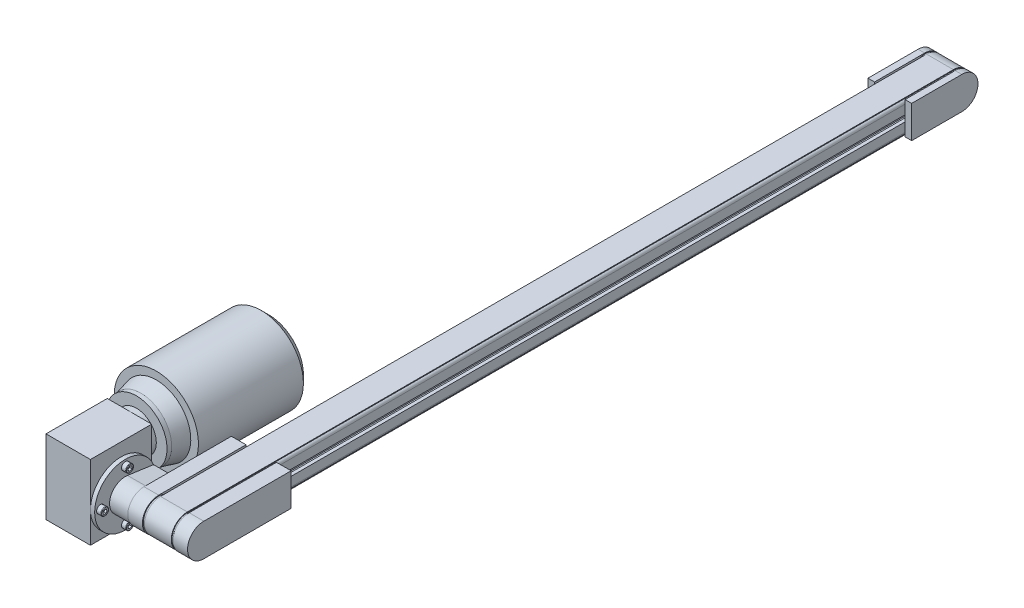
ISO-10303-21;
HEADER;
FILE_DESCRIPTION(('STEP AP214'),'2;1');
FILE_NAME('part.step','',(''),(''),'','','');
FILE_SCHEMA(('AUTOMOTIVE_DESIGN { 1 0 10303 214 1 1 1 1 }'));
ENDSEC;
DATA;
#1=APPLICATION_CONTEXT('core data for automotive mechanical design processes');
#2=APPLICATION_PROTOCOL_DEFINITION('international standard','automotive_design',2000,#1);
#3=PRODUCT_CONTEXT('',#1,'mechanical');
#4=PRODUCT('Part','Part','',(#3));
#5=PRODUCT_RELATED_PRODUCT_CATEGORY('part','',(#4));
#6=PRODUCT_DEFINITION_FORMATION('','',#4);
#7=PRODUCT_DEFINITION_CONTEXT('part definition',#1,'design');
#8=PRODUCT_DEFINITION('design','',#6,#7);
#9=PRODUCT_DEFINITION_SHAPE('','',#8);
#10=(LENGTH_UNIT() NAMED_UNIT(*) SI_UNIT(.MILLI.,.METRE.));
#11=(NAMED_UNIT(*) PLANE_ANGLE_UNIT() SI_UNIT($,.RADIAN.));
#12=(NAMED_UNIT(*) SI_UNIT($,.STERADIAN.) SOLID_ANGLE_UNIT());
#13=UNCERTAINTY_MEASURE_WITH_UNIT(LENGTH_MEASURE(1.E-05),#10,'distance_accuracy_value','');
#14=(GEOMETRIC_REPRESENTATION_CONTEXT(3) GLOBAL_UNCERTAINTY_ASSIGNED_CONTEXT((#13)) GLOBAL_UNIT_ASSIGNED_CONTEXT((#10,
#11,#12)) REPRESENTATION_CONTEXT('',''));
#15=CARTESIAN_POINT('',(0.,0.,0.));
#16=DIRECTION('',(0.,0.,1.));
#17=DIRECTION('',(1.,0.,0.));
#18=AXIS2_PLACEMENT_3D('',#15,#16,#17);
#19=CARTESIAN_POINT('',(0.,0.,0.));
#20=DIRECTION('',(-1.,0.,0.));
#21=DIRECTION('',(0.,0.,-1.));
#22=AXIS2_PLACEMENT_3D('',#19,#20,#21);
#23=CYLINDRICAL_SURFACE('',#22,20.05);
#24=CARTESIAN_POINT('',(19.9,0.,0.));
#25=DIRECTION('',(-1.,0.,0.));
#26=DIRECTION('',(0.,0.,-1.));
#27=AXIS2_PLACEMENT_3D('',#24,#25,#26);
#28=CIRCLE('',#27,20.05);
#29=CARTESIAN_POINT('',(19.9,0.,20.05));
#30=VERTEX_POINT('',#29);
#31=EDGE_CURVE('E1339',#30,#30,#28,.T.);
#32=ORIENTED_EDGE('',*,*,#31,.T.);
#33=EDGE_LOOP('',(#32));
#34=FACE_BOUND('',#33,.T.);
#35=CARTESIAN_POINT('',(-19.9,0.,0.));
#36=DIRECTION('',(1.,0.,0.));
#37=DIRECTION('',(0.,0.,-1.));
#38=AXIS2_PLACEMENT_3D('',#35,#36,#37);
#39=CIRCLE('',#38,20.05);
#40=CARTESIAN_POINT('',(-19.9,0.,20.05));
#41=VERTEX_POINT('',#40);
#42=EDGE_CURVE('E1314',#41,#41,#39,.T.);
#43=ORIENTED_EDGE('',*,*,#42,.T.);
#44=EDGE_LOOP('',(#43));
#45=FACE_BOUND('',#44,.T.);
#46=DIRECTION('',(-1.,0.,0.));
#47=VECTOR('',#46,1.);
#48=CARTESIAN_POINT('',(0.,20.,1.41509716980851));
#49=LINE('',#48,#47);
#50=CARTESIAN_POINT('',(17.5,20.,1.41509716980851));
#51=VERTEX_POINT('',#50);
#52=CARTESIAN_POINT('',(-17.5,20.,1.41509716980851));
#53=VERTEX_POINT('',#52);
#54=EDGE_CURVE('E1174',#51,#53,#49,.T.);
#55=ORIENTED_EDGE('',*,*,#54,.T.);
#56=CARTESIAN_POINT('',(-17.5,0.,0.));
#57=DIRECTION('',(-1.,0.,0.));
#58=DIRECTION('',(0.,0.,-1.));
#59=AXIS2_PLACEMENT_3D('',#56,#57,#58);
#60=CIRCLE('',#59,20.05);
#61=CARTESIAN_POINT('',(-17.5,-20.,1.41509716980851));
#62=VERTEX_POINT('',#61);
#63=EDGE_CURVE('E783',#53,#62,#60,.T.);
#64=ORIENTED_EDGE('',*,*,#63,.T.);
#65=DIRECTION('',(1.,0.,0.));
#66=VECTOR('',#65,1.);
#67=CARTESIAN_POINT('',(0.,-20.,1.41509716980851));
#68=LINE('',#67,#66);
#69=CARTESIAN_POINT('',(17.5,-20.,1.41509716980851));
#70=VERTEX_POINT('',#69);
#71=EDGE_CURVE('E1193',#62,#70,#68,.T.);
#72=ORIENTED_EDGE('',*,*,#71,.T.);
#73=CARTESIAN_POINT('',(17.5,0.,0.));
#74=DIRECTION('',(1.,0.,0.));
#75=DIRECTION('',(0.,0.,-1.));
#76=AXIS2_PLACEMENT_3D('',#73,#74,#75);
#77=CIRCLE('',#76,20.05);
#78=EDGE_CURVE('E1688',#70,#51,#77,.T.);
#79=ORIENTED_EDGE('',*,*,#78,.T.);
#80=EDGE_LOOP('',(#55,#64,#72,#79));
#81=FACE_BOUND('',#80,.T.);
#82=ADVANCED_FACE('F16',(#34,#45,#81),#23,.T.);
#83=CARTESIAN_POINT('',(0.,0.,25.));
#84=DIRECTION('',(0.,0.,1.));
#85=DIRECTION('',(1.,0.,0.));
#86=AXIS2_PLACEMENT_3D('',#83,#84,#85);
#87=PLANE('',#86);
#88=DIRECTION('',(0.,1.,0.));
#89=VECTOR('',#88,1.);
#90=CARTESIAN_POINT('',(-19.9,0.,25.));
#91=LINE('',#90,#89);
#92=CARTESIAN_POINT('',(-19.9,-16.8888194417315,25.));
#93=VERTEX_POINT('',#92);
#94=CARTESIAN_POINT('',(-19.9,-4.,25.));
#95=VERTEX_POINT('',#94);
#96=EDGE_CURVE('E1043',#93,#95,#91,.T.);
#97=ORIENTED_EDGE('',*,*,#96,.T.);
#98=DIRECTION('',(1.,0.,0.));
#99=VECTOR('',#98,1.);
#100=CARTESIAN_POINT('',(-20.,-4.,25.));
#101=LINE('',#100,#99);
#102=CARTESIAN_POINT('',(-15.5,-4.,25.));
#103=VERTEX_POINT('',#102);
#104=EDGE_CURVE('E904',#95,#103,#101,.T.);
#105=ORIENTED_EDGE('',*,*,#104,.T.);
#106=DIRECTION('',(0.,-1.,0.));
#107=VECTOR('',#106,1.);
#108=CARTESIAN_POINT('',(-15.5,-4.,25.));
#109=LINE('',#108,#107);
#110=CARTESIAN_POINT('',(-15.5,-10.,25.));
#111=VERTEX_POINT('',#110);
#112=EDGE_CURVE('E1026',#103,#111,#109,.T.);
#113=ORIENTED_EDGE('',*,*,#112,.T.);
#114=DIRECTION('',(1.,0.,0.));
#115=VECTOR('',#114,1.);
#116=CARTESIAN_POINT('',(-15.5,-10.,25.));
#117=LINE('',#116,#115);
#118=CARTESIAN_POINT('',(-7.75,-10.,25.));
#119=VERTEX_POINT('',#118);
#120=EDGE_CURVE('E1327',#111,#119,#117,.T.);
#121=ORIENTED_EDGE('',*,*,#120,.T.);
#122=DIRECTION('',(0.,-1.,0.));
#123=VECTOR('',#122,1.);
#124=CARTESIAN_POINT('',(-7.75,10.,25.));
#125=LINE('',#124,#123);
#126=CARTESIAN_POINT('',(-7.75,10.,25.));
#127=VERTEX_POINT('',#126);
#128=EDGE_CURVE('E954',#127,#119,#125,.T.);
#129=ORIENTED_EDGE('',*,*,#128,.F.);
#130=DIRECTION('',(1.,0.,0.));
#131=VECTOR('',#130,1.);
#132=CARTESIAN_POINT('',(-15.5,10.,25.));
#133=LINE('',#132,#131);
#134=CARTESIAN_POINT('',(-15.5,10.,25.));
#135=VERTEX_POINT('',#134);
#136=EDGE_CURVE('E818',#135,#127,#133,.T.);
#137=ORIENTED_EDGE('',*,*,#136,.F.);
#138=DIRECTION('',(0.,1.,0.));
#139=VECTOR('',#138,1.);
#140=CARTESIAN_POINT('',(-15.5,4.,25.));
#141=LINE('',#140,#139);
#142=CARTESIAN_POINT('',(-15.5,4.,25.));
#143=VERTEX_POINT('',#142);
#144=EDGE_CURVE('E817',#143,#135,#141,.T.);
#145=ORIENTED_EDGE('',*,*,#144,.F.);
#146=DIRECTION('',(1.,0.,0.));
#147=VECTOR('',#146,1.);
#148=CARTESIAN_POINT('',(-20.,4.,25.));
#149=LINE('',#148,#147);
#150=CARTESIAN_POINT('',(-19.9,4.,25.));
#151=VERTEX_POINT('',#150);
#152=EDGE_CURVE('E961',#151,#143,#149,.T.);
#153=ORIENTED_EDGE('',*,*,#152,.F.);
#154=DIRECTION('',(0.,1.,0.));
#155=VECTOR('',#154,1.);
#156=CARTESIAN_POINT('',(-19.9,0.,25.));
#157=LINE('',#156,#155);
#158=CARTESIAN_POINT('',(-19.9,16.8888194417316,25.));
#159=VERTEX_POINT('',#158);
#160=EDGE_CURVE('E1315',#151,#159,#157,.T.);
#161=ORIENTED_EDGE('',*,*,#160,.T.);
#162=CARTESIAN_POINT('',(-16.,16.,25.));
#163=DIRECTION('',(0.,0.,1.));
#164=DIRECTION('',(1.,0.,0.));
#165=AXIS2_PLACEMENT_3D('',#162,#163,#164);
#166=CIRCLE('',#165,4.);
#167=CARTESIAN_POINT('',(-16.,20.,25.));
#168=VERTEX_POINT('',#167);
#169=EDGE_CURVE('E892',#168,#159,#166,.T.);
#170=ORIENTED_EDGE('',*,*,#169,.F.);
#171=DIRECTION('',(1.,0.,0.));
#172=VECTOR('',#171,1.);
#173=CARTESIAN_POINT('',(0.,20.,25.));
#174=LINE('',#173,#172);
#175=CARTESIAN_POINT('',(16.,20.,25.));
#176=VERTEX_POINT('',#175);
#177=EDGE_CURVE('E1060',#168,#176,#174,.T.);
#178=ORIENTED_EDGE('',*,*,#177,.T.);
#179=CARTESIAN_POINT('',(16.,16.,25.));
#180=DIRECTION('',(0.,0.,1.));
#181=DIRECTION('',(1.,0.,0.));
#182=AXIS2_PLACEMENT_3D('',#179,#180,#181);
#183=CIRCLE('',#182,4.);
#184=CARTESIAN_POINT('',(19.9,16.8888194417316,25.));
#185=VERTEX_POINT('',#184);
#186=EDGE_CURVE('E771',#185,#176,#183,.T.);
#187=ORIENTED_EDGE('',*,*,#186,.F.);
#188=DIRECTION('',(0.,-1.,0.));
#189=VECTOR('',#188,1.);
#190=CARTESIAN_POINT('',(19.9,0.,25.));
#191=LINE('',#190,#189);
#192=CARTESIAN_POINT('',(19.9,4.,25.));
#193=VERTEX_POINT('',#192);
#194=EDGE_CURVE('E772',#185,#193,#191,.T.);
#195=ORIENTED_EDGE('',*,*,#194,.T.);
#196=DIRECTION('',(-1.,0.,0.));
#197=VECTOR('',#196,1.);
#198=CARTESIAN_POINT('',(20.,4.,25.));
#199=LINE('',#198,#197);
#200=CARTESIAN_POINT('',(15.5,4.,25.));
#201=VERTEX_POINT('',#200);
#202=EDGE_CURVE('E1549',#193,#201,#199,.T.);
#203=ORIENTED_EDGE('',*,*,#202,.T.);
#204=DIRECTION('',(0.,1.,0.));
#205=VECTOR('',#204,1.);
#206=CARTESIAN_POINT('',(15.5,4.,25.));
#207=LINE('',#206,#205);
#208=CARTESIAN_POINT('',(15.5,10.,25.));
#209=VERTEX_POINT('',#208);
#210=EDGE_CURVE('E1230',#201,#209,#207,.T.);
#211=ORIENTED_EDGE('',*,*,#210,.T.);
#212=DIRECTION('',(-1.,0.,0.));
#213=VECTOR('',#212,1.);
#214=CARTESIAN_POINT('',(15.5,10.,25.));
#215=LINE('',#214,#213);
#216=CARTESIAN_POINT('',(7.75,10.,25.));
#217=VERTEX_POINT('',#216);
#218=EDGE_CURVE('E1154',#209,#217,#215,.T.);
#219=ORIENTED_EDGE('',*,*,#218,.T.);
#220=DIRECTION('',(0.,1.,0.));
#221=VECTOR('',#220,1.);
#222=CARTESIAN_POINT('',(7.75,-10.,25.));
#223=LINE('',#222,#221);
#224=CARTESIAN_POINT('',(7.75,-10.,25.));
#225=VERTEX_POINT('',#224);
#226=EDGE_CURVE('E1138',#225,#217,#223,.T.);
#227=ORIENTED_EDGE('',*,*,#226,.F.);
#228=DIRECTION('',(-1.,0.,0.));
#229=VECTOR('',#228,1.);
#230=CARTESIAN_POINT('',(15.5,-10.,25.));
#231=LINE('',#230,#229);
#232=CARTESIAN_POINT('',(15.5,-10.,25.));
#233=VERTEX_POINT('',#232);
#234=EDGE_CURVE('E1032',#233,#225,#231,.T.);
#235=ORIENTED_EDGE('',*,*,#234,.F.);
#236=DIRECTION('',(0.,-1.,0.));
#237=VECTOR('',#236,1.);
#238=CARTESIAN_POINT('',(15.5,-4.,25.));
#239=LINE('',#238,#237);
#240=CARTESIAN_POINT('',(15.5,-4.,25.));
#241=VERTEX_POINT('',#240);
#242=EDGE_CURVE('E11',#241,#233,#239,.T.);
#243=ORIENTED_EDGE('',*,*,#242,.F.);
#244=DIRECTION('',(-1.,0.,0.));
#245=VECTOR('',#244,1.);
#246=CARTESIAN_POINT('',(20.,-4.,25.));
#247=LINE('',#246,#245);
#248=CARTESIAN_POINT('',(19.9,-4.,25.));
#249=VERTEX_POINT('',#248);
#250=EDGE_CURVE('E1275',#249,#241,#247,.T.);
#251=ORIENTED_EDGE('',*,*,#250,.F.);
#252=DIRECTION('',(0.,-1.,0.));
#253=VECTOR('',#252,1.);
#254=CARTESIAN_POINT('',(19.9,0.,25.));
#255=LINE('',#254,#253);
#256=CARTESIAN_POINT('',(19.9,-16.8888194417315,25.));
#257=VERTEX_POINT('',#256);
#258=EDGE_CURVE('E1461',#249,#257,#255,.T.);
#259=ORIENTED_EDGE('',*,*,#258,.T.);
#260=CARTESIAN_POINT('',(16.,-16.,25.));
#261=DIRECTION('',(0.,0.,1.));
#262=DIRECTION('',(1.,0.,0.));
#263=AXIS2_PLACEMENT_3D('',#260,#261,#262);
#264=CIRCLE('',#263,4.);
#265=CARTESIAN_POINT('',(16.,-20.,25.));
#266=VERTEX_POINT('',#265);
#267=EDGE_CURVE('E793',#266,#257,#264,.T.);
#268=ORIENTED_EDGE('',*,*,#267,.F.);
#269=DIRECTION('',(1.,0.,0.));
#270=VECTOR('',#269,1.);
#271=CARTESIAN_POINT('',(0.,-20.,25.));
#272=LINE('',#271,#270);
#273=CARTESIAN_POINT('',(-16.,-20.,25.));
#274=VERTEX_POINT('',#273);
#275=EDGE_CURVE('E1696',#274,#266,#272,.T.);
#276=ORIENTED_EDGE('',*,*,#275,.F.);
#277=CARTESIAN_POINT('',(-16.,-16.,25.));
#278=DIRECTION('',(0.,0.,1.));
#279=DIRECTION('',(1.,0.,0.));
#280=AXIS2_PLACEMENT_3D('',#277,#278,#279);
#281=CIRCLE('',#280,4.);
#282=EDGE_CURVE('E1001',#93,#274,#281,.T.);
#283=ORIENTED_EDGE('',*,*,#282,.F.);
#284=EDGE_LOOP('',(#97,#105,#113,#121,#129,#137,#145,#153,#161,#170,#178,#187,#195,#203,#211,
#219,#227,#235,#243,#251,#259,#268,#276,#283));
#285=FACE_BOUND('',#284,.T.);
#286=ADVANCED_FACE('F2007',(#285),#87,.F.);
#287=CARTESIAN_POINT('',(0.,0.,975.));
#288=DIRECTION('',(0.,0.,1.));
#289=DIRECTION('',(1.,0.,0.));
#290=AXIS2_PLACEMENT_3D('',#287,#288,#289);
#291=PLANE('',#290);
#292=DIRECTION('',(0.,-1.,0.));
#293=VECTOR('',#292,1.);
#294=CARTESIAN_POINT('',(-19.9,0.,975.));
#295=LINE('',#294,#293);
#296=CARTESIAN_POINT('',(-19.9,-4.,975.));
#297=VERTEX_POINT('',#296);
#298=CARTESIAN_POINT('',(-19.9,-16.8888194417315,975.));
#299=VERTEX_POINT('',#298);
#300=EDGE_CURVE('E1866',#297,#299,#295,.T.);
#301=ORIENTED_EDGE('',*,*,#300,.T.);
#302=CARTESIAN_POINT('',(-16.,-16.,975.));
#303=DIRECTION('',(0.,0.,-1.));
#304=DIRECTION('',(1.,0.,0.));
#305=AXIS2_PLACEMENT_3D('',#302,#303,#304);
#306=CIRCLE('',#305,4.);
#307=CARTESIAN_POINT('',(-16.,-20.,975.));
#308=VERTEX_POINT('',#307);
#309=EDGE_CURVE('E868',#308,#299,#306,.T.);
#310=ORIENTED_EDGE('',*,*,#309,.F.);
#311=DIRECTION('',(-1.,0.,0.));
#312=VECTOR('',#311,1.);
#313=CARTESIAN_POINT('',(0.,-20.,975.));
#314=LINE('',#313,#312);
#315=CARTESIAN_POINT('',(16.,-20.,975.));
#316=VERTEX_POINT('',#315);
#317=EDGE_CURVE('E1172',#316,#308,#314,.T.);
#318=ORIENTED_EDGE('',*,*,#317,.F.);
#319=CARTESIAN_POINT('',(16.,-16.,975.));
#320=DIRECTION('',(0.,0.,-1.));
#321=DIRECTION('',(1.,0.,0.));
#322=AXIS2_PLACEMENT_3D('',#319,#320,#321);
#323=CIRCLE('',#322,4.);
#324=CARTESIAN_POINT('',(19.9,-16.8888194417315,975.));
#325=VERTEX_POINT('',#324);
#326=EDGE_CURVE('E1615',#325,#316,#323,.T.);
#327=ORIENTED_EDGE('',*,*,#326,.F.);
#328=DIRECTION('',(0.,1.,0.));
#329=VECTOR('',#328,1.);
#330=CARTESIAN_POINT('',(19.9,0.,975.));
#331=LINE('',#330,#329);
#332=CARTESIAN_POINT('',(19.9,-4.,975.));
#333=VERTEX_POINT('',#332);
#334=EDGE_CURVE('E1306',#325,#333,#331,.T.);
#335=ORIENTED_EDGE('',*,*,#334,.T.);
#336=DIRECTION('',(1.,0.,0.));
#337=VECTOR('',#336,1.);
#338=CARTESIAN_POINT('',(20.,-4.,975.));
#339=LINE('',#338,#337);
#340=CARTESIAN_POINT('',(15.5,-4.,975.));
#341=VERTEX_POINT('',#340);
#342=EDGE_CURVE('E1404',#341,#333,#339,.T.);
#343=ORIENTED_EDGE('',*,*,#342,.F.);
#344=DIRECTION('',(0.,1.,0.));
#345=VECTOR('',#344,1.);
#346=CARTESIAN_POINT('',(15.5,-4.,975.));
#347=LINE('',#346,#345);
#348=CARTESIAN_POINT('',(15.5,-10.,975.));
#349=VERTEX_POINT('',#348);
#350=EDGE_CURVE('E27',#349,#341,#347,.T.);
#351=ORIENTED_EDGE('',*,*,#350,.F.);
#352=DIRECTION('',(1.,0.,0.));
#353=VECTOR('',#352,1.);
#354=CARTESIAN_POINT('',(15.5,-10.,975.));
#355=LINE('',#354,#353);
#356=CARTESIAN_POINT('',(7.75,-10.,975.));
#357=VERTEX_POINT('',#356);
#358=EDGE_CURVE('E1358',#357,#349,#355,.T.);
#359=ORIENTED_EDGE('',*,*,#358,.F.);
#360=DIRECTION('',(0.,-1.,0.));
#361=VECTOR('',#360,1.);
#362=CARTESIAN_POINT('',(7.75,10.,975.));
#363=LINE('',#362,#361);
#364=CARTESIAN_POINT('',(7.75,10.,975.));
#365=VERTEX_POINT('',#364);
#366=EDGE_CURVE('E1139',#365,#357,#363,.T.);
#367=ORIENTED_EDGE('',*,*,#366,.F.);
#368=DIRECTION('',(-1.,0.,0.));
#369=VECTOR('',#368,1.);
#370=CARTESIAN_POINT('',(15.5,10.,975.));
#371=LINE('',#370,#369);
#372=CARTESIAN_POINT('',(15.5,10.,975.));
#373=VERTEX_POINT('',#372);
#374=EDGE_CURVE('E1155',#373,#365,#371,.T.);
#375=ORIENTED_EDGE('',*,*,#374,.F.);
#376=DIRECTION('',(0.,1.,0.));
#377=VECTOR('',#376,1.);
#378=CARTESIAN_POINT('',(15.5,4.,975.));
#379=LINE('',#378,#377);
#380=CARTESIAN_POINT('',(15.5,4.,975.));
#381=VERTEX_POINT('',#380);
#382=EDGE_CURVE('E1527',#381,#373,#379,.T.);
#383=ORIENTED_EDGE('',*,*,#382,.F.);
#384=DIRECTION('',(-1.,0.,0.));
#385=VECTOR('',#384,1.);
#386=CARTESIAN_POINT('',(20.,4.,975.));
#387=LINE('',#386,#385);
#388=CARTESIAN_POINT('',(19.9,4.,975.));
#389=VERTEX_POINT('',#388);
#390=EDGE_CURVE('E827',#389,#381,#387,.T.);
#391=ORIENTED_EDGE('',*,*,#390,.F.);
#392=DIRECTION('',(0.,1.,0.));
#393=VECTOR('',#392,1.);
#394=CARTESIAN_POINT('',(19.9,0.,975.));
#395=LINE('',#394,#393);
#396=CARTESIAN_POINT('',(19.9,16.8888194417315,975.));
#397=VERTEX_POINT('',#396);
#398=EDGE_CURVE('E1250',#389,#397,#395,.T.);
#399=ORIENTED_EDGE('',*,*,#398,.T.);
#400=CARTESIAN_POINT('',(16.,16.,975.));
#401=DIRECTION('',(0.,0.,-1.));
#402=DIRECTION('',(1.,0.,0.));
#403=AXIS2_PLACEMENT_3D('',#400,#401,#402);
#404=CIRCLE('',#403,4.);
#405=CARTESIAN_POINT('',(16.,20.,975.));
#406=VERTEX_POINT('',#405);
#407=EDGE_CURVE('E766',#406,#397,#404,.T.);
#408=ORIENTED_EDGE('',*,*,#407,.F.);
#409=DIRECTION('',(1.,0.,0.));
#410=VECTOR('',#409,1.);
#411=CARTESIAN_POINT('',(0.,20.,975.));
#412=LINE('',#411,#410);
#413=CARTESIAN_POINT('',(-16.,20.,975.));
#414=VERTEX_POINT('',#413);
#415=EDGE_CURVE('E1159',#414,#406,#412,.T.);
#416=ORIENTED_EDGE('',*,*,#415,.F.);
#417=CARTESIAN_POINT('',(-16.,16.,975.));
#418=DIRECTION('',(0.,0.,-1.));
#419=DIRECTION('',(1.,0.,0.));
#420=AXIS2_PLACEMENT_3D('',#417,#418,#419);
#421=CIRCLE('',#420,4.);
#422=CARTESIAN_POINT('',(-19.9,16.8888194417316,975.));
#423=VERTEX_POINT('',#422);
#424=EDGE_CURVE('E894',#423,#414,#421,.T.);
#425=ORIENTED_EDGE('',*,*,#424,.F.);
#426=DIRECTION('',(0.,-1.,0.));
#427=VECTOR('',#426,1.);
#428=CARTESIAN_POINT('',(-19.9,0.,975.));
#429=LINE('',#428,#427);
#430=CARTESIAN_POINT('',(-19.9,4.,975.));
#431=VERTEX_POINT('',#430);
#432=EDGE_CURVE('E1095',#423,#431,#429,.T.);
#433=ORIENTED_EDGE('',*,*,#432,.T.);
#434=DIRECTION('',(-1.,0.,0.));
#435=VECTOR('',#434,1.);
#436=CARTESIAN_POINT('',(-20.,4.,975.));
#437=LINE('',#436,#435);
#438=CARTESIAN_POINT('',(-15.5,4.,975.));
#439=VERTEX_POINT('',#438);
#440=EDGE_CURVE('E960',#439,#431,#437,.T.);
#441=ORIENTED_EDGE('',*,*,#440,.F.);
#442=DIRECTION('',(0.,-1.,0.));
#443=VECTOR('',#442,1.);
#444=CARTESIAN_POINT('',(-15.5,4.,975.));
#445=LINE('',#444,#443);
#446=CARTESIAN_POINT('',(-15.5,10.,975.));
#447=VERTEX_POINT('',#446);
#448=EDGE_CURVE('E814',#447,#439,#445,.T.);
#449=ORIENTED_EDGE('',*,*,#448,.F.);
#450=DIRECTION('',(-1.,0.,0.));
#451=VECTOR('',#450,1.);
#452=CARTESIAN_POINT('',(-15.5,10.,975.));
#453=LINE('',#452,#451);
#454=CARTESIAN_POINT('',(-7.75,10.,975.));
#455=VERTEX_POINT('',#454);
#456=EDGE_CURVE('E966',#455,#447,#453,.T.);
#457=ORIENTED_EDGE('',*,*,#456,.F.);
#458=DIRECTION('',(0.,1.,0.));
#459=VECTOR('',#458,1.);
#460=CARTESIAN_POINT('',(-7.75,-10.,975.));
#461=LINE('',#460,#459);
#462=CARTESIAN_POINT('',(-7.75,-10.,975.));
#463=VERTEX_POINT('',#462);
#464=EDGE_CURVE('E955',#463,#455,#461,.T.);
#465=ORIENTED_EDGE('',*,*,#464,.F.);
#466=DIRECTION('',(1.,0.,0.));
#467=VECTOR('',#466,1.);
#468=CARTESIAN_POINT('',(-15.5,-10.,975.));
#469=LINE('',#468,#467);
#470=CARTESIAN_POINT('',(-15.5,-10.,975.));
#471=VERTEX_POINT('',#470);
#472=EDGE_CURVE('E1030',#471,#463,#469,.T.);
#473=ORIENTED_EDGE('',*,*,#472,.F.);
#474=DIRECTION('',(0.,-1.,0.));
#475=VECTOR('',#474,1.);
#476=CARTESIAN_POINT('',(-15.5,-4.,975.));
#477=LINE('',#476,#475);
#478=CARTESIAN_POINT('',(-15.5,-4.,975.));
#479=VERTEX_POINT('',#478);
#480=EDGE_CURVE('E788',#479,#471,#477,.T.);
#481=ORIENTED_EDGE('',*,*,#480,.F.);
#482=DIRECTION('',(1.,0.,0.));
#483=VECTOR('',#482,1.);
#484=CARTESIAN_POINT('',(-20.,-4.,975.));
#485=LINE('',#484,#483);
#486=EDGE_CURVE('E1323',#297,#479,#485,.T.);
#487=ORIENTED_EDGE('',*,*,#486,.F.);
#488=EDGE_LOOP('',(#301,#310,#318,#327,#335,#343,#351,#359,#367,#375,#383,#391,#399,#408,#416,
#425,#433,#441,#449,#457,#465,#473,#481,#487));
#489=FACE_BOUND('',#488,.T.);
#490=ADVANCED_FACE('F1999',(#489),#291,.T.);
#491=CARTESIAN_POINT('',(15.5,-7.,25.));
#492=DIRECTION('',(-1.,0.,0.));
#493=DIRECTION('',(0.,-1.,0.));
#494=AXIS2_PLACEMENT_3D('',#491,#492,#493);
#495=PLANE('',#494);
#496=ORIENTED_EDGE('',*,*,#350,.T.);
#497=DIRECTION('',(0.,0.,1.));
#498=VECTOR('',#497,1.);
#499=CARTESIAN_POINT('',(15.5,-4.,25.));
#500=LINE('',#499,#498);
#501=EDGE_CURVE('E1279',#241,#341,#500,.T.);
#502=ORIENTED_EDGE('',*,*,#501,.F.);
#503=ORIENTED_EDGE('',*,*,#242,.T.);
#504=DIRECTION('',(0.,0.,1.));
#505=VECTOR('',#504,1.);
#506=CARTESIAN_POINT('',(15.5,-10.,25.));
#507=LINE('',#506,#505);
#508=EDGE_CURVE('E1418',#233,#349,#507,.T.);
#509=ORIENTED_EDGE('',*,*,#508,.T.);
#510=EDGE_LOOP('',(#496,#502,#503,#509));
#511=FACE_BOUND('',#510,.T.);
#512=ADVANCED_FACE('F2024',(#511),#495,.T.);
#513=CARTESIAN_POINT('',(11.625,-10.,25.));
#514=DIRECTION('',(0.,1.,0.));
#515=DIRECTION('',(-1.,0.,0.));
#516=AXIS2_PLACEMENT_3D('',#513,#514,#515);
#517=PLANE('',#516);
#518=ORIENTED_EDGE('',*,*,#358,.T.);
#519=ORIENTED_EDGE('',*,*,#508,.F.);
#520=ORIENTED_EDGE('',*,*,#234,.T.);
#521=DIRECTION('',(0.,0.,1.));
#522=VECTOR('',#521,1.);
#523=CARTESIAN_POINT('',(7.75,-10.,25.));
#524=LINE('',#523,#522);
#525=EDGE_CURVE('E1134',#225,#357,#524,.T.);
#526=ORIENTED_EDGE('',*,*,#525,.T.);
#527=EDGE_LOOP('',(#518,#519,#520,#526));
#528=FACE_BOUND('',#527,.T.);
#529=ADVANCED_FACE('F2238',(#528),#517,.T.);
#530=CARTESIAN_POINT('',(7.75,-5.,25.));
#531=DIRECTION('',(1.,0.,0.));
#532=DIRECTION('',(0.,1.,0.));
#533=AXIS2_PLACEMENT_3D('',#530,#531,#532);
#534=PLANE('',#533);
#535=ORIENTED_EDGE('',*,*,#366,.T.);
#536=ORIENTED_EDGE('',*,*,#525,.F.);
#537=ORIENTED_EDGE('',*,*,#226,.T.);
#538=DIRECTION('',(0.,0.,1.));
#539=VECTOR('',#538,1.);
#540=CARTESIAN_POINT('',(7.75,10.,25.));
#541=LINE('',#540,#539);
#542=EDGE_CURVE('E1150',#217,#365,#541,.T.);
#543=ORIENTED_EDGE('',*,*,#542,.T.);
#544=EDGE_LOOP('',(#535,#536,#537,#543));
#545=FACE_BOUND('',#544,.T.);
#546=ADVANCED_FACE('F2241',(#545),#534,.T.);
#547=CARTESIAN_POINT('',(11.625,10.,25.));
#548=DIRECTION('',(0.,-1.,0.));
#549=DIRECTION('',(1.,0.,0.));
#550=AXIS2_PLACEMENT_3D('',#547,#548,#549);
#551=PLANE('',#550);
#552=ORIENTED_EDGE('',*,*,#374,.T.);
#553=ORIENTED_EDGE('',*,*,#542,.F.);
#554=ORIENTED_EDGE('',*,*,#218,.F.);
#555=DIRECTION('',(0.,0.,1.));
#556=VECTOR('',#555,1.);
#557=CARTESIAN_POINT('',(15.5,10.,25.));
#558=LINE('',#557,#556);
#559=EDGE_CURVE('E1234',#209,#373,#558,.T.);
#560=ORIENTED_EDGE('',*,*,#559,.T.);
#561=EDGE_LOOP('',(#552,#553,#554,#560));
#562=FACE_BOUND('',#561,.T.);
#563=ADVANCED_FACE('F2282',(#562),#551,.T.);
#564=CARTESIAN_POINT('',(15.5,7.,25.));
#565=DIRECTION('',(-1.,0.,0.));
#566=DIRECTION('',(0.,-1.,0.));
#567=AXIS2_PLACEMENT_3D('',#564,#565,#566);
#568=PLANE('',#567);
#569=ORIENTED_EDGE('',*,*,#382,.T.);
#570=ORIENTED_EDGE('',*,*,#559,.F.);
#571=ORIENTED_EDGE('',*,*,#210,.F.);
#572=DIRECTION('',(0.,0.,1.));
#573=VECTOR('',#572,1.);
#574=CARTESIAN_POINT('',(15.5,4.,25.));
#575=LINE('',#574,#573);
#576=EDGE_CURVE('E1545',#201,#381,#575,.T.);
#577=ORIENTED_EDGE('',*,*,#576,.T.);
#578=EDGE_LOOP('',(#569,#570,#571,#577));
#579=FACE_BOUND('',#578,.T.);
#580=ADVANCED_FACE('F2276',(#579),#568,.T.);
#581=CARTESIAN_POINT('',(-15.5,7.,25.));
#582=DIRECTION('',(1.,0.,0.));
#583=DIRECTION('',(0.,1.,0.));
#584=AXIS2_PLACEMENT_3D('',#581,#582,#583);
#585=PLANE('',#584);
#586=ORIENTED_EDGE('',*,*,#448,.T.);
#587=DIRECTION('',(0.,0.,1.));
#588=VECTOR('',#587,1.);
#589=CARTESIAN_POINT('',(-15.5,4.,25.));
#590=LINE('',#589,#588);
#591=EDGE_CURVE('E956',#143,#439,#590,.T.);
#592=ORIENTED_EDGE('',*,*,#591,.F.);
#593=ORIENTED_EDGE('',*,*,#144,.T.);
#594=DIRECTION('',(0.,0.,1.));
#595=VECTOR('',#594,1.);
#596=CARTESIAN_POINT('',(-15.5,10.,25.));
#597=LINE('',#596,#595);
#598=EDGE_CURVE('E962',#135,#447,#597,.T.);
#599=ORIENTED_EDGE('',*,*,#598,.T.);
#600=EDGE_LOOP('',(#586,#592,#593,#599));
#601=FACE_BOUND('',#600,.T.);
#602=ADVANCED_FACE('F2108',(#601),#585,.T.);
#603=CARTESIAN_POINT('',(-11.625,10.,25.));
#604=DIRECTION('',(0.,-1.,0.));
#605=DIRECTION('',(1.,0.,0.));
#606=AXIS2_PLACEMENT_3D('',#603,#604,#605);
#607=PLANE('',#606);
#608=ORIENTED_EDGE('',*,*,#456,.T.);
#609=ORIENTED_EDGE('',*,*,#598,.F.);
#610=ORIENTED_EDGE('',*,*,#136,.T.);
#611=DIRECTION('',(0.,0.,1.));
#612=VECTOR('',#611,1.);
#613=CARTESIAN_POINT('',(-7.75,10.,25.));
#614=LINE('',#613,#612);
#615=EDGE_CURVE('E950',#127,#455,#614,.T.);
#616=ORIENTED_EDGE('',*,*,#615,.T.);
#617=EDGE_LOOP('',(#608,#609,#610,#616));
#618=FACE_BOUND('',#617,.T.);
#619=ADVANCED_FACE('F2111',(#618),#607,.T.);
#620=CARTESIAN_POINT('',(-7.75,5.,25.));
#621=DIRECTION('',(-1.,0.,0.));
#622=DIRECTION('',(0.,-1.,0.));
#623=AXIS2_PLACEMENT_3D('',#620,#621,#622);
#624=PLANE('',#623);
#625=ORIENTED_EDGE('',*,*,#464,.T.);
#626=ORIENTED_EDGE('',*,*,#615,.F.);
#627=ORIENTED_EDGE('',*,*,#128,.T.);
#628=DIRECTION('',(0.,0.,1.));
#629=VECTOR('',#628,1.);
#630=CARTESIAN_POINT('',(-7.75,-10.,25.));
#631=LINE('',#630,#629);
#632=EDGE_CURVE('E1225',#119,#463,#631,.T.);
#633=ORIENTED_EDGE('',*,*,#632,.T.);
#634=EDGE_LOOP('',(#625,#626,#627,#633));
#635=FACE_BOUND('',#634,.T.);
#636=ADVANCED_FACE('F2116',(#635),#624,.T.);
#637=CARTESIAN_POINT('',(-11.625,-10.,25.));
#638=DIRECTION('',(0.,1.,0.));
#639=DIRECTION('',(-1.,0.,0.));
#640=AXIS2_PLACEMENT_3D('',#637,#638,#639);
#641=PLANE('',#640);
#642=ORIENTED_EDGE('',*,*,#472,.T.);
#643=ORIENTED_EDGE('',*,*,#632,.F.);
#644=ORIENTED_EDGE('',*,*,#120,.F.);
#645=DIRECTION('',(0.,0.,1.));
#646=VECTOR('',#645,1.);
#647=CARTESIAN_POINT('',(-15.5,-10.,25.));
#648=LINE('',#647,#646);
#649=EDGE_CURVE('E792',#111,#471,#648,.T.);
#650=ORIENTED_EDGE('',*,*,#649,.T.);
#651=EDGE_LOOP('',(#642,#643,#644,#650));
#652=FACE_BOUND('',#651,.T.);
#653=ADVANCED_FACE('F2121',(#652),#641,.T.);
#654=CARTESIAN_POINT('',(-15.5,-7.,25.));
#655=DIRECTION('',(1.,0.,0.));
#656=DIRECTION('',(0.,1.,0.));
#657=AXIS2_PLACEMENT_3D('',#654,#655,#656);
#658=PLANE('',#657);
#659=ORIENTED_EDGE('',*,*,#480,.T.);
#660=ORIENTED_EDGE('',*,*,#649,.F.);
#661=ORIENTED_EDGE('',*,*,#112,.F.);
#662=DIRECTION('',(0.,0.,1.));
#663=VECTOR('',#662,1.);
#664=CARTESIAN_POINT('',(-15.5,-4.,25.));
#665=LINE('',#664,#663);
#666=EDGE_CURVE('E911',#103,#479,#665,.T.);
#667=ORIENTED_EDGE('',*,*,#666,.T.);
#668=EDGE_LOOP('',(#659,#660,#661,#667));
#669=FACE_BOUND('',#668,.T.);
#670=ADVANCED_FACE('F2123',(#669),#658,.T.);
#671=CARTESIAN_POINT('',(16.,-16.,25.));
#672=DIRECTION('',(0.,0.,-1.));
#673=DIRECTION('',(1.,0.,0.));
#674=AXIS2_PLACEMENT_3D('',#671,#672,#673);
#675=CYLINDRICAL_SURFACE('',#674,4.);
#676=DIRECTION('',(0.,0.,1.));
#677=VECTOR('',#676,1.);
#678=CARTESIAN_POINT('',(19.9,-16.8888194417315,930.5));
#679=LINE('',#678,#677);
#680=CARTESIAN_POINT('',(19.9,-16.8888194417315,886.));
#681=VERTEX_POINT('',#680);
#682=EDGE_CURVE('E765',#681,#325,#679,.T.);
#683=ORIENTED_EDGE('',*,*,#682,.T.);
#684=ORIENTED_EDGE('',*,*,#326,.T.);
#685=DIRECTION('',(0.,0.,1.));
#686=VECTOR('',#685,1.);
#687=CARTESIAN_POINT('',(16.,-20.,25.));
#688=LINE('',#687,#686);
#689=EDGE_CURVE('E1168',#266,#316,#688,.T.);
#690=ORIENTED_EDGE('',*,*,#689,.F.);
#691=ORIENTED_EDGE('',*,*,#267,.T.);
#692=DIRECTION('',(0.,0.,1.));
#693=VECTOR('',#692,1.);
#694=CARTESIAN_POINT('',(19.9,-16.8888194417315,45.25));
#695=LINE('',#694,#693);
#696=CARTESIAN_POINT('',(19.9,-16.8888194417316,65.5));
#697=VERTEX_POINT('',#696);
#698=EDGE_CURVE('E1621',#257,#697,#695,.T.);
#699=ORIENTED_EDGE('',*,*,#698,.T.);
#700=CARTESIAN_POINT('',(16.,-16.,65.5));
#701=DIRECTION('',(0.,0.,1.));
#702=DIRECTION('',(1.,0.,0.));
#703=AXIS2_PLACEMENT_3D('',#700,#701,#702);
#704=CIRCLE('',#703,4.);
#705=CARTESIAN_POINT('',(20.,-16.,65.5));
#706=VERTEX_POINT('',#705);
#707=EDGE_CURVE('E828',#697,#706,#704,.T.);
#708=ORIENTED_EDGE('',*,*,#707,.T.);
#709=DIRECTION('',(0.,0.,1.));
#710=VECTOR('',#709,1.);
#711=CARTESIAN_POINT('',(20.,-16.,25.));
#712=LINE('',#711,#710);
#713=CARTESIAN_POINT('',(20.,-16.,886.));
#714=VERTEX_POINT('',#713);
#715=EDGE_CURVE('E1408',#706,#714,#712,.T.);
#716=ORIENTED_EDGE('',*,*,#715,.T.);
#717=CARTESIAN_POINT('',(16.,-16.,886.));
#718=DIRECTION('',(0.,0.,-1.));
#719=DIRECTION('',(1.,0.,0.));
#720=AXIS2_PLACEMENT_3D('',#717,#718,#719);
#721=CIRCLE('',#720,4.);
#722=EDGE_CURVE('E846',#714,#681,#721,.T.);
#723=ORIENTED_EDGE('',*,*,#722,.T.);
#724=EDGE_LOOP('',(#683,#684,#690,#691,#699,#708,#716,#723));
#725=FACE_BOUND('',#724,.T.);
#726=ADVANCED_FACE('F2011',(#725),#675,.T.);
#727=CARTESIAN_POINT('',(17.75,4.,25.));
#728=DIRECTION('',(0.,-1.,0.));
#729=DIRECTION('',(1.,0.,0.));
#730=AXIS2_PLACEMENT_3D('',#727,#728,#729);
#731=PLANE('',#730);
#732=DIRECTION('',(0.,0.,1.));
#733=VECTOR('',#732,1.);
#734=CARTESIAN_POINT('',(19.9,4.,487.257161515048));
#735=LINE('',#734,#733);
#736=CARTESIAN_POINT('',(19.9,4.,886.));
#737=VERTEX_POINT('',#736);
#738=EDGE_CURVE('E1245',#737,#389,#735,.T.);
#739=ORIENTED_EDGE('',*,*,#738,.T.);
#740=ORIENTED_EDGE('',*,*,#390,.T.);
#741=ORIENTED_EDGE('',*,*,#576,.F.);
#742=ORIENTED_EDGE('',*,*,#202,.F.);
#743=DIRECTION('',(0.,0.,1.));
#744=VECTOR('',#743,1.);
#745=CARTESIAN_POINT('',(19.9,4.,25.5519195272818));
#746=LINE('',#745,#744);
#747=CARTESIAN_POINT('',(19.9,4.,65.5));
#748=VERTEX_POINT('',#747);
#749=EDGE_CURVE('E777',#193,#748,#746,.T.);
#750=ORIENTED_EDGE('',*,*,#749,.T.);
#751=DIRECTION('',(1.,0.,0.));
#752=VECTOR('',#751,1.);
#753=CARTESIAN_POINT('',(18.825,4.,65.5));
#754=LINE('',#753,#752);
#755=CARTESIAN_POINT('',(20.,4.,65.5));
#756=VERTEX_POINT('',#755);
#757=EDGE_CURVE('E1439',#748,#756,#754,.T.);
#758=ORIENTED_EDGE('',*,*,#757,.T.);
#759=DIRECTION('',(0.,0.,1.));
#760=VECTOR('',#759,1.);
#761=CARTESIAN_POINT('',(20.,4.,25.));
#762=LINE('',#761,#760);
#763=CARTESIAN_POINT('',(20.,4.,886.));
#764=VERTEX_POINT('',#763);
#765=EDGE_CURVE('E770',#756,#764,#762,.T.);
#766=ORIENTED_EDGE('',*,*,#765,.T.);
#767=DIRECTION('',(-1.,0.,0.));
#768=VECTOR('',#767,1.);
#769=CARTESIAN_POINT('',(18.825,4.,886.));
#770=LINE('',#769,#768);
#771=EDGE_CURVE('E1608',#764,#737,#770,.T.);
#772=ORIENTED_EDGE('',*,*,#771,.T.);
#773=EDGE_LOOP('',(#739,#740,#741,#742,#750,#758,#766,#772));
#774=FACE_BOUND('',#773,.T.);
#775=ADVANCED_FACE('F2070',(#774),#731,.T.);
#776=CARTESIAN_POINT('',(28.5,0.,26.1038390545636));
#777=DIRECTION('',(1.,0.,0.));
#778=DIRECTION('',(0.,0.,-1.));
#779=AXIS2_PLACEMENT_3D('',#776,#777,#778);
#780=PLANE('',#779);
#781=DIRECTION('',(0.,0.,-1.));
#782=VECTOR('',#781,1.);
#783=CARTESIAN_POINT('',(28.5,21.1,0.));
#784=LINE('',#783,#782);
#785=CARTESIAN_POINT('',(28.5,21.1,65.5));
#786=VERTEX_POINT('',#785);
#787=CARTESIAN_POINT('',(28.5,21.1,0.));
#788=VERTEX_POINT('',#787);
#789=EDGE_CURVE('E1334',#786,#788,#784,.T.);
#790=ORIENTED_EDGE('',*,*,#789,.F.);
#791=DIRECTION('',(0.,1.,0.));
#792=VECTOR('',#791,1.);
#793=CARTESIAN_POINT('',(28.5,21.1,65.5));
#794=LINE('',#793,#792);
#795=CARTESIAN_POINT('',(28.5,-21.1,65.5));
#796=VERTEX_POINT('',#795);
#797=EDGE_CURVE('E824',#796,#786,#794,.T.);
#798=ORIENTED_EDGE('',*,*,#797,.F.);
#799=DIRECTION('',(0.,0.,1.));
#800=VECTOR('',#799,1.);
#801=CARTESIAN_POINT('',(28.5,-21.1,0.));
#802=LINE('',#801,#800);
#803=CARTESIAN_POINT('',(28.5,-21.1,0.));
#804=VERTEX_POINT('',#803);
#805=EDGE_CURVE('E1090',#804,#796,#802,.T.);
#806=ORIENTED_EDGE('',*,*,#805,.F.);
#807=CARTESIAN_POINT('',(28.5,0.,0.));
#808=DIRECTION('',(-1.,0.,0.));
#809=DIRECTION('',(0.,0.,-1.));
#810=AXIS2_PLACEMENT_3D('',#807,#808,#809);
#811=CIRCLE('',#810,21.1);
#812=EDGE_CURVE('E1538',#788,#804,#811,.T.);
#813=ORIENTED_EDGE('',*,*,#812,.F.);
#814=EDGE_LOOP('',(#790,#798,#806,#813));
#815=FACE_BOUND('',#814,.T.);
#816=ADVANCED_FACE('F2328',(#815),#780,.T.);
#817=CARTESIAN_POINT('',(19.9,0.,65.5));
#818=DIRECTION('',(0.,0.,1.));
#819=DIRECTION('',(0.,-1.,0.));
#820=AXIS2_PLACEMENT_3D('',#817,#818,#819);
#821=PLANE('',#820);
#822=ORIENTED_EDGE('',*,*,#757,.F.);
#823=DIRECTION('',(0.,-1.,0.));
#824=VECTOR('',#823,1.);
#825=CARTESIAN_POINT('',(19.9,21.1,65.5));
#826=LINE('',#825,#824);
#827=CARTESIAN_POINT('',(19.9,-4.,65.5));
#828=VERTEX_POINT('',#827);
#829=EDGE_CURVE('E1458',#748,#828,#826,.T.);
#830=ORIENTED_EDGE('',*,*,#829,.T.);
#831=DIRECTION('',(-1.,0.,0.));
#832=VECTOR('',#831,1.);
#833=CARTESIAN_POINT('',(18.825,-4.,65.5));
#834=LINE('',#833,#832);
#835=CARTESIAN_POINT('',(20.,-4.,65.5));
#836=VERTEX_POINT('',#835);
#837=EDGE_CURVE('E991',#836,#828,#834,.T.);
#838=ORIENTED_EDGE('',*,*,#837,.F.);
#839=DIRECTION('',(0.,1.,0.));
#840=VECTOR('',#839,1.);
#841=CARTESIAN_POINT('',(20.,-5.,65.5));
#842=LINE('',#841,#840);
#843=EDGE_CURVE('E1058',#706,#836,#842,.T.);
#844=ORIENTED_EDGE('',*,*,#843,.F.);
#845=ORIENTED_EDGE('',*,*,#707,.F.);
#846=DIRECTION('',(0.,-1.,0.));
#847=VECTOR('',#846,1.);
#848=CARTESIAN_POINT('',(19.9,21.1,65.5));
#849=LINE('',#848,#847);
#850=CARTESIAN_POINT('',(19.9,-21.1,65.5));
#851=VERTEX_POINT('',#850);
#852=EDGE_CURVE('E1493',#697,#851,#849,.T.);
#853=ORIENTED_EDGE('',*,*,#852,.T.);
#854=DIRECTION('',(1.,0.,0.));
#855=VECTOR('',#854,1.);
#856=CARTESIAN_POINT('',(19.9,-21.1,65.5));
#857=LINE('',#856,#855);
#858=EDGE_CURVE('E1094',#851,#796,#857,.T.);
#859=ORIENTED_EDGE('',*,*,#858,.T.);
#860=ORIENTED_EDGE('',*,*,#797,.T.);
#861=DIRECTION('',(1.,0.,0.));
#862=VECTOR('',#861,1.);
#863=CARTESIAN_POINT('',(19.9,21.1,65.5));
#864=LINE('',#863,#862);
#865=CARTESIAN_POINT('',(19.9,21.1,65.5));
#866=VERTEX_POINT('',#865);
#867=EDGE_CURVE('E1355',#866,#786,#864,.T.);
#868=ORIENTED_EDGE('',*,*,#867,.F.);
#869=DIRECTION('',(0.,-1.,0.));
#870=VECTOR('',#869,1.);
#871=CARTESIAN_POINT('',(19.9,21.1,65.5));
#872=LINE('',#871,#870);
#873=CARTESIAN_POINT('',(19.9,16.8888194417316,65.5));
#874=VERTEX_POINT('',#873);
#875=EDGE_CURVE('E776',#866,#874,#872,.T.);
#876=ORIENTED_EDGE('',*,*,#875,.T.);
#877=CARTESIAN_POINT('',(16.,16.,65.5));
#878=DIRECTION('',(0.,0.,1.));
#879=DIRECTION('',(1.,0.,0.));
#880=AXIS2_PLACEMENT_3D('',#877,#878,#879);
#881=CIRCLE('',#880,4.);
#882=CARTESIAN_POINT('',(20.,16.,65.5));
#883=VERTEX_POINT('',#882);
#884=EDGE_CURVE('E1713',#883,#874,#881,.T.);
#885=ORIENTED_EDGE('',*,*,#884,.F.);
#886=DIRECTION('',(0.,1.,0.));
#887=VECTOR('',#886,1.);
#888=CARTESIAN_POINT('',(20.,5.,65.5));
#889=LINE('',#888,#887);
#890=EDGE_CURVE('E810',#756,#883,#889,.T.);
#891=ORIENTED_EDGE('',*,*,#890,.F.);
#892=EDGE_LOOP('',(#822,#830,#838,#844,#845,#853,#859,#860,#868,#876,#885,#891));
#893=FACE_BOUND('',#892,.T.);
#894=ADVANCED_FACE('F2044',(#893),#821,.T.);
#895=CARTESIAN_POINT('',(19.9,-21.1,32.75));
#896=DIRECTION('',(0.,-1.,0.));
#897=DIRECTION('',(0.,0.,-1.));
#898=AXIS2_PLACEMENT_3D('',#895,#896,#897);
#899=PLANE('',#898);
#900=ORIENTED_EDGE('',*,*,#805,.T.);
#901=ORIENTED_EDGE('',*,*,#858,.F.);
#902=DIRECTION('',(0.,0.,1.));
#903=VECTOR('',#902,1.);
#904=CARTESIAN_POINT('',(19.9,-21.1,0.));
#905=LINE('',#904,#903);
#906=CARTESIAN_POINT('',(19.9,-21.1,0.));
#907=VERTEX_POINT('',#906);
#908=EDGE_CURVE('E1489',#907,#851,#905,.T.);
#909=ORIENTED_EDGE('',*,*,#908,.F.);
#910=DIRECTION('',(1.,0.,0.));
#911=VECTOR('',#910,1.);
#912=CARTESIAN_POINT('',(19.9,-21.1,0.));
#913=LINE('',#912,#911);
#914=EDGE_CURVE('E20',#907,#804,#913,.T.);
#915=ORIENTED_EDGE('',*,*,#914,.T.);
#916=EDGE_LOOP('',(#900,#901,#909,#915));
#917=FACE_BOUND('',#916,.T.);
#918=ADVANCED_FACE('F2327',(#917),#899,.T.);
#919=CARTESIAN_POINT('',(19.9,0.,0.));
#920=DIRECTION('',(-1.,0.,0.));
#921=DIRECTION('',(0.,0.,-1.));
#922=AXIS2_PLACEMENT_3D('',#919,#920,#921);
#923=CYLINDRICAL_SURFACE('',#922,21.1);
#924=ORIENTED_EDGE('',*,*,#812,.T.);
#925=ORIENTED_EDGE('',*,*,#914,.F.);
#926=CARTESIAN_POINT('',(19.9,0.,0.));
#927=DIRECTION('',(1.,0.,0.));
#928=DIRECTION('',(0.,0.,-1.));
#929=AXIS2_PLACEMENT_3D('',#926,#927,#928);
#930=CIRCLE('',#929,21.1);
#931=CARTESIAN_POINT('',(19.9,21.1,0.));
#932=VERTEX_POINT('',#931);
#933=EDGE_CURVE('E1184',#907,#932,#930,.T.);
#934=ORIENTED_EDGE('',*,*,#933,.T.);
#935=DIRECTION('',(1.,0.,0.));
#936=VECTOR('',#935,1.);
#937=CARTESIAN_POINT('',(19.9,21.1,0.));
#938=LINE('',#937,#936);
#939=EDGE_CURVE('E1338',#932,#788,#938,.T.);
#940=ORIENTED_EDGE('',*,*,#939,.T.);
#941=EDGE_LOOP('',(#924,#925,#934,#940));
#942=FACE_BOUND('',#941,.T.);
#943=ADVANCED_FACE('F2483',(#942),#923,.T.);
#944=CARTESIAN_POINT('',(19.9,21.1,32.75));
#945=DIRECTION('',(0.,1.,0.));
#946=DIRECTION('',(0.,0.,1.));
#947=AXIS2_PLACEMENT_3D('',#944,#945,#946);
#948=PLANE('',#947);
#949=ORIENTED_EDGE('',*,*,#789,.T.);
#950=ORIENTED_EDGE('',*,*,#939,.F.);
#951=DIRECTION('',(0.,0.,1.));
#952=VECTOR('',#951,1.);
#953=CARTESIAN_POINT('',(19.9,21.1,0.));
#954=LINE('',#953,#952);
#955=EDGE_CURVE('E1180',#932,#866,#954,.T.);
#956=ORIENTED_EDGE('',*,*,#955,.T.);
#957=ORIENTED_EDGE('',*,*,#867,.T.);
#958=EDGE_LOOP('',(#949,#950,#956,#957));
#959=FACE_BOUND('',#958,.T.);
#960=ADVANCED_FACE('F2363',(#959),#948,.T.);
#961=CARTESIAN_POINT('',(19.9,0.,26.1038390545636));
#962=DIRECTION('',(1.,0.,0.));
#963=DIRECTION('',(0.,0.,-1.));
#964=AXIS2_PLACEMENT_3D('',#961,#962,#963);
#965=PLANE('',#964);
#966=ORIENTED_EDGE('',*,*,#31,.F.);
#967=EDGE_LOOP('',(#966));
#968=FACE_BOUND('',#967,.T.);
#969=ORIENTED_EDGE('',*,*,#749,.F.);
#970=ORIENTED_EDGE('',*,*,#194,.F.);
#971=DIRECTION('',(0.,0.,-1.));
#972=VECTOR('',#971,1.);
#973=CARTESIAN_POINT('',(19.9,16.8888194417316,45.25));
#974=LINE('',#973,#972);
#975=EDGE_CURVE('E1645',#874,#185,#974,.T.);
#976=ORIENTED_EDGE('',*,*,#975,.F.);
#977=ORIENTED_EDGE('',*,*,#875,.F.);
#978=ORIENTED_EDGE('',*,*,#955,.F.);
#979=ORIENTED_EDGE('',*,*,#933,.F.);
#980=ORIENTED_EDGE('',*,*,#908,.T.);
#981=ORIENTED_EDGE('',*,*,#852,.F.);
#982=ORIENTED_EDGE('',*,*,#698,.F.);
#983=ORIENTED_EDGE('',*,*,#258,.F.);
#984=DIRECTION('',(0.,0.,-1.));
#985=VECTOR('',#984,1.);
#986=CARTESIAN_POINT('',(19.9,-4.,25.5519195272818));
#987=LINE('',#986,#985);
#988=EDGE_CURVE('E995',#828,#249,#987,.T.);
#989=ORIENTED_EDGE('',*,*,#988,.F.);
#990=ORIENTED_EDGE('',*,*,#829,.F.);
#991=EDGE_LOOP('',(#969,#970,#976,#977,#978,#979,#980,#981,#982,#983,#989,#990));
#992=FACE_BOUND('',#991,.T.);
#993=ADVANCED_FACE('F2084',(#968,#992),#965,.F.);
#994=CARTESIAN_POINT('',(-16.,16.,25.));
#995=DIRECTION('',(0.,0.,-1.));
#996=DIRECTION('',(1.,0.,0.));
#997=AXIS2_PLACEMENT_3D('',#994,#995,#996);
#998=CYLINDRICAL_SURFACE('',#997,4.);
#999=DIRECTION('',(0.,0.,1.));
#1000=VECTOR('',#999,1.);
#1001=CARTESIAN_POINT('',(-19.9,16.8888194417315,930.5));
#1002=LINE('',#1001,#1000);
#1003=CARTESIAN_POINT('',(-19.9,16.8888194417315,886.));
#1004=VERTEX_POINT('',#1003);
#1005=EDGE_CURVE('E1099',#1004,#423,#1002,.T.);
#1006=ORIENTED_EDGE('',*,*,#1005,.T.);
#1007=ORIENTED_EDGE('',*,*,#424,.T.);
#1008=DIRECTION('',(0.,0.,1.));
#1009=VECTOR('',#1008,1.);
#1010=CARTESIAN_POINT('',(-16.,20.,25.));
#1011=LINE('',#1010,#1009);
#1012=EDGE_CURVE('E1192',#168,#414,#1011,.T.);
#1013=ORIENTED_EDGE('',*,*,#1012,.F.);
#1014=ORIENTED_EDGE('',*,*,#169,.T.);
#1015=DIRECTION('',(0.,0.,1.));
#1016=VECTOR('',#1015,1.);
#1017=CARTESIAN_POINT('',(-19.9,16.8888194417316,45.25));
#1018=LINE('',#1017,#1016);
#1019=CARTESIAN_POINT('',(-19.9,16.8888194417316,65.5));
#1020=VERTEX_POINT('',#1019);
#1021=EDGE_CURVE('E1485',#159,#1020,#1018,.T.);
#1022=ORIENTED_EDGE('',*,*,#1021,.T.);
#1023=CARTESIAN_POINT('',(-16.,16.,65.5));
#1024=DIRECTION('',(0.,0.,1.));
#1025=DIRECTION('',(1.,0.,0.));
#1026=AXIS2_PLACEMENT_3D('',#1023,#1024,#1025);
#1027=CIRCLE('',#1026,4.);
#1028=CARTESIAN_POINT('',(-20.,16.,65.5));
#1029=VERTEX_POINT('',#1028);
#1030=EDGE_CURVE('E975',#1020,#1029,#1027,.T.);
#1031=ORIENTED_EDGE('',*,*,#1030,.T.);
#1032=DIRECTION('',(0.,0.,1.));
#1033=VECTOR('',#1032,1.);
#1034=CARTESIAN_POINT('',(-20.,16.,25.));
#1035=LINE('',#1034,#1033);
#1036=CARTESIAN_POINT('',(-20.,16.,886.));
#1037=VERTEX_POINT('',#1036);
#1038=EDGE_CURVE('E1206',#1029,#1037,#1035,.T.);
#1039=ORIENTED_EDGE('',*,*,#1038,.T.);
#1040=CARTESIAN_POINT('',(-16.,16.,886.));
#1041=DIRECTION('',(0.,0.,-1.));
#1042=DIRECTION('',(1.,0.,0.));
#1043=AXIS2_PLACEMENT_3D('',#1040,#1041,#1042);
#1044=CIRCLE('',#1043,4.);
#1045=EDGE_CURVE('E845',#1037,#1004,#1044,.T.);
#1046=ORIENTED_EDGE('',*,*,#1045,.T.);
#1047=EDGE_LOOP('',(#1006,#1007,#1013,#1014,#1022,#1031,#1039,#1046));
#1048=FACE_BOUND('',#1047,.T.);
#1049=ADVANCED_FACE('F18',(#1048),#998,.T.);
#1050=CARTESIAN_POINT('',(-17.75,-4.,25.));
#1051=DIRECTION('',(0.,1.,0.));
#1052=DIRECTION('',(-1.,0.,0.));
#1053=AXIS2_PLACEMENT_3D('',#1050,#1051,#1052);
#1054=PLANE('',#1053);
#1055=DIRECTION('',(0.,0.,1.));
#1056=VECTOR('',#1055,1.);
#1057=CARTESIAN_POINT('',(-19.9,-4.,487.257161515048));
#1058=LINE('',#1057,#1056);
#1059=CARTESIAN_POINT('',(-19.9,-4.,886.));
#1060=VERTEX_POINT('',#1059);
#1061=EDGE_CURVE('E1869',#1060,#297,#1058,.T.);
#1062=ORIENTED_EDGE('',*,*,#1061,.T.);
#1063=ORIENTED_EDGE('',*,*,#486,.T.);
#1064=ORIENTED_EDGE('',*,*,#666,.F.);
#1065=ORIENTED_EDGE('',*,*,#104,.F.);
#1066=DIRECTION('',(0.,0.,1.));
#1067=VECTOR('',#1066,1.);
#1068=CARTESIAN_POINT('',(-19.9,-4.,25.5519195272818));
#1069=LINE('',#1068,#1067);
#1070=CARTESIAN_POINT('',(-19.9,-4.,65.5));
#1071=VERTEX_POINT('',#1070);
#1072=EDGE_CURVE('E1055',#95,#1071,#1069,.T.);
#1073=ORIENTED_EDGE('',*,*,#1072,.T.);
#1074=DIRECTION('',(-1.,0.,0.));
#1075=VECTOR('',#1074,1.);
#1076=CARTESIAN_POINT('',(-18.825,-4.,65.5));
#1077=LINE('',#1076,#1075);
#1078=CARTESIAN_POINT('',(-20.,-4.,65.5));
#1079=VERTEX_POINT('',#1078);
#1080=EDGE_CURVE('E972',#1071,#1079,#1077,.T.);
#1081=ORIENTED_EDGE('',*,*,#1080,.T.);
#1082=DIRECTION('',(0.,0.,1.));
#1083=VECTOR('',#1082,1.);
#1084=CARTESIAN_POINT('',(-20.,-4.,25.));
#1085=LINE('',#1084,#1083);
#1086=CARTESIAN_POINT('',(-20.,-4.,886.));
#1087=VERTEX_POINT('',#1086);
#1088=EDGE_CURVE('E863',#1079,#1087,#1085,.T.);
#1089=ORIENTED_EDGE('',*,*,#1088,.T.);
#1090=DIRECTION('',(1.,0.,0.));
#1091=VECTOR('',#1090,1.);
#1092=CARTESIAN_POINT('',(-18.825,-4.,886.));
#1093=LINE('',#1092,#1091);
#1094=EDGE_CURVE('E1163',#1087,#1060,#1093,.T.);
#1095=ORIENTED_EDGE('',*,*,#1094,.T.);
#1096=EDGE_LOOP('',(#1062,#1063,#1064,#1065,#1073,#1081,#1089,#1095));
#1097=FACE_BOUND('',#1096,.T.);
#1098=ADVANCED_FACE('F2126',(#1097),#1054,.T.);
#1099=CARTESIAN_POINT('',(-28.5,0.,26.1038390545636));
#1100=DIRECTION('',(-1.,0.,0.));
#1101=DIRECTION('',(0.,0.,-1.));
#1102=AXIS2_PLACEMENT_3D('',#1099,#1100,#1101);
#1103=PLANE('',#1102);
#1104=DIRECTION('',(0.,0.,-1.));
#1105=VECTOR('',#1104,1.);
#1106=CARTESIAN_POINT('',(-28.5,-21.1,0.));
#1107=LINE('',#1106,#1105);
#1108=CARTESIAN_POINT('',(-28.5,-21.1,65.5));
#1109=VERTEX_POINT('',#1108);
#1110=CARTESIAN_POINT('',(-28.5,-21.1,0.));
#1111=VERTEX_POINT('',#1110);
#1112=EDGE_CURVE('E1221',#1109,#1111,#1107,.T.);
#1113=ORIENTED_EDGE('',*,*,#1112,.F.);
#1114=DIRECTION('',(0.,-1.,0.));
#1115=VECTOR('',#1114,1.);
#1116=CARTESIAN_POINT('',(-28.5,-21.1,65.5));
#1117=LINE('',#1116,#1115);
#1118=CARTESIAN_POINT('',(-28.5,21.1,65.5));
#1119=VERTEX_POINT('',#1118);
#1120=EDGE_CURVE('E1320',#1119,#1109,#1117,.T.);
#1121=ORIENTED_EDGE('',*,*,#1120,.F.);
#1122=DIRECTION('',(0.,0.,1.));
#1123=VECTOR('',#1122,1.);
#1124=CARTESIAN_POINT('',(-28.5,21.1,0.));
#1125=LINE('',#1124,#1123);
#1126=CARTESIAN_POINT('',(-28.5,21.1,0.));
#1127=VERTEX_POINT('',#1126);
#1128=EDGE_CURVE('E851',#1127,#1119,#1125,.T.);
#1129=ORIENTED_EDGE('',*,*,#1128,.F.);
#1130=CARTESIAN_POINT('',(-28.5,0.,0.));
#1131=DIRECTION('',(1.,0.,0.));
#1132=DIRECTION('',(0.,0.,-1.));
#1133=AXIS2_PLACEMENT_3D('',#1130,#1131,#1132);
#1134=CIRCLE('',#1133,21.1);
#1135=EDGE_CURVE('E1319',#1111,#1127,#1134,.T.);
#1136=ORIENTED_EDGE('',*,*,#1135,.F.);
#1137=EDGE_LOOP('',(#1113,#1121,#1129,#1136));
#1138=FACE_BOUND('',#1137,.T.);
#1139=ADVANCED_FACE('F2257',(#1138),#1103,.T.);
#1140=CARTESIAN_POINT('',(-19.9,0.,65.5));
#1141=DIRECTION('',(0.,0.,1.));
#1142=DIRECTION('',(0.,1.,0.));
#1143=AXIS2_PLACEMENT_3D('',#1140,#1141,#1142);
#1144=PLANE('',#1143);
#1145=ORIENTED_EDGE('',*,*,#1080,.F.);
#1146=DIRECTION('',(0.,1.,0.));
#1147=VECTOR('',#1146,1.);
#1148=CARTESIAN_POINT('',(-19.9,-21.1,65.5));
#1149=LINE('',#1148,#1147);
#1150=CARTESIAN_POINT('',(-19.9,4.,65.5));
#1151=VERTEX_POINT('',#1150);
#1152=EDGE_CURVE('E1311',#1071,#1151,#1149,.T.);
#1153=ORIENTED_EDGE('',*,*,#1152,.T.);
#1154=DIRECTION('',(1.,0.,0.));
#1155=VECTOR('',#1154,1.);
#1156=CARTESIAN_POINT('',(-18.825,4.,65.5));
#1157=LINE('',#1156,#1155);
#1158=CARTESIAN_POINT('',(-20.,4.,65.5));
#1159=VERTEX_POINT('',#1158);
#1160=EDGE_CURVE('E1073',#1159,#1151,#1157,.T.);
#1161=ORIENTED_EDGE('',*,*,#1160,.F.);
#1162=DIRECTION('',(0.,-1.,0.));
#1163=VECTOR('',#1162,1.);
#1164=CARTESIAN_POINT('',(-20.,5.,65.5));
#1165=LINE('',#1164,#1163);
#1166=EDGE_CURVE('E1202',#1029,#1159,#1165,.T.);
#1167=ORIENTED_EDGE('',*,*,#1166,.F.);
#1168=ORIENTED_EDGE('',*,*,#1030,.F.);
#1169=DIRECTION('',(0.,1.,0.));
#1170=VECTOR('',#1169,1.);
#1171=CARTESIAN_POINT('',(-19.9,-21.1,65.5));
#1172=LINE('',#1171,#1170);
#1173=CARTESIAN_POINT('',(-19.9,21.1,65.5));
#1174=VERTEX_POINT('',#1173);
#1175=EDGE_CURVE('E1667',#1020,#1174,#1172,.T.);
#1176=ORIENTED_EDGE('',*,*,#1175,.T.);
#1177=DIRECTION('',(-1.,0.,0.));
#1178=VECTOR('',#1177,1.);
#1179=CARTESIAN_POINT('',(-19.9,21.1,65.5));
#1180=LINE('',#1179,#1178);
#1181=EDGE_CURVE('E855',#1174,#1119,#1180,.T.);
#1182=ORIENTED_EDGE('',*,*,#1181,.T.);
#1183=ORIENTED_EDGE('',*,*,#1120,.T.);
#1184=DIRECTION('',(-1.,0.,0.));
#1185=VECTOR('',#1184,1.);
#1186=CARTESIAN_POINT('',(-19.9,-21.1,65.5));
#1187=LINE('',#1186,#1185);
#1188=CARTESIAN_POINT('',(-19.9,-21.1,65.5));
#1189=VERTEX_POINT('',#1188);
#1190=EDGE_CURVE('E1220',#1189,#1109,#1187,.T.);
#1191=ORIENTED_EDGE('',*,*,#1190,.F.);
#1192=DIRECTION('',(0.,1.,0.));
#1193=VECTOR('',#1192,1.);
#1194=CARTESIAN_POINT('',(-19.9,-21.1,65.5));
#1195=LINE('',#1194,#1193);
#1196=CARTESIAN_POINT('',(-19.9,-16.8888194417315,65.5));
#1197=VERTEX_POINT('',#1196);
#1198=EDGE_CURVE('E1039',#1189,#1197,#1195,.T.);
#1199=ORIENTED_EDGE('',*,*,#1198,.T.);
#1200=CARTESIAN_POINT('',(-16.,-16.,65.5));
#1201=DIRECTION('',(0.,0.,1.));
#1202=DIRECTION('',(1.,0.,0.));
#1203=AXIS2_PLACEMENT_3D('',#1200,#1201,#1202);
#1204=CIRCLE('',#1203,4.);
#1205=CARTESIAN_POINT('',(-20.,-16.,65.5));
#1206=VERTEX_POINT('',#1205);
#1207=EDGE_CURVE('E1301',#1206,#1197,#1204,.T.);
#1208=ORIENTED_EDGE('',*,*,#1207,.F.);
#1209=DIRECTION('',(0.,-1.,0.));
#1210=VECTOR('',#1209,1.);
#1211=CARTESIAN_POINT('',(-20.,-5.,65.5));
#1212=LINE('',#1211,#1210);
#1213=EDGE_CURVE('E867',#1079,#1206,#1212,.T.);
#1214=ORIENTED_EDGE('',*,*,#1213,.F.);
#1215=EDGE_LOOP('',(#1145,#1153,#1161,#1167,#1168,#1176,#1182,#1183,#1191,#1199,#1208,#1214));
#1216=FACE_BOUND('',#1215,.T.);
#1217=ADVANCED_FACE('F2260',(#1216),#1144,.T.);
#1218=CARTESIAN_POINT('',(-19.9,21.1,32.75));
#1219=DIRECTION('',(0.,1.,0.));
#1220=DIRECTION('',(0.,0.,-1.));
#1221=AXIS2_PLACEMENT_3D('',#1218,#1219,#1220);
#1222=PLANE('',#1221);
#1223=ORIENTED_EDGE('',*,*,#1128,.T.);
#1224=ORIENTED_EDGE('',*,*,#1181,.F.);
#1225=DIRECTION('',(0.,0.,1.));
#1226=VECTOR('',#1225,1.);
#1227=CARTESIAN_POINT('',(-19.9,21.1,0.));
#1228=LINE('',#1227,#1226);
#1229=CARTESIAN_POINT('',(-19.9,21.1,0.));
#1230=VERTEX_POINT('',#1229);
#1231=EDGE_CURVE('E1383',#1230,#1174,#1228,.T.);
#1232=ORIENTED_EDGE('',*,*,#1231,.F.);
#1233=DIRECTION('',(-1.,0.,0.));
#1234=VECTOR('',#1233,1.);
#1235=CARTESIAN_POINT('',(-19.9,21.1,0.));
#1236=LINE('',#1235,#1234);
#1237=EDGE_CURVE('E856',#1230,#1127,#1236,.T.);
#1238=ORIENTED_EDGE('',*,*,#1237,.T.);
#1239=EDGE_LOOP('',(#1223,#1224,#1232,#1238));
#1240=FACE_BOUND('',#1239,.T.);
#1241=ADVANCED_FACE('F2460',(#1240),#1222,.T.);
#1242=CARTESIAN_POINT('',(-19.9,0.,0.));
#1243=DIRECTION('',(1.,0.,0.));
#1244=DIRECTION('',(0.,0.,-1.));
#1245=AXIS2_PLACEMENT_3D('',#1242,#1243,#1244);
#1246=CYLINDRICAL_SURFACE('',#1245,21.1);
#1247=ORIENTED_EDGE('',*,*,#1135,.T.);
#1248=ORIENTED_EDGE('',*,*,#1237,.F.);
#1249=CARTESIAN_POINT('',(-19.9,0.,0.));
#1250=DIRECTION('',(-1.,0.,0.));
#1251=DIRECTION('',(0.,0.,-1.));
#1252=AXIS2_PLACEMENT_3D('',#1249,#1250,#1251);
#1253=CIRCLE('',#1252,21.1);
#1254=CARTESIAN_POINT('',(-19.9,-21.1,0.));
#1255=VERTEX_POINT('',#1254);
#1256=EDGE_CURVE('E1379',#1230,#1255,#1253,.T.);
#1257=ORIENTED_EDGE('',*,*,#1256,.T.);
#1258=DIRECTION('',(-1.,0.,0.));
#1259=VECTOR('',#1258,1.);
#1260=CARTESIAN_POINT('',(-19.9,-21.1,0.));
#1261=LINE('',#1260,#1259);
#1262=EDGE_CURVE('E1216',#1255,#1111,#1261,.T.);
#1263=ORIENTED_EDGE('',*,*,#1262,.T.);
#1264=EDGE_LOOP('',(#1247,#1248,#1257,#1263));
#1265=FACE_BOUND('',#1264,.T.);
#1266=ADVANCED_FACE('F2500',(#1265),#1246,.T.);
#1267=CARTESIAN_POINT('',(-19.9,-21.1,32.75));
#1268=DIRECTION('',(0.,-1.,0.));
#1269=DIRECTION('',(0.,0.,1.));
#1270=AXIS2_PLACEMENT_3D('',#1267,#1268,#1269);
#1271=PLANE('',#1270);
#1272=ORIENTED_EDGE('',*,*,#1112,.T.);
#1273=ORIENTED_EDGE('',*,*,#1262,.F.);
#1274=DIRECTION('',(0.,0.,1.));
#1275=VECTOR('',#1274,1.);
#1276=CARTESIAN_POINT('',(-19.9,-21.1,0.));
#1277=LINE('',#1276,#1275);
#1278=EDGE_CURVE('E1042',#1255,#1189,#1277,.T.);
#1279=ORIENTED_EDGE('',*,*,#1278,.T.);
#1280=ORIENTED_EDGE('',*,*,#1190,.T.);
#1281=EDGE_LOOP('',(#1272,#1273,#1279,#1280));
#1282=FACE_BOUND('',#1281,.T.);
#1283=ADVANCED_FACE('F2379',(#1282),#1271,.T.);
#1284=CARTESIAN_POINT('',(-19.9,0.,26.1038390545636));
#1285=DIRECTION('',(-1.,0.,0.));
#1286=DIRECTION('',(0.,0.,-1.));
#1287=AXIS2_PLACEMENT_3D('',#1284,#1285,#1286);
#1288=PLANE('',#1287);
#1289=ORIENTED_EDGE('',*,*,#42,.F.);
#1290=EDGE_LOOP('',(#1289));
#1291=FACE_BOUND('',#1290,.T.);
#1292=ORIENTED_EDGE('',*,*,#1072,.F.);
#1293=ORIENTED_EDGE('',*,*,#96,.F.);
#1294=DIRECTION('',(0.,0.,-1.));
#1295=VECTOR('',#1294,1.);
#1296=CARTESIAN_POINT('',(-19.9,-16.8888194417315,45.25));
#1297=LINE('',#1296,#1295);
#1298=EDGE_CURVE('E1004',#1197,#93,#1297,.T.);
#1299=ORIENTED_EDGE('',*,*,#1298,.F.);
#1300=ORIENTED_EDGE('',*,*,#1198,.F.);
#1301=ORIENTED_EDGE('',*,*,#1278,.F.);
#1302=ORIENTED_EDGE('',*,*,#1256,.F.);
#1303=ORIENTED_EDGE('',*,*,#1231,.T.);
#1304=ORIENTED_EDGE('',*,*,#1175,.F.);
#1305=ORIENTED_EDGE('',*,*,#1021,.F.);
#1306=ORIENTED_EDGE('',*,*,#160,.F.);
#1307=DIRECTION('',(0.,0.,-1.));
#1308=VECTOR('',#1307,1.);
#1309=CARTESIAN_POINT('',(-19.9,4.,25.5519195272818));
#1310=LINE('',#1309,#1308);
#1311=EDGE_CURVE('E1069',#1151,#151,#1310,.T.);
#1312=ORIENTED_EDGE('',*,*,#1311,.F.);
#1313=ORIENTED_EDGE('',*,*,#1152,.F.);
#1314=EDGE_LOOP('',(#1292,#1293,#1299,#1300,#1301,#1302,#1303,#1304,#1305,#1306,#1312,#1313));
#1315=FACE_BOUND('',#1314,.T.);
#1316=ADVANCED_FACE('F2376',(#1291,#1315),#1288,.F.);
#1317=CARTESIAN_POINT('',(20.,-10.,25.));
#1318=DIRECTION('',(1.,0.,0.));
#1319=DIRECTION('',(0.,1.,0.));
#1320=AXIS2_PLACEMENT_3D('',#1317,#1318,#1319);
#1321=PLANE('',#1320);
#1322=DIRECTION('',(0.,-1.,0.));
#1323=VECTOR('',#1322,1.);
#1324=CARTESIAN_POINT('',(20.,-4.99999999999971,886.));
#1325=LINE('',#1324,#1323);
#1326=CARTESIAN_POINT('',(20.,-4.,886.));
#1327=VERTEX_POINT('',#1326);
#1328=EDGE_CURVE('E849',#1327,#714,#1325,.T.);
#1329=ORIENTED_EDGE('',*,*,#1328,.T.);
#1330=ORIENTED_EDGE('',*,*,#715,.F.);
#1331=ORIENTED_EDGE('',*,*,#843,.T.);
#1332=DIRECTION('',(0.,0.,1.));
#1333=VECTOR('',#1332,1.);
#1334=CARTESIAN_POINT('',(20.,-4.,25.));
#1335=LINE('',#1334,#1333);
#1336=EDGE_CURVE('E813',#836,#1327,#1335,.T.);
#1337=ORIENTED_EDGE('',*,*,#1336,.T.);
#1338=EDGE_LOOP('',(#1329,#1330,#1331,#1337));
#1339=FACE_BOUND('',#1338,.T.);
#1340=ADVANCED_FACE('F2040',(#1339),#1321,.T.);
#1341=CARTESIAN_POINT('',(17.75,-4.,25.));
#1342=DIRECTION('',(0.,1.,0.));
#1343=DIRECTION('',(-1.,0.,0.));
#1344=AXIS2_PLACEMENT_3D('',#1341,#1342,#1343);
#1345=PLANE('',#1344);
#1346=DIRECTION('',(0.,0.,-1.));
#1347=VECTOR('',#1346,1.);
#1348=CARTESIAN_POINT('',(19.9,-4.,487.257161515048));
#1349=LINE('',#1348,#1347);
#1350=CARTESIAN_POINT('',(19.9,-4.,886.));
#1351=VERTEX_POINT('',#1350);
#1352=EDGE_CURVE('E1310',#333,#1351,#1349,.T.);
#1353=ORIENTED_EDGE('',*,*,#1352,.T.);
#1354=DIRECTION('',(1.,0.,0.));
#1355=VECTOR('',#1354,1.);
#1356=CARTESIAN_POINT('',(18.825,-4.,886.));
#1357=LINE('',#1356,#1355);
#1358=EDGE_CURVE('E1612',#1351,#1327,#1357,.T.);
#1359=ORIENTED_EDGE('',*,*,#1358,.T.);
#1360=ORIENTED_EDGE('',*,*,#1336,.F.);
#1361=ORIENTED_EDGE('',*,*,#837,.T.);
#1362=ORIENTED_EDGE('',*,*,#988,.T.);
#1363=ORIENTED_EDGE('',*,*,#250,.T.);
#1364=ORIENTED_EDGE('',*,*,#501,.T.);
#1365=ORIENTED_EDGE('',*,*,#342,.T.);
#1366=EDGE_LOOP('',(#1353,#1359,#1360,#1361,#1362,#1363,#1364,#1365));
#1367=FACE_BOUND('',#1366,.T.);
#1368=ADVANCED_FACE('F2023',(#1367),#1345,.T.);
#1369=CARTESIAN_POINT('',(20.,10.,25.));
#1370=DIRECTION('',(1.,0.,0.));
#1371=DIRECTION('',(0.,1.,0.));
#1372=AXIS2_PLACEMENT_3D('',#1369,#1370,#1371);
#1373=PLANE('',#1372);
#1374=DIRECTION('',(0.,-1.,0.));
#1375=VECTOR('',#1374,1.);
#1376=CARTESIAN_POINT('',(20.,5.00000000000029,886.));
#1377=LINE('',#1376,#1375);
#1378=CARTESIAN_POINT('',(20.,16.,886.));
#1379=VERTEX_POINT('',#1378);
#1380=EDGE_CURVE('E1611',#1379,#764,#1377,.T.);
#1381=ORIENTED_EDGE('',*,*,#1380,.T.);
#1382=ORIENTED_EDGE('',*,*,#765,.F.);
#1383=ORIENTED_EDGE('',*,*,#890,.T.);
#1384=DIRECTION('',(0.,0.,1.));
#1385=VECTOR('',#1384,1.);
#1386=CARTESIAN_POINT('',(20.,16.,25.));
#1387=LINE('',#1386,#1385);
#1388=EDGE_CURVE('E1628',#883,#1379,#1387,.T.);
#1389=ORIENTED_EDGE('',*,*,#1388,.T.);
#1390=EDGE_LOOP('',(#1381,#1382,#1383,#1389));
#1391=FACE_BOUND('',#1390,.T.);
#1392=ADVANCED_FACE('F2076',(#1391),#1373,.T.);
#1393=CARTESIAN_POINT('',(16.,16.,25.));
#1394=DIRECTION('',(0.,0.,-1.));
#1395=DIRECTION('',(1.,0.,0.));
#1396=AXIS2_PLACEMENT_3D('',#1393,#1394,#1395);
#1397=CYLINDRICAL_SURFACE('',#1396,4.);
#1398=DIRECTION('',(0.,0.,-1.));
#1399=VECTOR('',#1398,1.);
#1400=CARTESIAN_POINT('',(19.9,16.8888194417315,930.5));
#1401=LINE('',#1400,#1399);
#1402=CARTESIAN_POINT('',(19.9,16.8888194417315,886.));
#1403=VERTEX_POINT('',#1402);
#1404=EDGE_CURVE('E1205',#397,#1403,#1401,.T.);
#1405=ORIENTED_EDGE('',*,*,#1404,.T.);
#1406=CARTESIAN_POINT('',(16.,16.,886.));
#1407=DIRECTION('',(0.,0.,-1.));
#1408=DIRECTION('',(1.,0.,0.));
#1409=AXIS2_PLACEMENT_3D('',#1406,#1407,#1408);
#1410=CIRCLE('',#1409,4.);
#1411=EDGE_CURVE('E948',#1403,#1379,#1410,.T.);
#1412=ORIENTED_EDGE('',*,*,#1411,.T.);
#1413=ORIENTED_EDGE('',*,*,#1388,.F.);
#1414=ORIENTED_EDGE('',*,*,#884,.T.);
#1415=ORIENTED_EDGE('',*,*,#975,.T.);
#1416=ORIENTED_EDGE('',*,*,#186,.T.);
#1417=DIRECTION('',(0.,0.,1.));
#1418=VECTOR('',#1417,1.);
#1419=CARTESIAN_POINT('',(16.,20.,25.));
#1420=LINE('',#1419,#1418);
#1421=EDGE_CURVE('E1065',#176,#406,#1420,.T.);
#1422=ORIENTED_EDGE('',*,*,#1421,.T.);
#1423=ORIENTED_EDGE('',*,*,#407,.T.);
#1424=EDGE_LOOP('',(#1405,#1412,#1413,#1414,#1415,#1416,#1422,#1423));
#1425=FACE_BOUND('',#1424,.T.);
#1426=ADVANCED_FACE('F2064',(#1425),#1397,.T.);
#1427=CARTESIAN_POINT('',(0.,0.,1000.));
#1428=DIRECTION('',(-1.,0.,0.));
#1429=DIRECTION('',(0.,0.,-1.));
#1430=AXIS2_PLACEMENT_3D('',#1427,#1428,#1429);
#1431=CYLINDRICAL_SURFACE('',#1430,20.05);
#1432=CARTESIAN_POINT('',(19.9,0.,1000.));
#1433=DIRECTION('',(-1.,0.,0.));
#1434=DIRECTION('',(0.,0.,-1.));
#1435=AXIS2_PLACEMENT_3D('',#1432,#1433,#1434);
#1436=CIRCLE('',#1435,20.05);
#1437=CARTESIAN_POINT('',(19.9,0.,1020.05));
#1438=VERTEX_POINT('',#1437);
#1439=EDGE_CURVE('E1472',#1438,#1438,#1436,.T.);
#1440=ORIENTED_EDGE('',*,*,#1439,.T.);
#1441=EDGE_LOOP('',(#1440));
#1442=FACE_BOUND('',#1441,.T.);
#1443=CARTESIAN_POINT('',(-19.9,0.,1000.));
#1444=DIRECTION('',(1.,0.,0.));
#1445=DIRECTION('',(0.,0.,-1.));
#1446=AXIS2_PLACEMENT_3D('',#1443,#1444,#1445);
#1447=CIRCLE('',#1446,20.05);
#1448=CARTESIAN_POINT('',(-19.9,0.,1020.05));
#1449=VERTEX_POINT('',#1448);
#1450=EDGE_CURVE('E878',#1449,#1449,#1447,.T.);
#1451=ORIENTED_EDGE('',*,*,#1450,.T.);
#1452=EDGE_LOOP('',(#1451));
#1453=FACE_BOUND('',#1452,.T.);
#1454=DIRECTION('',(1.,0.,0.));
#1455=VECTOR('',#1454,1.);
#1456=CARTESIAN_POINT('',(0.,20.,998.584902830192));
#1457=LINE('',#1456,#1455);
#1458=CARTESIAN_POINT('',(-17.5,20.,998.584902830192));
#1459=VERTEX_POINT('',#1458);
#1460=CARTESIAN_POINT('',(17.5,20.,998.584902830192));
#1461=VERTEX_POINT('',#1460);
#1462=EDGE_CURVE('E1064',#1459,#1461,#1457,.T.);
#1463=ORIENTED_EDGE('',*,*,#1462,.T.);
#1464=CARTESIAN_POINT('',(17.5,0.,1000.));
#1465=DIRECTION('',(1.,0.,0.));
#1466=DIRECTION('',(0.,0.,-1.));
#1467=AXIS2_PLACEMENT_3D('',#1464,#1465,#1466);
#1468=CIRCLE('',#1467,20.05);
#1469=CARTESIAN_POINT('',(17.5,-20.,998.584902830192));
#1470=VERTEX_POINT('',#1469);
#1471=EDGE_CURVE('E1616',#1461,#1470,#1468,.T.);
#1472=ORIENTED_EDGE('',*,*,#1471,.T.);
#1473=DIRECTION('',(-1.,0.,0.));
#1474=VECTOR('',#1473,1.);
#1475=CARTESIAN_POINT('',(0.,-20.,998.584902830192));
#1476=LINE('',#1475,#1474);
#1477=CARTESIAN_POINT('',(-17.5,-20.,998.584902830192));
#1478=VERTEX_POINT('',#1477);
#1479=EDGE_CURVE('E1531',#1470,#1478,#1476,.T.);
#1480=ORIENTED_EDGE('',*,*,#1479,.T.);
#1481=CARTESIAN_POINT('',(-17.5,0.,1000.));
#1482=DIRECTION('',(-1.,0.,0.));
#1483=DIRECTION('',(0.,0.,-1.));
#1484=AXIS2_PLACEMENT_3D('',#1481,#1482,#1483);
#1485=CIRCLE('',#1484,20.05);
#1486=EDGE_CURVE('E787',#1478,#1459,#1485,.T.);
#1487=ORIENTED_EDGE('',*,*,#1486,.T.);
#1488=EDGE_LOOP('',(#1463,#1472,#1480,#1487));
#1489=FACE_BOUND('',#1488,.T.);
#1490=ADVANCED_FACE('F2345',(#1442,#1453,#1489),#1431,.T.);
#1491=CARTESIAN_POINT('',(39.,0.,949.514323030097));
#1492=DIRECTION('',(1.,0.,0.));
#1493=DIRECTION('',(0.,0.,-1.));
#1494=AXIS2_PLACEMENT_3D('',#1491,#1492,#1493);
#1495=PLANE('',#1494);
#1496=DIRECTION('',(0.,0.,1.));
#1497=VECTOR('',#1496,1.);
#1498=CARTESIAN_POINT('',(39.,-21.25,1000.));
#1499=LINE('',#1498,#1497);
#1500=CARTESIAN_POINT('',(39.,-21.25,886.));
#1501=VERTEX_POINT('',#1500);
#1502=CARTESIAN_POINT('',(39.,-21.25,1000.));
#1503=VERTEX_POINT('',#1502);
#1504=EDGE_CURVE('E1467',#1501,#1503,#1499,.T.);
#1505=ORIENTED_EDGE('',*,*,#1504,.F.);
#1506=DIRECTION('',(0.,-1.,0.));
#1507=VECTOR('',#1506,1.);
#1508=CARTESIAN_POINT('',(39.,21.25,886.));
#1509=LINE('',#1508,#1507);
#1510=CARTESIAN_POINT('',(39.,21.25,886.));
#1511=VERTEX_POINT('',#1510);
#1512=EDGE_CURVE('E850',#1511,#1501,#1509,.T.);
#1513=ORIENTED_EDGE('',*,*,#1512,.F.);
#1514=DIRECTION('',(0.,0.,-1.));
#1515=VECTOR('',#1514,1.);
#1516=CARTESIAN_POINT('',(39.,21.25,1000.));
#1517=LINE('',#1516,#1515);
#1518=CARTESIAN_POINT('',(39.,21.25,1000.));
#1519=VERTEX_POINT('',#1518);
#1520=EDGE_CURVE('E949',#1519,#1511,#1517,.T.);
#1521=ORIENTED_EDGE('',*,*,#1520,.F.);
#1522=CARTESIAN_POINT('',(39.,0.,1000.));
#1523=DIRECTION('',(-1.,0.,0.));
#1524=DIRECTION('',(0.,0.,-1.));
#1525=AXIS2_PLACEMENT_3D('',#1522,#1523,#1524);
#1526=CIRCLE('',#1525,21.25);
#1527=EDGE_CURVE('E1432',#1503,#1519,#1526,.T.);
#1528=ORIENTED_EDGE('',*,*,#1527,.F.);
#1529=EDGE_LOOP('',(#1505,#1513,#1521,#1528));
#1530=FACE_BOUND('',#1529,.T.);
#1531=ADVANCED_FACE('F2342',(#1530),#1495,.T.);
#1532=CARTESIAN_POINT('',(19.9,0.,886.));
#1533=DIRECTION('',(0.,0.,-1.));
#1534=DIRECTION('',(0.,1.,0.));
#1535=AXIS2_PLACEMENT_3D('',#1532,#1533,#1534);
#1536=PLANE('',#1535);
#1537=ORIENTED_EDGE('',*,*,#1411,.F.);
#1538=DIRECTION('',(0.,-1.,0.));
#1539=VECTOR('',#1538,1.);
#1540=CARTESIAN_POINT('',(19.9,21.25,886.));
#1541=LINE('',#1540,#1539);
#1542=CARTESIAN_POINT('',(19.9,21.25,886.));
#1543=VERTEX_POINT('',#1542);
#1544=EDGE_CURVE('E883',#1543,#1403,#1541,.T.);
#1545=ORIENTED_EDGE('',*,*,#1544,.F.);
#1546=DIRECTION('',(1.,0.,0.));
#1547=VECTOR('',#1546,1.);
#1548=CARTESIAN_POINT('',(19.9,21.25,886.));
#1549=LINE('',#1548,#1547);
#1550=EDGE_CURVE('E944',#1543,#1511,#1549,.T.);
#1551=ORIENTED_EDGE('',*,*,#1550,.T.);
#1552=ORIENTED_EDGE('',*,*,#1512,.T.);
#1553=DIRECTION('',(1.,0.,0.));
#1554=VECTOR('',#1553,1.);
#1555=CARTESIAN_POINT('',(19.9,-21.25,886.));
#1556=LINE('',#1555,#1554);
#1557=CARTESIAN_POINT('',(19.9,-21.25,886.));
#1558=VERTEX_POINT('',#1557);
#1559=EDGE_CURVE('E1763',#1558,#1501,#1556,.T.);
#1560=ORIENTED_EDGE('',*,*,#1559,.F.);
#1561=DIRECTION('',(0.,-1.,0.));
#1562=VECTOR('',#1561,1.);
#1563=CARTESIAN_POINT('',(19.9,21.25,886.));
#1564=LINE('',#1563,#1562);
#1565=EDGE_CURVE('E760',#681,#1558,#1564,.T.);
#1566=ORIENTED_EDGE('',*,*,#1565,.F.);
#1567=ORIENTED_EDGE('',*,*,#722,.F.);
#1568=ORIENTED_EDGE('',*,*,#1328,.F.);
#1569=ORIENTED_EDGE('',*,*,#1358,.F.);
#1570=DIRECTION('',(0.,-1.,0.));
#1571=VECTOR('',#1570,1.);
#1572=CARTESIAN_POINT('',(19.9,21.25,886.));
#1573=LINE('',#1572,#1571);
#1574=EDGE_CURVE('E1249',#737,#1351,#1573,.T.);
#1575=ORIENTED_EDGE('',*,*,#1574,.F.);
#1576=ORIENTED_EDGE('',*,*,#771,.F.);
#1577=ORIENTED_EDGE('',*,*,#1380,.F.);
#1578=EDGE_LOOP('',(#1537,#1545,#1551,#1552,#1560,#1566,#1567,#1568,#1569,#1575,#1576,#1577));
#1579=FACE_BOUND('',#1578,.T.);
#1580=ADVANCED_FACE('F2050',(#1579),#1536,.T.);
#1581=CARTESIAN_POINT('',(19.9,21.25,943.));
#1582=DIRECTION('',(0.,1.,0.));
#1583=DIRECTION('',(0.,0.,1.));
#1584=AXIS2_PLACEMENT_3D('',#1581,#1582,#1583);
#1585=PLANE('',#1584);
#1586=ORIENTED_EDGE('',*,*,#1520,.T.);
#1587=ORIENTED_EDGE('',*,*,#1550,.F.);
#1588=DIRECTION('',(0.,0.,-1.));
#1589=VECTOR('',#1588,1.);
#1590=CARTESIAN_POINT('',(19.9,21.25,1000.));
#1591=LINE('',#1590,#1589);
#1592=CARTESIAN_POINT('',(19.9,21.25,1000.));
#1593=VERTEX_POINT('',#1592);
#1594=EDGE_CURVE('E879',#1593,#1543,#1591,.T.);
#1595=ORIENTED_EDGE('',*,*,#1594,.F.);
#1596=DIRECTION('',(1.,0.,0.));
#1597=VECTOR('',#1596,1.);
#1598=CARTESIAN_POINT('',(19.9,21.25,1000.));
#1599=LINE('',#1598,#1597);
#1600=EDGE_CURVE('E979',#1593,#1519,#1599,.T.);
#1601=ORIENTED_EDGE('',*,*,#1600,.T.);
#1602=EDGE_LOOP('',(#1586,#1587,#1595,#1601));
#1603=FACE_BOUND('',#1602,.T.);
#1604=ADVANCED_FACE('F2060',(#1603),#1585,.T.);
#1605=CARTESIAN_POINT('',(19.9,0.,1000.));
#1606=DIRECTION('',(-1.,0.,0.));
#1607=DIRECTION('',(0.,0.,-1.));
#1608=AXIS2_PLACEMENT_3D('',#1605,#1606,#1607);
#1609=CYLINDRICAL_SURFACE('',#1608,21.25);
#1610=ORIENTED_EDGE('',*,*,#1527,.T.);
#1611=ORIENTED_EDGE('',*,*,#1600,.F.);
#1612=CARTESIAN_POINT('',(19.9,0.,1000.));
#1613=DIRECTION('',(1.,0.,0.));
#1614=DIRECTION('',(0.,0.,-1.));
#1615=AXIS2_PLACEMENT_3D('',#1612,#1613,#1614);
#1616=CIRCLE('',#1615,21.25);
#1617=CARTESIAN_POINT('',(19.9,-21.25,1000.));
#1618=VERTEX_POINT('',#1617);
#1619=EDGE_CURVE('E884',#1593,#1618,#1616,.T.);
#1620=ORIENTED_EDGE('',*,*,#1619,.T.);
#1621=DIRECTION('',(1.,0.,0.));
#1622=VECTOR('',#1621,1.);
#1623=CARTESIAN_POINT('',(19.9,-21.25,1000.));
#1624=LINE('',#1623,#1622);
#1625=EDGE_CURVE('E1471',#1618,#1503,#1624,.T.);
#1626=ORIENTED_EDGE('',*,*,#1625,.T.);
#1627=EDGE_LOOP('',(#1610,#1611,#1620,#1626));
#1628=FACE_BOUND('',#1627,.T.);
#1629=ADVANCED_FACE('F2057',(#1628),#1609,.T.);
#1630=CARTESIAN_POINT('',(19.9,-21.25,943.));
#1631=DIRECTION('',(0.,-1.,0.));
#1632=DIRECTION('',(0.,0.,-1.));
#1633=AXIS2_PLACEMENT_3D('',#1630,#1631,#1632);
#1634=PLANE('',#1633);
#1635=ORIENTED_EDGE('',*,*,#1504,.T.);
#1636=ORIENTED_EDGE('',*,*,#1625,.F.);
#1637=DIRECTION('',(0.,0.,-1.));
#1638=VECTOR('',#1637,1.);
#1639=CARTESIAN_POINT('',(19.9,-21.25,1000.));
#1640=LINE('',#1639,#1638);
#1641=EDGE_CURVE('E764',#1618,#1558,#1640,.T.);
#1642=ORIENTED_EDGE('',*,*,#1641,.T.);
#1643=ORIENTED_EDGE('',*,*,#1559,.T.);
#1644=EDGE_LOOP('',(#1635,#1636,#1642,#1643));
#1645=FACE_BOUND('',#1644,.T.);
#1646=ADVANCED_FACE('F2054',(#1645),#1634,.T.);
#1647=CARTESIAN_POINT('',(19.9,0.,949.514323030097));
#1648=DIRECTION('',(1.,0.,0.));
#1649=DIRECTION('',(0.,0.,-1.));
#1650=AXIS2_PLACEMENT_3D('',#1647,#1648,#1649);
#1651=PLANE('',#1650);
#1652=ORIENTED_EDGE('',*,*,#1439,.F.);
#1653=EDGE_LOOP('',(#1652));
#1654=FACE_BOUND('',#1653,.T.);
#1655=ORIENTED_EDGE('',*,*,#1404,.F.);
#1656=ORIENTED_EDGE('',*,*,#398,.F.);
#1657=ORIENTED_EDGE('',*,*,#738,.F.);
#1658=ORIENTED_EDGE('',*,*,#1574,.T.);
#1659=ORIENTED_EDGE('',*,*,#1352,.F.);
#1660=ORIENTED_EDGE('',*,*,#334,.F.);
#1661=ORIENTED_EDGE('',*,*,#682,.F.);
#1662=ORIENTED_EDGE('',*,*,#1565,.T.);
#1663=ORIENTED_EDGE('',*,*,#1641,.F.);
#1664=ORIENTED_EDGE('',*,*,#1619,.F.);
#1665=ORIENTED_EDGE('',*,*,#1594,.T.);
#1666=ORIENTED_EDGE('',*,*,#1544,.T.);
#1667=EDGE_LOOP('',(#1655,#1656,#1657,#1658,#1659,#1660,#1661,#1662,#1663,#1664,#1665,#1666));
#1668=FACE_BOUND('',#1667,.T.);
#1669=ADVANCED_FACE('F2020',(#1654,#1668),#1651,.F.);
#1670=CARTESIAN_POINT('',(-20.,10.,25.));
#1671=DIRECTION('',(-1.,0.,0.));
#1672=DIRECTION('',(0.,-1.,0.));
#1673=AXIS2_PLACEMENT_3D('',#1670,#1671,#1672);
#1674=PLANE('',#1673);
#1675=DIRECTION('',(0.,1.,0.));
#1676=VECTOR('',#1675,1.);
#1677=CARTESIAN_POINT('',(-20.,4.99999999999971,886.));
#1678=LINE('',#1677,#1676);
#1679=CARTESIAN_POINT('',(-20.,4.,886.));
#1680=VERTEX_POINT('',#1679);
#1681=EDGE_CURVE('E840',#1680,#1037,#1678,.T.);
#1682=ORIENTED_EDGE('',*,*,#1681,.T.);
#1683=ORIENTED_EDGE('',*,*,#1038,.F.);
#1684=ORIENTED_EDGE('',*,*,#1166,.T.);
#1685=DIRECTION('',(0.,0.,1.));
#1686=VECTOR('',#1685,1.);
#1687=CARTESIAN_POINT('',(-20.,4.,25.));
#1688=LINE('',#1687,#1686);
#1689=EDGE_CURVE('E1781',#1159,#1680,#1688,.T.);
#1690=ORIENTED_EDGE('',*,*,#1689,.T.);
#1691=EDGE_LOOP('',(#1682,#1683,#1684,#1690));
#1692=FACE_BOUND('',#1691,.T.);
#1693=ADVANCED_FACE('F2255',(#1692),#1674,.T.);
#1694=CARTESIAN_POINT('',(-17.75,4.,25.));
#1695=DIRECTION('',(0.,-1.,0.));
#1696=DIRECTION('',(1.,0.,0.));
#1697=AXIS2_PLACEMENT_3D('',#1694,#1695,#1696);
#1698=PLANE('',#1697);
#1699=DIRECTION('',(0.,0.,-1.));
#1700=VECTOR('',#1699,1.);
#1701=CARTESIAN_POINT('',(-19.9,4.,487.257161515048));
#1702=LINE('',#1701,#1700);
#1703=CARTESIAN_POINT('',(-19.9,4.,886.));
#1704=VERTEX_POINT('',#1703);
#1705=EDGE_CURVE('E1100',#431,#1704,#1702,.T.);
#1706=ORIENTED_EDGE('',*,*,#1705,.T.);
#1707=DIRECTION('',(-1.,0.,0.));
#1708=VECTOR('',#1707,1.);
#1709=CARTESIAN_POINT('',(-18.825,4.,886.));
#1710=LINE('',#1709,#1708);
#1711=EDGE_CURVE('E844',#1704,#1680,#1710,.T.);
#1712=ORIENTED_EDGE('',*,*,#1711,.T.);
#1713=ORIENTED_EDGE('',*,*,#1689,.F.);
#1714=ORIENTED_EDGE('',*,*,#1160,.T.);
#1715=ORIENTED_EDGE('',*,*,#1311,.T.);
#1716=ORIENTED_EDGE('',*,*,#152,.T.);
#1717=ORIENTED_EDGE('',*,*,#591,.T.);
#1718=ORIENTED_EDGE('',*,*,#440,.T.);
#1719=EDGE_LOOP('',(#1706,#1712,#1713,#1714,#1715,#1716,#1717,#1718));
#1720=FACE_BOUND('',#1719,.T.);
#1721=ADVANCED_FACE('F2101',(#1720),#1698,.T.);
#1722=CARTESIAN_POINT('',(-20.,-10.,25.));
#1723=DIRECTION('',(-1.,0.,0.));
#1724=DIRECTION('',(0.,-1.,0.));
#1725=AXIS2_PLACEMENT_3D('',#1722,#1723,#1724);
#1726=PLANE('',#1725);
#1727=DIRECTION('',(0.,1.,0.));
#1728=VECTOR('',#1727,1.);
#1729=CARTESIAN_POINT('',(-20.,-5.00000000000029,886.));
#1730=LINE('',#1729,#1728);
#1731=CARTESIAN_POINT('',(-20.,-16.,886.));
#1732=VERTEX_POINT('',#1731);
#1733=EDGE_CURVE('E1351',#1732,#1087,#1730,.T.);
#1734=ORIENTED_EDGE('',*,*,#1733,.T.);
#1735=ORIENTED_EDGE('',*,*,#1088,.F.);
#1736=ORIENTED_EDGE('',*,*,#1213,.T.);
#1737=DIRECTION('',(0.,0.,1.));
#1738=VECTOR('',#1737,1.);
#1739=CARTESIAN_POINT('',(-20.,-16.,25.));
#1740=LINE('',#1739,#1738);
#1741=EDGE_CURVE('E1305',#1206,#1732,#1740,.T.);
#1742=ORIENTED_EDGE('',*,*,#1741,.T.);
#1743=EDGE_LOOP('',(#1734,#1735,#1736,#1742));
#1744=FACE_BOUND('',#1743,.T.);
#1745=ADVANCED_FACE('F2136',(#1744),#1726,.T.);
#1746=CARTESIAN_POINT('',(-16.,-16.,25.));
#1747=DIRECTION('',(0.,0.,-1.));
#1748=DIRECTION('',(1.,0.,0.));
#1749=AXIS2_PLACEMENT_3D('',#1746,#1747,#1748);
#1750=CYLINDRICAL_SURFACE('',#1749,4.);
#1751=DIRECTION('',(0.,0.,-1.));
#1752=VECTOR('',#1751,1.);
#1753=CARTESIAN_POINT('',(-19.9,-16.8888194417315,930.5));
#1754=LINE('',#1753,#1752);
#1755=CARTESIAN_POINT('',(-19.9,-16.8888194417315,886.));
#1756=VERTEX_POINT('',#1755);
#1757=EDGE_CURVE('E786',#299,#1756,#1754,.T.);
#1758=ORIENTED_EDGE('',*,*,#1757,.T.);
#1759=CARTESIAN_POINT('',(-16.,-16.,886.));
#1760=DIRECTION('',(0.,0.,-1.));
#1761=DIRECTION('',(1.,0.,0.));
#1762=AXIS2_PLACEMENT_3D('',#1759,#1760,#1761);
#1763=CIRCLE('',#1762,4.);
#1764=EDGE_CURVE('E1133',#1756,#1732,#1763,.T.);
#1765=ORIENTED_EDGE('',*,*,#1764,.T.);
#1766=ORIENTED_EDGE('',*,*,#1741,.F.);
#1767=ORIENTED_EDGE('',*,*,#1207,.T.);
#1768=ORIENTED_EDGE('',*,*,#1298,.T.);
#1769=ORIENTED_EDGE('',*,*,#282,.T.);
#1770=DIRECTION('',(0.,0.,1.));
#1771=VECTOR('',#1770,1.);
#1772=CARTESIAN_POINT('',(-16.,-20.,25.));
#1773=LINE('',#1772,#1771);
#1774=EDGE_CURVE('E1692',#274,#308,#1773,.T.);
#1775=ORIENTED_EDGE('',*,*,#1774,.T.);
#1776=ORIENTED_EDGE('',*,*,#309,.T.);
#1777=EDGE_LOOP('',(#1758,#1765,#1766,#1767,#1768,#1769,#1775,#1776));
#1778=FACE_BOUND('',#1777,.T.);
#1779=ADVANCED_FACE('F2003',(#1778),#1750,.T.);
#1780=CARTESIAN_POINT('',(-39.,0.,949.514323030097));
#1781=DIRECTION('',(-1.,0.,0.));
#1782=DIRECTION('',(0.,0.,-1.));
#1783=AXIS2_PLACEMENT_3D('',#1780,#1781,#1782);
#1784=PLANE('',#1783);
#1785=DIRECTION('',(0.,0.,1.));
#1786=VECTOR('',#1785,1.);
#1787=CARTESIAN_POINT('',(-39.,21.25,1000.));
#1788=LINE('',#1787,#1786);
#1789=CARTESIAN_POINT('',(-39.,21.25,886.));
#1790=VERTEX_POINT('',#1789);
#1791=CARTESIAN_POINT('',(-39.,21.25,1000.));
#1792=VERTEX_POINT('',#1791);
#1793=EDGE_CURVE('E873',#1790,#1792,#1788,.T.);
#1794=ORIENTED_EDGE('',*,*,#1793,.F.);
#1795=DIRECTION('',(0.,1.,0.));
#1796=VECTOR('',#1795,1.);
#1797=CARTESIAN_POINT('',(-39.,-21.25,886.));
#1798=LINE('',#1797,#1796);
#1799=CARTESIAN_POINT('',(-39.,-21.25,886.));
#1800=VERTEX_POINT('',#1799);
#1801=EDGE_CURVE('E1046',#1800,#1790,#1798,.T.);
#1802=ORIENTED_EDGE('',*,*,#1801,.F.);
#1803=DIRECTION('',(0.,0.,-1.));
#1804=VECTOR('',#1803,1.);
#1805=CARTESIAN_POINT('',(-39.,-21.25,1000.));
#1806=LINE('',#1805,#1804);
#1807=CARTESIAN_POINT('',(-39.,-21.25,1000.));
#1808=VERTEX_POINT('',#1807);
#1809=EDGE_CURVE('E857',#1808,#1800,#1806,.T.);
#1810=ORIENTED_EDGE('',*,*,#1809,.F.);
#1811=CARTESIAN_POINT('',(-39.,0.,1000.));
#1812=DIRECTION('',(1.,0.,0.));
#1813=DIRECTION('',(0.,0.,-1.));
#1814=AXIS2_PLACEMENT_3D('',#1811,#1812,#1813);
#1815=CIRCLE('',#1814,21.25);
#1816=EDGE_CURVE('E914',#1792,#1808,#1815,.T.);
#1817=ORIENTED_EDGE('',*,*,#1816,.F.);
#1818=EDGE_LOOP('',(#1794,#1802,#1810,#1817));
#1819=FACE_BOUND('',#1818,.T.);
#1820=CARTESIAN_POINT('',(-39.,0.,1000.));
#1821=DIRECTION('',(1.,0.,0.));
#1822=DIRECTION('',(0.,0.,-1.));
#1823=AXIS2_PLACEMENT_3D('',#1820,#1821,#1822);
#1824=CIRCLE('',#1823,59.8);
#1825=CARTESIAN_POINT('',(-39.,-8.69499924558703,940.835509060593));
#1826=VERTEX_POINT('',#1825);
#1827=CARTESIAN_POINT('',(-39.,8.69499924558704,940.835509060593));
#1828=VERTEX_POINT('',#1827);
#1829=EDGE_CURVE('E1201',#1826,#1828,#1824,.T.);
#1830=ORIENTED_EDGE('',*,*,#1829,.T.);
#1831=CARTESIAN_POINT('',(-39.,7.96799261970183,945.782372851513));
#1832=DIRECTION('',(1.,0.,0.));
#1833=DIRECTION('',(0.,0.,-1.));
#1834=AXIS2_PLACEMENT_3D('',#1831,#1832,#1833);
#1835=CIRCLE('',#1834,5.);
#1836=CARTESIAN_POINT('',(-39.,12.9184832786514,945.08048807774));
#1837=VERTEX_POINT('',#1836);
#1838=EDGE_CURVE('E1370',#1828,#1837,#1835,.T.);
#1839=ORIENTED_EDGE('',*,*,#1838,.T.);
#1840=DIRECTION('',(0.,0.140376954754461,0.990098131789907));
#1841=VECTOR('',#1840,1.);
#1842=CARTESIAN_POINT('',(-39.,14.943954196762,959.366415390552));
#1843=LINE('',#1842,#1841);
#1844=CARTESIAN_POINT('',(-39.,20.2970117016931,997.122272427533));
#1845=VERTEX_POINT('',#1844);
#1846=EDGE_CURVE('E1742',#1837,#1845,#1843,.T.);
#1847=ORIENTED_EDGE('',*,*,#1846,.T.);
#1848=CARTESIAN_POINT('',(-39.,0.,1000.));
#1849=DIRECTION('',(1.,0.,0.));
#1850=DIRECTION('',(0.,0.,-1.));
#1851=AXIS2_PLACEMENT_3D('',#1848,#1849,#1850);
#1852=CIRCLE('',#1851,20.5);
#1853=CARTESIAN_POINT('',(-39.,-20.2970117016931,997.122272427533));
#1854=VERTEX_POINT('',#1853);
#1855=EDGE_CURVE('E1130',#1845,#1854,#1852,.T.);
#1856=ORIENTED_EDGE('',*,*,#1855,.T.);
#1857=DIRECTION('',(0.,0.140376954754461,-0.990098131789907));
#1858=VECTOR('',#1857,1.);
#1859=CARTESIAN_POINT('',(-39.,-14.943954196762,959.366415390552));
#1860=LINE('',#1859,#1858);
#1861=CARTESIAN_POINT('',(-39.,-12.9184832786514,945.08048807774));
#1862=VERTEX_POINT('',#1861);
#1863=EDGE_CURVE('E1638',#1854,#1862,#1860,.T.);
#1864=ORIENTED_EDGE('',*,*,#1863,.T.);
#1865=CARTESIAN_POINT('',(-39.,-7.96799261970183,945.782372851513));
#1866=DIRECTION('',(1.,0.,0.));
#1867=DIRECTION('',(0.,0.,-1.));
#1868=AXIS2_PLACEMENT_3D('',#1865,#1866,#1867);
#1869=CIRCLE('',#1868,5.);
#1870=EDGE_CURVE('E990',#1862,#1826,#1869,.T.);
#1871=ORIENTED_EDGE('',*,*,#1870,.T.);
#1872=EDGE_LOOP('',(#1830,#1839,#1847,#1856,#1864,#1871));
#1873=FACE_BOUND('',#1872,.T.);
#1874=ADVANCED_FACE('F2252',(#1819,#1873),#1784,.T.);
#1875=CARTESIAN_POINT('',(-19.9,0.,886.));
#1876=DIRECTION('',(0.,0.,-1.));
#1877=DIRECTION('',(0.,-1.,0.));
#1878=AXIS2_PLACEMENT_3D('',#1875,#1876,#1877);
#1879=PLANE('',#1878);
#1880=ORIENTED_EDGE('',*,*,#1764,.F.);
#1881=DIRECTION('',(0.,1.,0.));
#1882=VECTOR('',#1881,1.);
#1883=CARTESIAN_POINT('',(-19.9,-21.25,886.));
#1884=LINE('',#1883,#1882);
#1885=CARTESIAN_POINT('',(-19.9,-21.25,886.));
#1886=VERTEX_POINT('',#1885);
#1887=EDGE_CURVE('E1068',#1886,#1756,#1884,.T.);
#1888=ORIENTED_EDGE('',*,*,#1887,.F.);
#1889=DIRECTION('',(-1.,0.,0.));
#1890=VECTOR('',#1889,1.);
#1891=CARTESIAN_POINT('',(-19.9,-21.25,886.));
#1892=LINE('',#1891,#1890);
#1893=EDGE_CURVE('E861',#1886,#1800,#1892,.T.);
#1894=ORIENTED_EDGE('',*,*,#1893,.T.);
#1895=ORIENTED_EDGE('',*,*,#1801,.T.);
#1896=DIRECTION('',(-1.,0.,0.));
#1897=VECTOR('',#1896,1.);
#1898=CARTESIAN_POINT('',(-19.9,21.25,886.));
#1899=LINE('',#1898,#1897);
#1900=CARTESIAN_POINT('',(-19.9,21.25,886.));
#1901=VERTEX_POINT('',#1900);
#1902=EDGE_CURVE('E1372',#1901,#1790,#1899,.T.);
#1903=ORIENTED_EDGE('',*,*,#1902,.F.);
#1904=DIRECTION('',(0.,1.,0.));
#1905=VECTOR('',#1904,1.);
#1906=CARTESIAN_POINT('',(-19.9,-21.25,886.));
#1907=LINE('',#1906,#1905);
#1908=EDGE_CURVE('E1089',#1004,#1901,#1907,.T.);
#1909=ORIENTED_EDGE('',*,*,#1908,.F.);
#1910=ORIENTED_EDGE('',*,*,#1045,.F.);
#1911=ORIENTED_EDGE('',*,*,#1681,.F.);
#1912=ORIENTED_EDGE('',*,*,#1711,.F.);
#1913=DIRECTION('',(0.,1.,0.));
#1914=VECTOR('',#1913,1.);
#1915=CARTESIAN_POINT('',(-19.9,-21.25,886.));
#1916=LINE('',#1915,#1914);
#1917=EDGE_CURVE('E1415',#1060,#1704,#1916,.T.);
#1918=ORIENTED_EDGE('',*,*,#1917,.F.);
#1919=ORIENTED_EDGE('',*,*,#1094,.F.);
#1920=ORIENTED_EDGE('',*,*,#1733,.F.);
#1921=EDGE_LOOP('',(#1880,#1888,#1894,#1895,#1903,#1909,#1910,#1911,#1912,#1918,#1919,#1920));
#1922=FACE_BOUND('',#1921,.T.);
#1923=ADVANCED_FACE('F2133',(#1922),#1879,.T.);
#1924=CARTESIAN_POINT('',(-19.9,-21.25,943.));
#1925=DIRECTION('',(0.,-1.,0.));
#1926=DIRECTION('',(0.,0.,1.));
#1927=AXIS2_PLACEMENT_3D('',#1924,#1925,#1926);
#1928=PLANE('',#1927);
#1929=ORIENTED_EDGE('',*,*,#1809,.T.);
#1930=ORIENTED_EDGE('',*,*,#1893,.F.);
#1931=DIRECTION('',(0.,0.,-1.));
#1932=VECTOR('',#1931,1.);
#1933=CARTESIAN_POINT('',(-19.9,-21.25,1000.));
#1934=LINE('',#1933,#1932);
#1935=CARTESIAN_POINT('',(-19.9,-21.25,1000.));
#1936=VERTEX_POINT('',#1935);
#1937=EDGE_CURVE('E1264',#1936,#1886,#1934,.T.);
#1938=ORIENTED_EDGE('',*,*,#1937,.F.);
#1939=DIRECTION('',(-1.,0.,0.));
#1940=VECTOR('',#1939,1.);
#1941=CARTESIAN_POINT('',(-19.9,-21.25,1000.));
#1942=LINE('',#1941,#1940);
#1943=EDGE_CURVE('E862',#1936,#1808,#1942,.T.);
#1944=ORIENTED_EDGE('',*,*,#1943,.T.);
#1945=EDGE_LOOP('',(#1929,#1930,#1938,#1944));
#1946=FACE_BOUND('',#1945,.T.);
#1947=ADVANCED_FACE('F2251',(#1946),#1928,.T.);
#1948=CARTESIAN_POINT('',(-19.9,0.,1000.));
#1949=DIRECTION('',(1.,0.,0.));
#1950=DIRECTION('',(0.,0.,-1.));
#1951=AXIS2_PLACEMENT_3D('',#1948,#1949,#1950);
#1952=CYLINDRICAL_SURFACE('',#1951,21.25);
#1953=ORIENTED_EDGE('',*,*,#1816,.T.);
#1954=ORIENTED_EDGE('',*,*,#1943,.F.);
#1955=CARTESIAN_POINT('',(-19.9,0.,1000.));
#1956=DIRECTION('',(-1.,0.,0.));
#1957=DIRECTION('',(0.,0.,-1.));
#1958=AXIS2_PLACEMENT_3D('',#1955,#1956,#1957);
#1959=CIRCLE('',#1958,21.25);
#1960=CARTESIAN_POINT('',(-19.9,21.25,1000.));
#1961=VERTEX_POINT('',#1960);
#1962=EDGE_CURVE('E1088',#1936,#1961,#1959,.T.);
#1963=ORIENTED_EDGE('',*,*,#1962,.T.);
#1964=DIRECTION('',(-1.,0.,0.));
#1965=VECTOR('',#1964,1.);
#1966=CARTESIAN_POINT('',(-19.9,21.25,1000.));
#1967=LINE('',#1966,#1965);
#1968=EDGE_CURVE('E877',#1961,#1792,#1967,.T.);
#1969=ORIENTED_EDGE('',*,*,#1968,.T.);
#1970=EDGE_LOOP('',(#1953,#1954,#1963,#1969));
#1971=FACE_BOUND('',#1970,.T.);
#1972=ADVANCED_FACE('F2450',(#1971),#1952,.T.);
#1973=CARTESIAN_POINT('',(-19.9,21.25,943.));
#1974=DIRECTION('',(0.,1.,0.));
#1975=DIRECTION('',(0.,0.,-1.));
#1976=AXIS2_PLACEMENT_3D('',#1973,#1974,#1975);
#1977=PLANE('',#1976);
#1978=ORIENTED_EDGE('',*,*,#1793,.T.);
#1979=ORIENTED_EDGE('',*,*,#1968,.F.);
#1980=DIRECTION('',(0.,0.,-1.));
#1981=VECTOR('',#1980,1.);
#1982=CARTESIAN_POINT('',(-19.9,21.25,1000.));
#1983=LINE('',#1982,#1981);
#1984=EDGE_CURVE('E1084',#1961,#1901,#1983,.T.);
#1985=ORIENTED_EDGE('',*,*,#1984,.T.);
#1986=ORIENTED_EDGE('',*,*,#1902,.T.);
#1987=EDGE_LOOP('',(#1978,#1979,#1985,#1986));
#1988=FACE_BOUND('',#1987,.T.);
#1989=ADVANCED_FACE('F2226',(#1988),#1977,.T.);
#1990=CARTESIAN_POINT('',(-19.9,0.,949.514323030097));
#1991=DIRECTION('',(-1.,0.,0.));
#1992=DIRECTION('',(0.,0.,-1.));
#1993=AXIS2_PLACEMENT_3D('',#1990,#1991,#1992);
#1994=PLANE('',#1993);
#1995=ORIENTED_EDGE('',*,*,#1450,.F.);
#1996=EDGE_LOOP('',(#1995));
#1997=FACE_BOUND('',#1996,.T.);
#1998=ORIENTED_EDGE('',*,*,#1757,.F.);
#1999=ORIENTED_EDGE('',*,*,#300,.F.);
#2000=ORIENTED_EDGE('',*,*,#1061,.F.);
#2001=ORIENTED_EDGE('',*,*,#1917,.T.);
#2002=ORIENTED_EDGE('',*,*,#1705,.F.);
#2003=ORIENTED_EDGE('',*,*,#432,.F.);
#2004=ORIENTED_EDGE('',*,*,#1005,.F.);
#2005=ORIENTED_EDGE('',*,*,#1908,.T.);
#2006=ORIENTED_EDGE('',*,*,#1984,.F.);
#2007=ORIENTED_EDGE('',*,*,#1962,.F.);
#2008=ORIENTED_EDGE('',*,*,#1937,.T.);
#2009=ORIENTED_EDGE('',*,*,#1887,.T.);
#2010=EDGE_LOOP('',(#1998,#1999,#2000,#2001,#2002,#2003,#2004,#2005,#2006,#2007,#2008,#2009));
#2011=FACE_BOUND('',#2010,.T.);
#2012=ADVANCED_FACE('F2097',(#1997,#2011),#1994,.F.);
#2013=CARTESIAN_POINT('',(-17.5,0.,500.));
#2014=DIRECTION('',(1.,0.,0.));
#2015=DIRECTION('',(0.,0.,-1.));
#2016=AXIS2_PLACEMENT_3D('',#2013,#2014,#2015);
#2017=PLANE('',#2016);
#2018=DIRECTION('',(0.,0.,-1.));
#2019=VECTOR('',#2018,1.);
#2020=CARTESIAN_POINT('',(-17.5,-21.,1000.));
#2021=LINE('',#2020,#2019);
#2022=CARTESIAN_POINT('',(-17.5,-21.,1000.));
#2023=VERTEX_POINT('',#2022);
#2024=CARTESIAN_POINT('',(-17.5,-21.,0.));
#2025=VERTEX_POINT('',#2024);
#2026=EDGE_CURVE('E797',#2023,#2025,#2021,.T.);
#2027=ORIENTED_EDGE('',*,*,#2026,.F.);
#2028=CARTESIAN_POINT('',(-17.5,0.,1000.));
#2029=DIRECTION('',(1.,0.,0.));
#2030=DIRECTION('',(0.,0.,-1.));
#2031=AXIS2_PLACEMENT_3D('',#2028,#2029,#2030);
#2032=CIRCLE('',#2031,21.);
#2033=CARTESIAN_POINT('',(-17.5,21.,1000.));
#2034=VERTEX_POINT('',#2033);
#2035=EDGE_CURVE('E1285',#2034,#2023,#2032,.T.);
#2036=ORIENTED_EDGE('',*,*,#2035,.F.);
#2037=DIRECTION('',(0.,0.,1.));
#2038=VECTOR('',#2037,1.);
#2039=CARTESIAN_POINT('',(-17.5,21.,0.));
#2040=LINE('',#2039,#2038);
#2041=CARTESIAN_POINT('',(-17.5,21.,0.));
#2042=VERTEX_POINT('',#2041);
#2043=EDGE_CURVE('E1054',#2042,#2034,#2040,.T.);
#2044=ORIENTED_EDGE('',*,*,#2043,.F.);
#2045=CARTESIAN_POINT('',(-17.5,0.,0.));
#2046=DIRECTION('',(1.,0.,0.));
#2047=DIRECTION('',(0.,0.,-1.));
#2048=AXIS2_PLACEMENT_3D('',#2045,#2046,#2047);
#2049=CIRCLE('',#2048,21.);
#2050=EDGE_CURVE('E794',#2025,#2042,#2049,.T.);
#2051=ORIENTED_EDGE('',*,*,#2050,.F.);
#2052=EDGE_LOOP('',(#2027,#2036,#2044,#2051));
#2053=FACE_BOUND('',#2052,.T.);
#2054=ORIENTED_EDGE('',*,*,#1486,.F.);
#2055=DIRECTION('',(0.,0.,-1.));
#2056=VECTOR('',#2055,1.);
#2057=CARTESIAN_POINT('',(-17.5,-20.,500.));
#2058=LINE('',#2057,#2056);
#2059=EDGE_CURVE('E1188',#1478,#62,#2058,.T.);
#2060=ORIENTED_EDGE('',*,*,#2059,.T.);
#2061=ORIENTED_EDGE('',*,*,#63,.F.);
#2062=DIRECTION('',(0.,0.,1.));
#2063=VECTOR('',#2062,1.);
#2064=CARTESIAN_POINT('',(-17.5,20.,500.));
#2065=LINE('',#2064,#2063);
#2066=EDGE_CURVE('E1179',#53,#1459,#2065,.T.);
#2067=ORIENTED_EDGE('',*,*,#2066,.T.);
#2068=EDGE_LOOP('',(#2054,#2060,#2061,#2067));
#2069=FACE_BOUND('',#2068,.T.);
#2070=ADVANCED_FACE('F2225',(#2053,#2069),#2017,.F.);
#2071=CARTESIAN_POINT('',(-17.5,-21.,500.));
#2072=DIRECTION('',(0.,-1.,0.));
#2073=DIRECTION('',(0.,0.,-1.));
#2074=AXIS2_PLACEMENT_3D('',#2071,#2072,#2073);
#2075=PLANE('',#2074);
#2076=DIRECTION('',(0.,0.,1.));
#2077=VECTOR('',#2076,1.);
#2078=CARTESIAN_POINT('',(17.5,-21.,1000.));
#2079=LINE('',#2078,#2077);
#2080=CARTESIAN_POINT('',(17.5,-21.,0.));
#2081=VERTEX_POINT('',#2080);
#2082=CARTESIAN_POINT('',(17.5,-21.,1000.));
#2083=VERTEX_POINT('',#2082);
#2084=EDGE_CURVE('E985',#2081,#2083,#2079,.T.);
#2085=ORIENTED_EDGE('',*,*,#2084,.T.);
#2086=DIRECTION('',(1.,0.,0.));
#2087=VECTOR('',#2086,1.);
#2088=CARTESIAN_POINT('',(-17.5,-21.,1000.));
#2089=LINE('',#2088,#2087);
#2090=EDGE_CURVE('E1289',#2023,#2083,#2089,.T.);
#2091=ORIENTED_EDGE('',*,*,#2090,.F.);
#2092=ORIENTED_EDGE('',*,*,#2026,.T.);
#2093=DIRECTION('',(1.,0.,0.));
#2094=VECTOR('',#2093,1.);
#2095=CARTESIAN_POINT('',(-17.5,-21.,0.));
#2096=LINE('',#2095,#2094);
#2097=EDGE_CURVE('E798',#2025,#2081,#2096,.T.);
#2098=ORIENTED_EDGE('',*,*,#2097,.T.);
#2099=EDGE_LOOP('',(#2085,#2091,#2092,#2098));
#2100=FACE_BOUND('',#2099,.T.);
#2101=ADVANCED_FACE('F2309',(#2100),#2075,.T.);
#2102=CARTESIAN_POINT('',(-17.5,0.,0.));
#2103=DIRECTION('',(-1.,0.,0.));
#2104=DIRECTION('',(0.,0.,-1.));
#2105=AXIS2_PLACEMENT_3D('',#2102,#2103,#2104);
#2106=CYLINDRICAL_SURFACE('',#2105,21.);
#2107=CARTESIAN_POINT('',(17.5,0.,0.));
#2108=DIRECTION('',(-1.,0.,0.));
#2109=DIRECTION('',(0.,0.,-1.));
#2110=AXIS2_PLACEMENT_3D('',#2107,#2108,#2109);
#2111=CIRCLE('',#2110,21.);
#2112=CARTESIAN_POINT('',(17.5,21.,0.));
#2113=VERTEX_POINT('',#2112);
#2114=EDGE_CURVE('E980',#2113,#2081,#2111,.T.);
#2115=ORIENTED_EDGE('',*,*,#2114,.T.);
#2116=ORIENTED_EDGE('',*,*,#2097,.F.);
#2117=ORIENTED_EDGE('',*,*,#2050,.T.);
#2118=DIRECTION('',(1.,0.,0.));
#2119=VECTOR('',#2118,1.);
#2120=CARTESIAN_POINT('',(-17.5,21.,0.));
#2121=LINE('',#2120,#2119);
#2122=EDGE_CURVE('E1553',#2042,#2113,#2121,.T.);
#2123=ORIENTED_EDGE('',*,*,#2122,.T.);
#2124=EDGE_LOOP('',(#2115,#2116,#2117,#2123));
#2125=FACE_BOUND('',#2124,.T.);
#2126=ADVANCED_FACE('F2312',(#2125),#2106,.T.);
#2127=CARTESIAN_POINT('',(-17.5,21.,500.));
#2128=DIRECTION('',(0.,1.,0.));
#2129=DIRECTION('',(0.,0.,1.));
#2130=AXIS2_PLACEMENT_3D('',#2127,#2128,#2129);
#2131=PLANE('',#2130);
#2132=DIRECTION('',(0.,0.,-1.));
#2133=VECTOR('',#2132,1.);
#2134=CARTESIAN_POINT('',(17.5,21.,0.));
#2135=LINE('',#2134,#2133);
#2136=CARTESIAN_POINT('',(17.5,21.,1000.));
#2137=VERTEX_POINT('',#2136);
#2138=EDGE_CURVE('E984',#2137,#2113,#2135,.T.);
#2139=ORIENTED_EDGE('',*,*,#2138,.T.);
#2140=ORIENTED_EDGE('',*,*,#2122,.F.);
#2141=ORIENTED_EDGE('',*,*,#2043,.T.);
#2142=DIRECTION('',(1.,0.,0.));
#2143=VECTOR('',#2142,1.);
#2144=CARTESIAN_POINT('',(-17.5,21.,1000.));
#2145=LINE('',#2144,#2143);
#2146=EDGE_CURVE('E1178',#2034,#2137,#2145,.T.);
#2147=ORIENTED_EDGE('',*,*,#2146,.T.);
#2148=EDGE_LOOP('',(#2139,#2140,#2141,#2147));
#2149=FACE_BOUND('',#2148,.T.);
#2150=ADVANCED_FACE('F2443',(#2149),#2131,.T.);
#2151=CARTESIAN_POINT('',(-17.5,0.,1000.));
#2152=DIRECTION('',(-1.,0.,0.));
#2153=DIRECTION('',(0.,0.,-1.));
#2154=AXIS2_PLACEMENT_3D('',#2151,#2152,#2153);
#2155=CYLINDRICAL_SURFACE('',#2154,21.);
#2156=CARTESIAN_POINT('',(17.5,0.,1000.));
#2157=DIRECTION('',(-1.,0.,0.));
#2158=DIRECTION('',(0.,0.,-1.));
#2159=AXIS2_PLACEMENT_3D('',#2156,#2157,#2158);
#2160=CIRCLE('',#2159,21.);
#2161=EDGE_CURVE('E986',#2083,#2137,#2160,.T.);
#2162=ORIENTED_EDGE('',*,*,#2161,.T.);
#2163=ORIENTED_EDGE('',*,*,#2146,.F.);
#2164=ORIENTED_EDGE('',*,*,#2035,.T.);
#2165=ORIENTED_EDGE('',*,*,#2090,.T.);
#2166=EDGE_LOOP('',(#2162,#2163,#2164,#2165));
#2167=FACE_BOUND('',#2166,.T.);
#2168=ADVANCED_FACE('F2440',(#2167),#2155,.T.);
#2169=CARTESIAN_POINT('',(-20.,20.,500.));
#2170=DIRECTION('',(0.,1.,0.));
#2171=DIRECTION('',(0.,0.,1.));
#2172=AXIS2_PLACEMENT_3D('',#2169,#2170,#2171);
#2173=PLANE('',#2172);
#2174=ORIENTED_EDGE('',*,*,#1462,.F.);
#2175=ORIENTED_EDGE('',*,*,#2066,.F.);
#2176=ORIENTED_EDGE('',*,*,#54,.F.);
#2177=DIRECTION('',(0.,0.,-1.));
#2178=VECTOR('',#2177,1.);
#2179=CARTESIAN_POINT('',(17.5,20.,500.));
#2180=LINE('',#2179,#2178);
#2181=EDGE_CURVE('E1620',#1461,#51,#2180,.T.);
#2182=ORIENTED_EDGE('',*,*,#2181,.F.);
#2183=EDGE_LOOP('',(#2174,#2175,#2176,#2182));
#2184=FACE_BOUND('',#2183,.T.);
#2185=ORIENTED_EDGE('',*,*,#1012,.T.);
#2186=ORIENTED_EDGE('',*,*,#415,.T.);
#2187=ORIENTED_EDGE('',*,*,#1421,.F.);
#2188=ORIENTED_EDGE('',*,*,#177,.F.);
#2189=EDGE_LOOP('',(#2185,#2186,#2187,#2188));
#2190=FACE_BOUND('',#2189,.T.);
#2191=ADVANCED_FACE('F2089',(#2184,#2190),#2173,.F.);
#2192=CARTESIAN_POINT('',(-20.,-20.,500.));
#2193=DIRECTION('',(0.,-1.,0.));
#2194=DIRECTION('',(0.,0.,-1.));
#2195=AXIS2_PLACEMENT_3D('',#2192,#2193,#2194);
#2196=PLANE('',#2195);
#2197=ORIENTED_EDGE('',*,*,#1479,.F.);
#2198=DIRECTION('',(0.,0.,1.));
#2199=VECTOR('',#2198,1.);
#2200=CARTESIAN_POINT('',(17.5,-20.,500.));
#2201=LINE('',#2200,#2199);
#2202=EDGE_CURVE('E1173',#70,#1470,#2201,.T.);
#2203=ORIENTED_EDGE('',*,*,#2202,.F.);
#2204=ORIENTED_EDGE('',*,*,#71,.F.);
#2205=ORIENTED_EDGE('',*,*,#2059,.F.);
#2206=EDGE_LOOP('',(#2197,#2203,#2204,#2205));
#2207=FACE_BOUND('',#2206,.T.);
#2208=ORIENTED_EDGE('',*,*,#689,.T.);
#2209=ORIENTED_EDGE('',*,*,#317,.T.);
#2210=ORIENTED_EDGE('',*,*,#1774,.F.);
#2211=ORIENTED_EDGE('',*,*,#275,.T.);
#2212=EDGE_LOOP('',(#2208,#2209,#2210,#2211));
#2213=FACE_BOUND('',#2212,.T.);
#2214=ADVANCED_FACE('F1997',(#2207,#2213),#2196,.F.);
#2215=CARTESIAN_POINT('',(17.5,0.,500.));
#2216=DIRECTION('',(1.,0.,0.));
#2217=DIRECTION('',(0.,0.,-1.));
#2218=AXIS2_PLACEMENT_3D('',#2215,#2216,#2217);
#2219=PLANE('',#2218);
#2220=ORIENTED_EDGE('',*,*,#1471,.F.);
#2221=ORIENTED_EDGE('',*,*,#2181,.T.);
#2222=ORIENTED_EDGE('',*,*,#78,.F.);
#2223=ORIENTED_EDGE('',*,*,#2202,.T.);
#2224=EDGE_LOOP('',(#2220,#2221,#2222,#2223));
#2225=FACE_BOUND('',#2224,.T.);
#2226=ORIENTED_EDGE('',*,*,#2161,.F.);
#2227=ORIENTED_EDGE('',*,*,#2084,.F.);
#2228=ORIENTED_EDGE('',*,*,#2114,.F.);
#2229=ORIENTED_EDGE('',*,*,#2138,.F.);
#2230=EDGE_LOOP('',(#2226,#2227,#2228,#2229));
#2231=FACE_BOUND('',#2230,.T.);
#2232=ADVANCED_FACE('F2292',(#2225,#2231),#2219,.T.);
#2233=CARTESIAN_POINT('',(-38.,-7.96799261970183,945.782372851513));
#2234=DIRECTION('',(1.,0.,0.));
#2235=DIRECTION('',(0.,0.,-1.));
#2236=AXIS2_PLACEMENT_3D('',#2233,#2234,#2235);
#2237=CYLINDRICAL_SURFACE('',#2236,5.);
#2238=ORIENTED_EDGE('',*,*,#1870,.F.);
#2239=DIRECTION('',(-1.,0.,0.));
#2240=VECTOR('',#2239,1.);
#2241=CARTESIAN_POINT('',(-38.,-12.9184832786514,945.08048807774));
#2242=LINE('',#2241,#2240);
#2243=CARTESIAN_POINT('',(-43.8,-12.9184832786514,945.08048807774));
#2244=VERTEX_POINT('',#2243);
#2245=EDGE_CURVE('E1480',#1862,#2244,#2242,.T.);
#2246=ORIENTED_EDGE('',*,*,#2245,.T.);
#2247=CARTESIAN_POINT('',(-43.8,-7.96799261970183,945.782372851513));
#2248=DIRECTION('',(1.,0.,0.));
#2249=DIRECTION('',(0.,0.,-1.));
#2250=AXIS2_PLACEMENT_3D('',#2247,#2248,#2249);
#2251=CIRCLE('',#2250,5.);
#2252=CARTESIAN_POINT('',(-43.8,-8.69499924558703,940.835509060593));
#2253=VERTEX_POINT('',#2252);
#2254=EDGE_CURVE('E918',#2244,#2253,#2251,.T.);
#2255=ORIENTED_EDGE('',*,*,#2254,.T.);
#2256=DIRECTION('',(-1.,0.,0.));
#2257=VECTOR('',#2256,1.);
#2258=CARTESIAN_POINT('',(-38.,-8.69499924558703,940.835509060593));
#2259=LINE('',#2258,#2257);
#2260=EDGE_CURVE('E1115',#1826,#2253,#2259,.T.);
#2261=ORIENTED_EDGE('',*,*,#2260,.F.);
#2262=EDGE_LOOP('',(#2238,#2246,#2255,#2261));
#2263=FACE_BOUND('',#2262,.T.);
#2264=ADVANCED_FACE('F2448',(#2263),#2237,.T.);
#2265=CARTESIAN_POINT('',(-38.,-16.6077474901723,971.101380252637));
#2266=DIRECTION('',(0.,-0.990098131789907,-0.140376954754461));
#2267=DIRECTION('',(0.,-0.140376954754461,0.990098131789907));
#2268=AXIS2_PLACEMENT_3D('',#2265,#2266,#2267);
#2269=PLANE('',#2268);
#2270=ORIENTED_EDGE('',*,*,#1863,.F.);
#2271=DIRECTION('',(-1.,0.,0.));
#2272=VECTOR('',#2271,1.);
#2273=CARTESIAN_POINT('',(-38.,-20.2970117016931,997.122272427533));
#2274=LINE('',#2273,#2272);
#2275=CARTESIAN_POINT('',(-63.5,-20.2970117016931,997.122272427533));
#2276=VERTEX_POINT('',#2275);
#2277=EDGE_CURVE('E1753',#1854,#2276,#2274,.T.);
#2278=ORIENTED_EDGE('',*,*,#2277,.T.);
#2279=DIRECTION('',(0.,0.140376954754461,-0.990098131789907));
#2280=VECTOR('',#2279,1.);
#2281=CARTESIAN_POINT('',(-63.5,-18.4523795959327,984.111826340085));
#2282=LINE('',#2281,#2280);
#2283=CARTESIAN_POINT('',(-63.5,-15.4754157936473,963.114887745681));
#2284=VERTEX_POINT('',#2283);
#2285=EDGE_CURVE('E1079',#2276,#2284,#2282,.T.);
#2286=ORIENTED_EDGE('',*,*,#2285,.T.);
#2287=DIRECTION('',(1.,0.,0.));
#2288=VECTOR('',#2287,1.);
#2289=CARTESIAN_POINT('',(-53.9,-15.4754157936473,963.114887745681));
#2290=LINE('',#2289,#2288);
#2291=CARTESIAN_POINT('',(-43.8,-15.4754157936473,963.114887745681));
#2292=VERTEX_POINT('',#2291);
#2293=EDGE_CURVE('E1127',#2284,#2292,#2290,.T.);
#2294=ORIENTED_EDGE('',*,*,#2293,.T.);
#2295=DIRECTION('',(0.,0.140376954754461,-0.990098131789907));
#2296=VECTOR('',#2295,1.);
#2297=CARTESIAN_POINT('',(-43.8,-18.4523795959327,984.111826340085));
#2298=LINE('',#2297,#2296);
#2299=EDGE_CURVE('E933',#2292,#2244,#2298,.T.);
#2300=ORIENTED_EDGE('',*,*,#2299,.T.);
#2301=ORIENTED_EDGE('',*,*,#2245,.F.);
#2302=EDGE_LOOP('',(#2270,#2278,#2286,#2294,#2300,#2301));
#2303=FACE_BOUND('',#2302,.T.);
#2304=ADVANCED_FACE('F2445',(#2303),#2269,.T.);
#2305=CARTESIAN_POINT('',(-38.,0.,1000.));
#2306=DIRECTION('',(1.,0.,0.));
#2307=DIRECTION('',(0.,0.,-1.));
#2308=AXIS2_PLACEMENT_3D('',#2305,#2306,#2307);
#2309=CYLINDRICAL_SURFACE('',#2308,20.5);
#2310=ORIENTED_EDGE('',*,*,#1855,.F.);
#2311=DIRECTION('',(-1.,0.,0.));
#2312=VECTOR('',#2311,1.);
#2313=CARTESIAN_POINT('',(-38.,20.2970117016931,997.122272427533));
#2314=LINE('',#2313,#2312);
#2315=CARTESIAN_POINT('',(-63.5,20.2970117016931,997.122272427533));
#2316=VERTEX_POINT('',#2315);
#2317=EDGE_CURVE('E1366',#1845,#2316,#2314,.T.);
#2318=ORIENTED_EDGE('',*,*,#2317,.T.);
#2319=CARTESIAN_POINT('',(-63.5,0.,1000.));
#2320=DIRECTION('',(1.,0.,0.));
#2321=DIRECTION('',(0.,0.,-1.));
#2322=AXIS2_PLACEMENT_3D('',#2319,#2320,#2321);
#2323=CIRCLE('',#2322,20.5);
#2324=EDGE_CURVE('E1074',#2316,#2276,#2323,.T.);
#2325=ORIENTED_EDGE('',*,*,#2324,.T.);
#2326=ORIENTED_EDGE('',*,*,#2277,.F.);
#2327=EDGE_LOOP('',(#2310,#2318,#2325,#2326));
#2328=FACE_BOUND('',#2327,.T.);
#2329=ADVANCED_FACE('F2415',(#2328),#2309,.T.);
#2330=CARTESIAN_POINT('',(-66.25,0.,1000.));
#2331=DIRECTION('',(1.,0.,0.));
#2332=DIRECTION('',(0.,0.,-1.));
#2333=AXIS2_PLACEMENT_3D('',#2330,#2331,#2332);
#2334=CYLINDRICAL_SURFACE('',#2333,40.);
#2335=CARTESIAN_POINT('',(-69.,0.,1000.));
#2336=DIRECTION('',(-1.,0.,0.));
#2337=DIRECTION('',(0.,0.,-1.));
#2338=AXIS2_PLACEMENT_3D('',#2335,#2336,#2337);
#2339=CIRCLE('',#2338,40.);
#2340=CARTESIAN_POINT('',(-69.,0.,960.));
#2341=VERTEX_POINT('',#2340);
#2342=CARTESIAN_POINT('',(-69.,-40.,1000.));
#2343=VERTEX_POINT('',#2342);
#2344=EDGE_CURVE('E1265',#2341,#2343,#2339,.T.);
#2345=ORIENTED_EDGE('',*,*,#2344,.F.);
#2346=CARTESIAN_POINT('',(-69.,0.,1000.));
#2347=DIRECTION('',(-1.,0.,0.));
#2348=DIRECTION('',(0.,0.,-1.));
#2349=AXIS2_PLACEMENT_3D('',#2346,#2347,#2348);
#2350=CIRCLE('',#2349,40.);
#2351=CARTESIAN_POINT('',(-69.,0.,1040.));
#2352=VERTEX_POINT('',#2351);
#2353=EDGE_CURVE('E1780',#2352,#2341,#2350,.T.);
#2354=ORIENTED_EDGE('',*,*,#2353,.F.);
#2355=CARTESIAN_POINT('',(-69.,0.,1000.));
#2356=DIRECTION('',(-1.,0.,0.));
#2357=DIRECTION('',(0.,0.,-1.));
#2358=AXIS2_PLACEMENT_3D('',#2355,#2356,#2357);
#2359=CIRCLE('',#2358,40.);
#2360=EDGE_CURVE('E1473',#2343,#2352,#2359,.T.);
#2361=ORIENTED_EDGE('',*,*,#2360,.F.);
#2362=EDGE_LOOP('',(#2345,#2354,#2361));
#2363=FACE_BOUND('',#2362,.T.);
#2364=ORIENTED_EDGE('',*,*,#2293,.F.);
#2365=CARTESIAN_POINT('',(-63.5,0.,1000.));
#2366=DIRECTION('',(1.,0.,0.));
#2367=DIRECTION('',(0.,0.,-1.));
#2368=AXIS2_PLACEMENT_3D('',#2365,#2366,#2367);
#2369=CIRCLE('',#2368,40.);
#2370=CARTESIAN_POINT('',(-63.5,15.4754157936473,963.114887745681));
#2371=VERTEX_POINT('',#2370);
#2372=EDGE_CURVE('E891',#2371,#2284,#2369,.T.);
#2373=ORIENTED_EDGE('',*,*,#2372,.F.);
#2374=DIRECTION('',(-1.,0.,0.));
#2375=VECTOR('',#2374,1.);
#2376=CARTESIAN_POINT('',(-53.9,15.4754157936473,963.114887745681));
#2377=LINE('',#2376,#2375);
#2378=CARTESIAN_POINT('',(-43.8,15.4754157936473,963.114887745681));
#2379=VERTEX_POINT('',#2378);
#2380=EDGE_CURVE('E1562',#2379,#2371,#2377,.T.);
#2381=ORIENTED_EDGE('',*,*,#2380,.F.);
#2382=CARTESIAN_POINT('',(-43.8,0.,1000.));
#2383=DIRECTION('',(-1.,0.,0.));
#2384=DIRECTION('',(0.,0.,-1.));
#2385=AXIS2_PLACEMENT_3D('',#2382,#2383,#2384);
#2386=CIRCLE('',#2385,40.);
#2387=EDGE_CURVE('E924',#2379,#2292,#2386,.T.);
#2388=ORIENTED_EDGE('',*,*,#2387,.T.);
#2389=EDGE_LOOP('',(#2364,#2373,#2381,#2388));
#2390=FACE_BOUND('',#2389,.T.);
#2391=ADVANCED_FACE('F2411',(#2363,#2390),#2334,.T.);
#2392=CARTESIAN_POINT('',(-60.8,-32.5,1000.));
#2393=DIRECTION('',(1.,0.,0.));
#2394=DIRECTION('',(0.,-1.,0.));
#2395=AXIS2_PLACEMENT_3D('',#2392,#2393,#2394);
#2396=CYLINDRICAL_SURFACE('',#2395,5.);
#2397=CARTESIAN_POINT('',(-58.1,-32.5,1000.));
#2398=DIRECTION('',(-1.,0.,0.));
#2399=DIRECTION('',(0.,-1.,0.));
#2400=AXIS2_PLACEMENT_3D('',#2397,#2398,#2399);
#2401=CIRCLE('',#2400,5.);
#2402=CARTESIAN_POINT('',(-58.1,-37.5,1000.));
#2403=VERTEX_POINT('',#2402);
#2404=EDGE_CURVE('E970',#2403,#2403,#2401,.T.);
#2405=ORIENTED_EDGE('',*,*,#2404,.T.);
#2406=EDGE_LOOP('',(#2405));
#2407=FACE_BOUND('',#2406,.T.);
#2408=CARTESIAN_POINT('',(-63.5,-32.5,1000.));
#2409=DIRECTION('',(-1.,0.,0.));
#2410=DIRECTION('',(0.,-1.,0.));
#2411=AXIS2_PLACEMENT_3D('',#2408,#2409,#2410);
#2412=CIRCLE('',#2411,5.);
#2413=CARTESIAN_POINT('',(-63.5,-37.5,1000.));
#2414=VERTEX_POINT('',#2413);
#2415=EDGE_CURVE('E1078',#2414,#2414,#2412,.T.);
#2416=ORIENTED_EDGE('',*,*,#2415,.F.);
#2417=EDGE_LOOP('',(#2416));
#2418=FACE_BOUND('',#2417,.T.);
#2419=ADVANCED_FACE('F2414',(#2407,#2418),#2396,.T.);
#2420=CARTESIAN_POINT('',(-58.1,-32.5,1000.));
#2421=DIRECTION('',(-1.,0.,0.));
#2422=DIRECTION('',(0.,0.,-1.));
#2423=AXIS2_PLACEMENT_3D('',#2420,#2421,#2422);
#2424=TOROIDAL_SURFACE('',#2423,4.4,0.6);
#2425=CARTESIAN_POINT('',(-57.5,-32.5,1000.));
#2426=DIRECTION('',(-1.,0.,0.));
#2427=DIRECTION('',(0.,-1.,0.));
#2428=AXIS2_PLACEMENT_3D('',#2425,#2426,#2427);
#2429=CIRCLE('',#2428,4.4);
#2430=CARTESIAN_POINT('',(-57.5,-36.9,1000.));
#2431=VERTEX_POINT('',#2430);
#2432=EDGE_CURVE('E967',#2431,#2431,#2429,.T.);
#2433=ORIENTED_EDGE('',*,*,#2432,.T.);
#2434=EDGE_LOOP('',(#2433));
#2435=FACE_BOUND('',#2434,.T.);
#2436=ORIENTED_EDGE('',*,*,#2404,.F.);
#2437=EDGE_LOOP('',(#2436));
#2438=FACE_BOUND('',#2437,.T.);
#2439=ADVANCED_FACE('F2319',(#2435,#2438),#2424,.T.);
#2440=CARTESIAN_POINT('',(-57.5,-34.7,1000.));
#2441=DIRECTION('',(1.,0.,0.));
#2442=DIRECTION('',(0.,1.,0.));
#2443=AXIS2_PLACEMENT_3D('',#2440,#2441,#2442);
#2444=PLANE('',#2443);
#2445=ORIENTED_EDGE('',*,*,#2432,.F.);
#2446=EDGE_LOOP('',(#2445));
#2447=FACE_BOUND('',#2446,.T.);
#2448=DIRECTION('',(0.,0.5,-0.866025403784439));
#2449=VECTOR('',#2448,1.);
#2450=CARTESIAN_POINT('',(-57.5,-30.6099364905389,1001.72631397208));
#2451=LINE('',#2450,#2449);
#2452=CARTESIAN_POINT('',(-57.5,-31.056624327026,1002.5));
#2453=VERTEX_POINT('',#2452);
#2454=CARTESIAN_POINT('',(-57.5,-29.6132486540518,1000.));
#2455=VERTEX_POINT('',#2454);
#2456=EDGE_CURVE('E1347',#2453,#2455,#2451,.T.);
#2457=ORIENTED_EDGE('',*,*,#2456,.T.);
#2458=DIRECTION('',(0.,-0.5,-0.866025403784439));
#2459=VECTOR('',#2458,1.);
#2460=CARTESIAN_POINT('',(-57.5,-30.6099364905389,998.273686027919));
#2461=LINE('',#2460,#2459);
#2462=CARTESIAN_POINT('',(-57.5,-31.056624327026,997.5));
#2463=VERTEX_POINT('',#2462);
#2464=EDGE_CURVE('E1565',#2455,#2463,#2461,.T.);
#2465=ORIENTED_EDGE('',*,*,#2464,.T.);
#2466=DIRECTION('',(0.,-1.,0.));
#2467=VECTOR('',#2466,1.);
#2468=CARTESIAN_POINT('',(-57.5,-33.6,997.5));
#2469=LINE('',#2468,#2467);
#2470=CARTESIAN_POINT('',(-57.5,-33.943375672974,997.5));
#2471=VERTEX_POINT('',#2470);
#2472=EDGE_CURVE('E500',#2463,#2471,#2469,.T.);
#2473=ORIENTED_EDGE('',*,*,#2472,.T.);
#2474=DIRECTION('',(0.,-0.5,0.866025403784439));
#2475=VECTOR('',#2474,1.);
#2476=CARTESIAN_POINT('',(-57.5,-34.9400635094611,999.226313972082));
#2477=LINE('',#2476,#2475);
#2478=CARTESIAN_POINT('',(-57.5,-35.3867513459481,1000.));
#2479=VERTEX_POINT('',#2478);
#2480=EDGE_CURVE('E1257',#2471,#2479,#2477,.T.);
#2481=ORIENTED_EDGE('',*,*,#2480,.T.);
#2482=DIRECTION('',(0.,0.5,0.866025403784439));
#2483=VECTOR('',#2482,1.);
#2484=CARTESIAN_POINT('',(-57.5,-34.9400635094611,1000.77368602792));
#2485=LINE('',#2484,#2483);
#2486=CARTESIAN_POINT('',(-57.5,-33.943375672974,1002.5));
#2487=VERTEX_POINT('',#2486);
#2488=EDGE_CURVE('E1211',#2479,#2487,#2485,.T.);
#2489=ORIENTED_EDGE('',*,*,#2488,.T.);
#2490=DIRECTION('',(0.,1.,0.));
#2491=VECTOR('',#2490,1.);
#2492=CARTESIAN_POINT('',(-57.5,-33.6,1002.5));
#2493=LINE('',#2492,#2491);
#2494=EDGE_CURVE('E486',#2487,#2453,#2493,.T.);
#2495=ORIENTED_EDGE('',*,*,#2494,.T.);
#2496=EDGE_LOOP('',(#2457,#2465,#2473,#2481,#2489,#2495));
#2497=FACE_BOUND('',#2496,.T.);
#2498=ADVANCED_FACE('F2222',(#2447,#2497),#2444,.T.);
#2499=CARTESIAN_POINT('',(-60.5,-32.5,1000.));
#2500=DIRECTION('',(-1.,0.,0.));
#2501=DIRECTION('',(0.,0.,-1.));
#2502=AXIS2_PLACEMENT_3D('',#2499,#2500,#2501);
#2503=PLANE('',#2502);
#2504=DIRECTION('',(0.,-0.5,0.866025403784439));
#2505=VECTOR('',#2504,1.);
#2506=CARTESIAN_POINT('',(-60.5,-31.056624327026,1002.5));
#2507=LINE('',#2506,#2505);
#2508=CARTESIAN_POINT('',(-60.5,-29.6132486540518,1000.));
#2509=VERTEX_POINT('',#2508);
#2510=CARTESIAN_POINT('',(-60.5,-31.056624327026,1002.5));
#2511=VERTEX_POINT('',#2510);
#2512=EDGE_CURVE('E1390',#2509,#2511,#2507,.T.);
#2513=ORIENTED_EDGE('',*,*,#2512,.T.);
#2514=DIRECTION('',(0.,-1.,0.));
#2515=VECTOR('',#2514,1.);
#2516=CARTESIAN_POINT('',(-60.5,-33.943375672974,1002.5));
#2517=LINE('',#2516,#2515);
#2518=CARTESIAN_POINT('',(-60.5,-33.943375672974,1002.5));
#2519=VERTEX_POINT('',#2518);
#2520=EDGE_CURVE('E479',#2511,#2519,#2517,.T.);
#2521=ORIENTED_EDGE('',*,*,#2520,.T.);
#2522=DIRECTION('',(0.,-0.5,-0.866025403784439));
#2523=VECTOR('',#2522,1.);
#2524=CARTESIAN_POINT('',(-60.5,-35.3867513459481,1000.));
#2525=LINE('',#2524,#2523);
#2526=CARTESIAN_POINT('',(-60.5,-35.3867513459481,1000.));
#2527=VERTEX_POINT('',#2526);
#2528=EDGE_CURVE('E1734',#2519,#2527,#2525,.T.);
#2529=ORIENTED_EDGE('',*,*,#2528,.T.);
#2530=DIRECTION('',(0.,0.5,-0.866025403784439));
#2531=VECTOR('',#2530,1.);
#2532=CARTESIAN_POINT('',(-60.5,-33.943375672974,997.5));
#2533=LINE('',#2532,#2531);
#2534=CARTESIAN_POINT('',(-60.5,-33.943375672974,997.5));
#2535=VERTEX_POINT('',#2534);
#2536=EDGE_CURVE('E1212',#2527,#2535,#2533,.T.);
#2537=ORIENTED_EDGE('',*,*,#2536,.T.);
#2538=DIRECTION('',(0.,1.,0.));
#2539=VECTOR('',#2538,1.);
#2540=CARTESIAN_POINT('',(-60.5,-31.056624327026,997.5));
#2541=LINE('',#2540,#2539);
#2542=CARTESIAN_POINT('',(-60.5,-31.056624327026,997.5));
#2543=VERTEX_POINT('',#2542);
#2544=EDGE_CURVE('E839',#2535,#2543,#2541,.T.);
#2545=ORIENTED_EDGE('',*,*,#2544,.T.);
#2546=DIRECTION('',(0.,0.5,0.866025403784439));
#2547=VECTOR('',#2546,1.);
#2548=CARTESIAN_POINT('',(-60.5,-29.6132486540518,1000.));
#2549=LINE('',#2548,#2547);
#2550=EDGE_CURVE('E971',#2543,#2509,#2549,.T.);
#2551=ORIENTED_EDGE('',*,*,#2550,.T.);
#2552=EDGE_LOOP('',(#2513,#2521,#2529,#2537,#2545,#2551));
#2553=FACE_BOUND('',#2552,.T.);
#2554=ADVANCED_FACE('F2218',(#2553),#2503,.F.);
#2555=CARTESIAN_POINT('',(-56.5,-30.3349364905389,998.75));
#2556=DIRECTION('',(0.,0.866025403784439,-0.5));
#2557=DIRECTION('',(0.,-0.5,-0.866025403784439));
#2558=AXIS2_PLACEMENT_3D('',#2555,#2556,#2557);
#2559=PLANE('',#2558);
#2560=ORIENTED_EDGE('',*,*,#2464,.F.);
#2561=DIRECTION('',(-1.,0.,0.));
#2562=VECTOR('',#2561,1.);
#2563=CARTESIAN_POINT('',(-56.5,-29.6132486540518,1000.));
#2564=LINE('',#2563,#2562);
#2565=EDGE_CURVE('E1515',#2455,#2509,#2564,.T.);
#2566=ORIENTED_EDGE('',*,*,#2565,.T.);
#2567=ORIENTED_EDGE('',*,*,#2550,.F.);
#2568=DIRECTION('',(-1.,0.,0.));
#2569=VECTOR('',#2568,1.);
#2570=CARTESIAN_POINT('',(-56.5,-31.056624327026,997.5));
#2571=LINE('',#2570,#2569);
#2572=EDGE_CURVE('E835',#2463,#2543,#2571,.T.);
#2573=ORIENTED_EDGE('',*,*,#2572,.F.);
#2574=EDGE_LOOP('',(#2560,#2566,#2567,#2573));
#2575=FACE_BOUND('',#2574,.T.);
#2576=ADVANCED_FACE('F2221',(#2575),#2559,.F.);
#2577=CARTESIAN_POINT('',(-56.5,-32.5,997.5));
#2578=DIRECTION('',(0.,0.,-1.));
#2579=DIRECTION('',(0.,-1.,0.));
#2580=AXIS2_PLACEMENT_3D('',#2577,#2578,#2579);
#2581=PLANE('',#2580);
#2582=ORIENTED_EDGE('',*,*,#2472,.F.);
#2583=ORIENTED_EDGE('',*,*,#2572,.T.);
#2584=ORIENTED_EDGE('',*,*,#2544,.F.);
#2585=DIRECTION('',(-1.,0.,0.));
#2586=VECTOR('',#2585,1.);
#2587=CARTESIAN_POINT('',(-56.5,-33.943375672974,997.5));
#2588=LINE('',#2587,#2586);
#2589=EDGE_CURVE('E1253',#2471,#2535,#2588,.T.);
#2590=ORIENTED_EDGE('',*,*,#2589,.F.);
#2591=EDGE_LOOP('',(#2582,#2583,#2584,#2590));
#2592=FACE_BOUND('',#2591,.T.);
#2593=ADVANCED_FACE('F2230',(#2592),#2581,.F.);
#2594=CARTESIAN_POINT('',(-56.5,-30.3349364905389,1001.25));
#2595=DIRECTION('',(0.,0.866025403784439,0.5));
#2596=DIRECTION('',(0.,0.5,-0.866025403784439));
#2597=AXIS2_PLACEMENT_3D('',#2594,#2595,#2596);
#2598=PLANE('',#2597);
#2599=ORIENTED_EDGE('',*,*,#2456,.F.);
#2600=DIRECTION('',(-1.,0.,0.));
#2601=VECTOR('',#2600,1.);
#2602=CARTESIAN_POINT('',(-56.5,-31.056624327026,1002.5));
#2603=LINE('',#2602,#2601);
#2604=EDGE_CURVE('E1187',#2453,#2511,#2603,.T.);
#2605=ORIENTED_EDGE('',*,*,#2604,.T.);
#2606=ORIENTED_EDGE('',*,*,#2512,.F.);
#2607=ORIENTED_EDGE('',*,*,#2565,.F.);
#2608=EDGE_LOOP('',(#2599,#2605,#2606,#2607));
#2609=FACE_BOUND('',#2608,.T.);
#2610=ADVANCED_FACE('F2357',(#2609),#2598,.F.);
#2611=CARTESIAN_POINT('',(-56.5,-32.5,1002.5));
#2612=DIRECTION('',(0.,0.,1.));
#2613=DIRECTION('',(0.,1.,0.));
#2614=AXIS2_PLACEMENT_3D('',#2611,#2612,#2613);
#2615=PLANE('',#2614);
#2616=ORIENTED_EDGE('',*,*,#2494,.F.);
#2617=DIRECTION('',(-1.,0.,0.));
#2618=VECTOR('',#2617,1.);
#2619=CARTESIAN_POINT('',(-56.5,-33.943375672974,1002.5));
#2620=LINE('',#2619,#2618);
#2621=EDGE_CURVE('E1726',#2487,#2519,#2620,.T.);
#2622=ORIENTED_EDGE('',*,*,#2621,.T.);
#2623=ORIENTED_EDGE('',*,*,#2520,.F.);
#2624=ORIENTED_EDGE('',*,*,#2604,.F.);
#2625=EDGE_LOOP('',(#2616,#2622,#2623,#2624));
#2626=FACE_BOUND('',#2625,.T.);
#2627=ADVANCED_FACE('F2273',(#2626),#2615,.F.);
#2628=CARTESIAN_POINT('',(-56.5,-34.6650635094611,1001.25));
#2629=DIRECTION('',(0.,-0.866025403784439,0.5));
#2630=DIRECTION('',(0.,0.5,0.866025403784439));
#2631=AXIS2_PLACEMENT_3D('',#2628,#2629,#2630);
#2632=PLANE('',#2631);
#2633=ORIENTED_EDGE('',*,*,#2488,.F.);
#2634=DIRECTION('',(-1.,0.,0.));
#2635=VECTOR('',#2634,1.);
#2636=CARTESIAN_POINT('',(-56.5,-35.3867513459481,1000.));
#2637=LINE('',#2636,#2635);
#2638=EDGE_CURVE('E1207',#2479,#2527,#2637,.T.);
#2639=ORIENTED_EDGE('',*,*,#2638,.T.);
#2640=ORIENTED_EDGE('',*,*,#2528,.F.);
#2641=ORIENTED_EDGE('',*,*,#2621,.F.);
#2642=EDGE_LOOP('',(#2633,#2639,#2640,#2641));
#2643=FACE_BOUND('',#2642,.T.);
#2644=ADVANCED_FACE('F2270',(#2643),#2632,.F.);
#2645=CARTESIAN_POINT('',(-56.5,-34.6650635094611,998.75));
#2646=DIRECTION('',(0.,-0.866025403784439,-0.5));
#2647=DIRECTION('',(0.,-0.5,0.866025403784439));
#2648=AXIS2_PLACEMENT_3D('',#2645,#2646,#2647);
#2649=PLANE('',#2648);
#2650=ORIENTED_EDGE('',*,*,#2480,.F.);
#2651=ORIENTED_EDGE('',*,*,#2589,.T.);
#2652=ORIENTED_EDGE('',*,*,#2536,.F.);
#2653=ORIENTED_EDGE('',*,*,#2638,.F.);
#2654=EDGE_LOOP('',(#2650,#2651,#2652,#2653));
#2655=FACE_BOUND('',#2654,.T.);
#2656=ADVANCED_FACE('F2272',(#2655),#2649,.F.);
#2657=CARTESIAN_POINT('',(-60.8,0.,1032.5));
#2658=DIRECTION('',(1.,0.,0.));
#2659=DIRECTION('',(0.,0.,1.));
#2660=AXIS2_PLACEMENT_3D('',#2657,#2658,#2659);
#2661=CYLINDRICAL_SURFACE('',#2660,5.);
#2662=CARTESIAN_POINT('',(-58.1,0.,1032.5));
#2663=DIRECTION('',(-1.,0.,0.));
#2664=DIRECTION('',(0.,0.,1.));
#2665=AXIS2_PLACEMENT_3D('',#2662,#2663,#2664);
#2666=CIRCLE('',#2665,5.);
#2667=CARTESIAN_POINT('',(-58.1,0.,1037.5));
#2668=VERTEX_POINT('',#2667);
#2669=EDGE_CURVE('E506',#2668,#2668,#2666,.T.);
#2670=ORIENTED_EDGE('',*,*,#2669,.T.);
#2671=EDGE_LOOP('',(#2670));
#2672=FACE_BOUND('',#2671,.T.);
#2673=CARTESIAN_POINT('',(-63.5,0.,1032.5));
#2674=DIRECTION('',(-1.,0.,0.));
#2675=DIRECTION('',(0.,0.,1.));
#2676=AXIS2_PLACEMENT_3D('',#2673,#2674,#2675);
#2677=CIRCLE('',#2676,5.);
#2678=CARTESIAN_POINT('',(-63.5,0.,1037.5));
#2679=VERTEX_POINT('',#2678);
#2680=EDGE_CURVE('E888',#2679,#2679,#2677,.T.);
#2681=ORIENTED_EDGE('',*,*,#2680,.F.);
#2682=EDGE_LOOP('',(#2681));
#2683=FACE_BOUND('',#2682,.T.);
#2684=ADVANCED_FACE('F2372',(#2672,#2683),#2661,.T.);
#2685=CARTESIAN_POINT('',(-58.1,0.,1032.5));
#2686=DIRECTION('',(-1.,0.,0.));
#2687=DIRECTION('',(0.,-1.,0.));
#2688=AXIS2_PLACEMENT_3D('',#2685,#2686,#2687);
#2689=TOROIDAL_SURFACE('',#2688,4.4,0.6);
#2690=CARTESIAN_POINT('',(-57.5,0.,1032.5));
#2691=DIRECTION('',(-1.,0.,0.));
#2692=DIRECTION('',(0.,0.,1.));
#2693=AXIS2_PLACEMENT_3D('',#2690,#2691,#2692);
#2694=CIRCLE('',#2693,4.4);
#2695=CARTESIAN_POINT('',(-57.5,0.,1036.9));
#2696=VERTEX_POINT('',#2695);
#2697=EDGE_CURVE('E734',#2696,#2696,#2694,.T.);
#2698=ORIENTED_EDGE('',*,*,#2697,.T.);
#2699=EDGE_LOOP('',(#2698));
#2700=FACE_BOUND('',#2699,.T.);
#2701=ORIENTED_EDGE('',*,*,#2669,.F.);
#2702=EDGE_LOOP('',(#2701));
#2703=FACE_BOUND('',#2702,.T.);
#2704=ADVANCED_FACE('F2375',(#2700,#2703),#2689,.T.);
#2705=CARTESIAN_POINT('',(-57.5,0.,1034.7));
#2706=DIRECTION('',(1.,0.,0.));
#2707=DIRECTION('',(0.,0.,-1.));
#2708=AXIS2_PLACEMENT_3D('',#2705,#2706,#2707);
#2709=PLANE('',#2708);
#2710=ORIENTED_EDGE('',*,*,#2697,.F.);
#2711=EDGE_LOOP('',(#2710));
#2712=FACE_BOUND('',#2711,.T.);
#2713=DIRECTION('',(0.,-0.866025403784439,-0.5));
#2714=VECTOR('',#2713,1.);
#2715=CARTESIAN_POINT('',(-57.5,1.72631397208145,1030.60993649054));
#2716=LINE('',#2715,#2714);
#2717=CARTESIAN_POINT('',(-57.5,2.5,1031.05662432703));
#2718=VERTEX_POINT('',#2717);
#2719=CARTESIAN_POINT('',(-57.5,0.,1029.61324865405));
#2720=VERTEX_POINT('',#2719);
#2721=EDGE_CURVE('E1395',#2718,#2720,#2716,.T.);
#2722=ORIENTED_EDGE('',*,*,#2721,.T.);
#2723=DIRECTION('',(0.,-0.866025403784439,0.5));
#2724=VECTOR('',#2723,1.);
#2725=CARTESIAN_POINT('',(-57.5,-1.72631397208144,1030.60993649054));
#2726=LINE('',#2725,#2724);
#2727=CARTESIAN_POINT('',(-57.5,-2.5,1031.05662432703));
#2728=VERTEX_POINT('',#2727);
#2729=EDGE_CURVE('E735',#2720,#2728,#2726,.T.);
#2730=ORIENTED_EDGE('',*,*,#2729,.T.);
#2731=DIRECTION('',(0.,0.,1.));
#2732=VECTOR('',#2731,1.);
#2733=CARTESIAN_POINT('',(-57.5,-2.5,1033.6));
#2734=LINE('',#2733,#2732);
#2735=CARTESIAN_POINT('',(-57.5,-2.5,1033.94337567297));
#2736=VERTEX_POINT('',#2735);
#2737=EDGE_CURVE('E749',#2728,#2736,#2734,.T.);
#2738=ORIENTED_EDGE('',*,*,#2737,.T.);
#2739=DIRECTION('',(0.,0.866025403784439,0.5));
#2740=VECTOR('',#2739,1.);
#2741=CARTESIAN_POINT('',(-57.5,-0.773686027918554,1034.94006350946));
#2742=LINE('',#2741,#2740);
#2743=CARTESIAN_POINT('',(-57.5,0.,1035.38675134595));
#2744=VERTEX_POINT('',#2743);
#2745=EDGE_CURVE('E1194',#2736,#2744,#2742,.T.);
#2746=ORIENTED_EDGE('',*,*,#2745,.T.);
#2747=DIRECTION('',(0.,0.866025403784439,-0.5));
#2748=VECTOR('',#2747,1.);
#2749=CARTESIAN_POINT('',(-57.5,0.773686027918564,1034.94006350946));
#2750=LINE('',#2749,#2748);
#2751=CARTESIAN_POINT('',(-57.5,2.5,1033.94337567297));
#2752=VERTEX_POINT('',#2751);
#2753=EDGE_CURVE('E1297',#2744,#2752,#2750,.T.);
#2754=ORIENTED_EDGE('',*,*,#2753,.T.);
#2755=DIRECTION('',(0.,0.,-1.));
#2756=VECTOR('',#2755,1.);
#2757=CARTESIAN_POINT('',(-57.5,2.5,1033.6));
#2758=LINE('',#2757,#2756);
#2759=EDGE_CURVE('E1676',#2752,#2718,#2758,.T.);
#2760=ORIENTED_EDGE('',*,*,#2759,.T.);
#2761=EDGE_LOOP('',(#2722,#2730,#2738,#2746,#2754,#2760));
#2762=FACE_BOUND('',#2761,.T.);
#2763=ADVANCED_FACE('F2191',(#2712,#2762),#2709,.T.);
#2764=CARTESIAN_POINT('',(-60.5,0.,1032.5));
#2765=DIRECTION('',(-1.,0.,0.));
#2766=DIRECTION('',(0.,-1.,0.));
#2767=AXIS2_PLACEMENT_3D('',#2764,#2765,#2766);
#2768=PLANE('',#2767);
#2769=DIRECTION('',(0.,0.866025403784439,0.5));
#2770=VECTOR('',#2769,1.);
#2771=CARTESIAN_POINT('',(-60.5,2.5,1031.05662432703));
#2772=LINE('',#2771,#2770);
#2773=CARTESIAN_POINT('',(-60.5,0.,1029.61324865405));
#2774=VERTEX_POINT('',#2773);
#2775=CARTESIAN_POINT('',(-60.5,2.5,1031.05662432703));
#2776=VERTEX_POINT('',#2775);
#2777=EDGE_CURVE('E1436',#2774,#2776,#2772,.T.);
#2778=ORIENTED_EDGE('',*,*,#2777,.T.);
#2779=DIRECTION('',(0.,0.,1.));
#2780=VECTOR('',#2779,1.);
#2781=CARTESIAN_POINT('',(-60.5,2.5,1033.94337567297));
#2782=LINE('',#2781,#2780);
#2783=CARTESIAN_POINT('',(-60.5,2.5,1033.94337567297));
#2784=VERTEX_POINT('',#2783);
#2785=EDGE_CURVE('E1396',#2776,#2784,#2782,.T.);
#2786=ORIENTED_EDGE('',*,*,#2785,.T.);
#2787=DIRECTION('',(0.,-0.866025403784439,0.5));
#2788=VECTOR('',#2787,1.);
#2789=CARTESIAN_POINT('',(-60.5,0.,1035.38675134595));
#2790=LINE('',#2789,#2788);
#2791=CARTESIAN_POINT('',(-60.5,0.,1035.38675134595));
#2792=VERTEX_POINT('',#2791);
#2793=EDGE_CURVE('E1579',#2784,#2792,#2790,.T.);
#2794=ORIENTED_EDGE('',*,*,#2793,.T.);
#2795=DIRECTION('',(0.,-0.866025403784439,-0.5));
#2796=VECTOR('',#2795,1.);
#2797=CARTESIAN_POINT('',(-60.5,-2.5,1033.94337567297));
#2798=LINE('',#2797,#2796);
#2799=CARTESIAN_POINT('',(-60.5,-2.5,1033.94337567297));
#2800=VERTEX_POINT('',#2799);
#2801=EDGE_CURVE('E742',#2792,#2800,#2798,.T.);
#2802=ORIENTED_EDGE('',*,*,#2801,.T.);
#2803=DIRECTION('',(0.,0.,-1.));
#2804=VECTOR('',#2803,1.);
#2805=CARTESIAN_POINT('',(-60.5,-2.5,1031.05662432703));
#2806=LINE('',#2805,#2804);
#2807=CARTESIAN_POINT('',(-60.5,-2.5,1031.05662432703));
#2808=VERTEX_POINT('',#2807);
#2809=EDGE_CURVE('E738',#2800,#2808,#2806,.T.);
#2810=ORIENTED_EDGE('',*,*,#2809,.T.);
#2811=DIRECTION('',(0.,0.866025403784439,-0.5));
#2812=VECTOR('',#2811,1.);
#2813=CARTESIAN_POINT('',(-60.5,0.,1029.61324865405));
#2814=LINE('',#2813,#2812);
#2815=EDGE_CURVE('E723',#2808,#2774,#2814,.T.);
#2816=ORIENTED_EDGE('',*,*,#2815,.T.);
#2817=EDGE_LOOP('',(#2778,#2786,#2794,#2802,#2810,#2816));
#2818=FACE_BOUND('',#2817,.T.);
#2819=ADVANCED_FACE('F739',(#2818),#2768,.F.);
#2820=CARTESIAN_POINT('',(-56.5,-1.25,1030.33493649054));
#2821=DIRECTION('',(0.,-0.5,-0.866025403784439));
#2822=DIRECTION('',(0.,-0.866025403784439,0.5));
#2823=AXIS2_PLACEMENT_3D('',#2820,#2821,#2822);
#2824=PLANE('',#2823);
#2825=ORIENTED_EDGE('',*,*,#2729,.F.);
#2826=DIRECTION('',(-1.,0.,0.));
#2827=VECTOR('',#2826,1.);
#2828=CARTESIAN_POINT('',(-56.5,0.,1029.61324865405));
#2829=LINE('',#2828,#2827);
#2830=EDGE_CURVE('E730',#2720,#2774,#2829,.T.);
#2831=ORIENTED_EDGE('',*,*,#2830,.T.);
#2832=ORIENTED_EDGE('',*,*,#2815,.F.);
#2833=DIRECTION('',(-1.,0.,0.));
#2834=VECTOR('',#2833,1.);
#2835=CARTESIAN_POINT('',(-56.5,-2.5,1031.05662432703));
#2836=LINE('',#2835,#2834);
#2837=EDGE_CURVE('E727',#2728,#2808,#2836,.T.);
#2838=ORIENTED_EDGE('',*,*,#2837,.F.);
#2839=EDGE_LOOP('',(#2825,#2831,#2832,#2838));
#2840=FACE_BOUND('',#2839,.T.);
#2841=ADVANCED_FACE('F725',(#2840),#2824,.F.);
#2842=CARTESIAN_POINT('',(-56.5,-2.5,1032.5));
#2843=DIRECTION('',(0.,-1.,0.));
#2844=DIRECTION('',(0.,0.,1.));
#2845=AXIS2_PLACEMENT_3D('',#2842,#2843,#2844);
#2846=PLANE('',#2845);
#2847=ORIENTED_EDGE('',*,*,#2737,.F.);
#2848=ORIENTED_EDGE('',*,*,#2837,.T.);
#2849=ORIENTED_EDGE('',*,*,#2809,.F.);
#2850=DIRECTION('',(-1.,0.,0.));
#2851=VECTOR('',#2850,1.);
#2852=CARTESIAN_POINT('',(-56.5,-2.5,1033.94337567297));
#2853=LINE('',#2852,#2851);
#2854=EDGE_CURVE('E937',#2736,#2800,#2853,.T.);
#2855=ORIENTED_EDGE('',*,*,#2854,.F.);
#2856=EDGE_LOOP('',(#2847,#2848,#2849,#2855));
#2857=FACE_BOUND('',#2856,.T.);
#2858=ADVANCED_FACE('F748',(#2857),#2846,.F.);
#2859=CARTESIAN_POINT('',(-56.5,1.25,1030.33493649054));
#2860=DIRECTION('',(0.,0.5,-0.866025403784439));
#2861=DIRECTION('',(0.,-0.866025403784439,-0.5));
#2862=AXIS2_PLACEMENT_3D('',#2859,#2860,#2861);
#2863=PLANE('',#2862);
#2864=ORIENTED_EDGE('',*,*,#2721,.F.);
#2865=DIRECTION('',(-1.,0.,0.));
#2866=VECTOR('',#2865,1.);
#2867=CARTESIAN_POINT('',(-56.5,2.5,1031.05662432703));
#2868=LINE('',#2867,#2866);
#2869=EDGE_CURVE('E1391',#2718,#2776,#2868,.T.);
#2870=ORIENTED_EDGE('',*,*,#2869,.T.);
#2871=ORIENTED_EDGE('',*,*,#2777,.F.);
#2872=ORIENTED_EDGE('',*,*,#2830,.F.);
#2873=EDGE_LOOP('',(#2864,#2870,#2871,#2872));
#2874=FACE_BOUND('',#2873,.T.);
#2875=ADVANCED_FACE('F2193',(#2874),#2863,.F.);
#2876=CARTESIAN_POINT('',(-56.5,2.5,1032.5));
#2877=DIRECTION('',(0.,1.,0.));
#2878=DIRECTION('',(0.,0.,-1.));
#2879=AXIS2_PLACEMENT_3D('',#2876,#2877,#2878);
#2880=PLANE('',#2879);
#2881=ORIENTED_EDGE('',*,*,#2759,.F.);
#2882=DIRECTION('',(-1.,0.,0.));
#2883=VECTOR('',#2882,1.);
#2884=CARTESIAN_POINT('',(-56.5,2.5,1033.94337567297));
#2885=LINE('',#2884,#2883);
#2886=EDGE_CURVE('E1582',#2752,#2784,#2885,.T.);
#2887=ORIENTED_EDGE('',*,*,#2886,.T.);
#2888=ORIENTED_EDGE('',*,*,#2785,.F.);
#2889=ORIENTED_EDGE('',*,*,#2869,.F.);
#2890=EDGE_LOOP('',(#2881,#2887,#2888,#2889));
#2891=FACE_BOUND('',#2890,.T.);
#2892=ADVANCED_FACE('F2196',(#2891),#2880,.F.);
#2893=CARTESIAN_POINT('',(-56.5,1.25,1034.66506350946));
#2894=DIRECTION('',(0.,0.5,0.866025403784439));
#2895=DIRECTION('',(0.,0.866025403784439,-0.5));
#2896=AXIS2_PLACEMENT_3D('',#2893,#2894,#2895);
#2897=PLANE('',#2896);
#2898=ORIENTED_EDGE('',*,*,#2753,.F.);
#2899=DIRECTION('',(-1.,0.,0.));
#2900=VECTOR('',#2899,1.);
#2901=CARTESIAN_POINT('',(-56.5,0.,1035.38675134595));
#2902=LINE('',#2901,#2900);
#2903=EDGE_CURVE('E1293',#2744,#2792,#2902,.T.);
#2904=ORIENTED_EDGE('',*,*,#2903,.T.);
#2905=ORIENTED_EDGE('',*,*,#2793,.F.);
#2906=ORIENTED_EDGE('',*,*,#2886,.F.);
#2907=EDGE_LOOP('',(#2898,#2904,#2905,#2906));
#2908=FACE_BOUND('',#2907,.T.);
#2909=ADVANCED_FACE('F2144',(#2908),#2897,.F.);
#2910=CARTESIAN_POINT('',(-56.5,-1.25,1034.66506350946));
#2911=DIRECTION('',(0.,-0.5,0.866025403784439));
#2912=DIRECTION('',(0.,0.866025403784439,0.5));
#2913=AXIS2_PLACEMENT_3D('',#2910,#2911,#2912);
#2914=PLANE('',#2913);
#2915=ORIENTED_EDGE('',*,*,#2745,.F.);
#2916=ORIENTED_EDGE('',*,*,#2854,.T.);
#2917=ORIENTED_EDGE('',*,*,#2801,.F.);
#2918=ORIENTED_EDGE('',*,*,#2903,.F.);
#2919=EDGE_LOOP('',(#2915,#2916,#2917,#2918));
#2920=FACE_BOUND('',#2919,.T.);
#2921=ADVANCED_FACE('F2147',(#2920),#2914,.F.);
#2922=CARTESIAN_POINT('',(-63.5,0.,1000.));
#2923=DIRECTION('',(1.,0.,0.));
#2924=DIRECTION('',(0.,0.,1.));
#2925=AXIS2_PLACEMENT_3D('',#2922,#2923,#2924);
#2926=PLANE('',#2925);
#2927=CARTESIAN_POINT('',(-63.5,32.5,1000.));
#2928=DIRECTION('',(-1.,0.,0.));
#2929=DIRECTION('',(0.,1.,0.));
#2930=AXIS2_PLACEMENT_3D('',#2927,#2928,#2929);
#2931=CIRCLE('',#2930,5.);
#2932=CARTESIAN_POINT('',(-63.5,37.5,1000.));
#2933=VERTEX_POINT('',#2932);
#2934=EDGE_CURVE('E802',#2933,#2933,#2931,.T.);
#2935=ORIENTED_EDGE('',*,*,#2934,.T.);
#2936=EDGE_LOOP('',(#2935));
#2937=FACE_BOUND('',#2936,.T.);
#2938=ORIENTED_EDGE('',*,*,#2415,.T.);
#2939=EDGE_LOOP('',(#2938));
#2940=FACE_BOUND('',#2939,.T.);
#2941=DIRECTION('',(0.,0.140376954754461,0.990098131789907));
#2942=VECTOR('',#2941,1.);
#2943=CARTESIAN_POINT('',(-63.5,18.4523795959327,984.111826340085));
#2944=LINE('',#2943,#2942);
#2945=EDGE_CURVE('E1371',#2371,#2316,#2944,.T.);
#2946=ORIENTED_EDGE('',*,*,#2945,.F.);
#2947=ORIENTED_EDGE('',*,*,#2372,.T.);
#2948=ORIENTED_EDGE('',*,*,#2285,.F.);
#2949=ORIENTED_EDGE('',*,*,#2324,.F.);
#2950=EDGE_LOOP('',(#2946,#2947,#2948,#2949));
#2951=FACE_BOUND('',#2950,.T.);
#2952=ORIENTED_EDGE('',*,*,#2680,.T.);
#2953=EDGE_LOOP('',(#2952));
#2954=FACE_BOUND('',#2953,.T.);
#2955=ADVANCED_FACE('F2545',(#2937,#2940,#2951,#2954),#2926,.T.);
#2956=CARTESIAN_POINT('',(-60.8,32.5,1000.));
#2957=DIRECTION('',(1.,0.,0.));
#2958=DIRECTION('',(0.,1.,0.));
#2959=AXIS2_PLACEMENT_3D('',#2956,#2957,#2958);
#2960=CYLINDRICAL_SURFACE('',#2959,5.);
#2961=CARTESIAN_POINT('',(-58.1,32.5,1000.));
#2962=DIRECTION('',(-1.,0.,0.));
#2963=DIRECTION('',(0.,1.,0.));
#2964=AXIS2_PLACEMENT_3D('',#2961,#2962,#2963);
#2965=CIRCLE('',#2964,5.);
#2966=CARTESIAN_POINT('',(-58.1,37.5,1000.));
#2967=VERTEX_POINT('',#2966);
#2968=EDGE_CURVE('E799',#2967,#2967,#2965,.T.);
#2969=ORIENTED_EDGE('',*,*,#2968,.T.);
#2970=EDGE_LOOP('',(#2969));
#2971=FACE_BOUND('',#2970,.T.);
#2972=ORIENTED_EDGE('',*,*,#2934,.F.);
#2973=EDGE_LOOP('',(#2972));
#2974=FACE_BOUND('',#2973,.T.);
#2975=ADVANCED_FACE('F2741',(#2971,#2974),#2960,.T.);
#2976=CARTESIAN_POINT('',(-58.1,32.5,1000.));
#2977=DIRECTION('',(-1.,0.,0.));
#2978=DIRECTION('',(0.,0.,1.));
#2979=AXIS2_PLACEMENT_3D('',#2976,#2977,#2978);
#2980=TOROIDAL_SURFACE('',#2979,4.4,0.6);
#2981=CARTESIAN_POINT('',(-57.5,32.5,1000.));
#2982=DIRECTION('',(-1.,0.,0.));
#2983=DIRECTION('',(0.,1.,0.));
#2984=AXIS2_PLACEMENT_3D('',#2981,#2982,#2983);
#2985=CIRCLE('',#2984,4.4);
#2986=CARTESIAN_POINT('',(-57.5,36.9,1000.));
#2987=VERTEX_POINT('',#2986);
#2988=EDGE_CURVE('E803',#2987,#2987,#2985,.T.);
#2989=ORIENTED_EDGE('',*,*,#2988,.T.);
#2990=EDGE_LOOP('',(#2989));
#2991=FACE_BOUND('',#2990,.T.);
#2992=ORIENTED_EDGE('',*,*,#2968,.F.);
#2993=EDGE_LOOP('',(#2992));
#2994=FACE_BOUND('',#2993,.T.);
#2995=ADVANCED_FACE('F2727',(#2991,#2994),#2980,.T.);
#2996=CARTESIAN_POINT('',(-57.5,34.7,1000.));
#2997=DIRECTION('',(1.,0.,0.));
#2998=DIRECTION('',(0.,-1.,0.));
#2999=AXIS2_PLACEMENT_3D('',#2996,#2997,#2998);
#3000=PLANE('',#2999);
#3001=ORIENTED_EDGE('',*,*,#2988,.F.);
#3002=EDGE_LOOP('',(#3001));
#3003=FACE_BOUND('',#3002,.T.);
#3004=DIRECTION('',(0.,-0.5,0.866025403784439));
#3005=VECTOR('',#3004,1.);
#3006=CARTESIAN_POINT('',(-57.5,30.6099364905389,998.273686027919));
#3007=LINE('',#3006,#3005);
#3008=CARTESIAN_POINT('',(-57.5,31.056624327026,997.5));
#3009=VERTEX_POINT('',#3008);
#3010=CARTESIAN_POINT('',(-57.5,29.6132486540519,1000.));
#3011=VERTEX_POINT('',#3010);
#3012=EDGE_CURVE('E1331',#3009,#3011,#3007,.T.);
#3013=ORIENTED_EDGE('',*,*,#3012,.T.);
#3014=DIRECTION('',(0.,0.5,0.866025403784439));
#3015=VECTOR('',#3014,1.);
#3016=CARTESIAN_POINT('',(-57.5,30.6099364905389,1001.72631397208));
#3017=LINE('',#3016,#3015);
#3018=CARTESIAN_POINT('',(-57.5,31.056624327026,1002.5));
#3019=VERTEX_POINT('',#3018);
#3020=EDGE_CURVE('E1124',#3011,#3019,#3017,.T.);
#3021=ORIENTED_EDGE('',*,*,#3020,.T.);
#3022=DIRECTION('',(0.,1.,0.));
#3023=VECTOR('',#3022,1.);
#3024=CARTESIAN_POINT('',(-57.5,33.6,1002.5));
#3025=LINE('',#3024,#3023);
#3026=CARTESIAN_POINT('',(-57.5,33.943375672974,1002.5));
#3027=VERTEX_POINT('',#3026);
#3028=EDGE_CURVE('E1047',#3019,#3027,#3025,.T.);
#3029=ORIENTED_EDGE('',*,*,#3028,.T.);
#3030=DIRECTION('',(0.,0.5,-0.866025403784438));
#3031=VECTOR('',#3030,1.);
#3032=CARTESIAN_POINT('',(-57.5,34.9400635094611,1000.77368602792));
#3033=LINE('',#3032,#3031);
#3034=CARTESIAN_POINT('',(-57.5,35.3867513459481,1000.));
#3035=VERTEX_POINT('',#3034);
#3036=EDGE_CURVE('E809',#3027,#3035,#3033,.T.);
#3037=ORIENTED_EDGE('',*,*,#3036,.T.);
#3038=DIRECTION('',(0.,-0.5,-0.866025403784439));
#3039=VECTOR('',#3038,1.);
#3040=CARTESIAN_POINT('',(-57.5,34.9400635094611,999.226313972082));
#3041=LINE('',#3040,#3039);
#3042=CARTESIAN_POINT('',(-57.5,33.943375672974,997.5));
#3043=VERTEX_POINT('',#3042);
#3044=EDGE_CURVE('E1588',#3035,#3043,#3041,.T.);
#3045=ORIENTED_EDGE('',*,*,#3044,.T.);
#3046=DIRECTION('',(0.,-1.,0.));
#3047=VECTOR('',#3046,1.);
#3048=CARTESIAN_POINT('',(-57.5,33.6,997.5));
#3049=LINE('',#3048,#3047);
#3050=EDGE_CURVE('E823',#3043,#3009,#3049,.T.);
#3051=ORIENTED_EDGE('',*,*,#3050,.T.);
#3052=EDGE_LOOP('',(#3013,#3021,#3029,#3037,#3045,#3051));
#3053=FACE_BOUND('',#3052,.T.);
#3054=ADVANCED_FACE('F2491',(#3003,#3053),#3000,.T.);
#3055=CARTESIAN_POINT('',(-60.5,32.5,1000.));
#3056=DIRECTION('',(-1.,0.,0.));
#3057=DIRECTION('',(0.,0.,1.));
#3058=AXIS2_PLACEMENT_3D('',#3055,#3056,#3057);
#3059=PLANE('',#3058);
#3060=DIRECTION('',(0.,0.5,-0.866025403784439));
#3061=VECTOR('',#3060,1.);
#3062=CARTESIAN_POINT('',(-60.5,31.056624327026,997.5));
#3063=LINE('',#3062,#3061);
#3064=CARTESIAN_POINT('',(-60.5,29.6132486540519,1000.));
#3065=VERTEX_POINT('',#3064);
#3066=CARTESIAN_POINT('',(-60.5,31.056624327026,997.5));
#3067=VERTEX_POINT('',#3066);
#3068=EDGE_CURVE('E1343',#3065,#3067,#3063,.T.);
#3069=ORIENTED_EDGE('',*,*,#3068,.T.);
#3070=DIRECTION('',(0.,1.,0.));
#3071=VECTOR('',#3070,1.);
#3072=CARTESIAN_POINT('',(-60.5,33.943375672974,997.5));
#3073=LINE('',#3072,#3071);
#3074=CARTESIAN_POINT('',(-60.5,33.943375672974,997.5));
#3075=VERTEX_POINT('',#3074);
#3076=EDGE_CURVE('E819',#3067,#3075,#3073,.T.);
#3077=ORIENTED_EDGE('',*,*,#3076,.T.);
#3078=DIRECTION('',(0.,0.5,0.866025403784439));
#3079=VECTOR('',#3078,1.);
#3080=CARTESIAN_POINT('',(-60.5,35.3867513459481,1000.));
#3081=LINE('',#3080,#3079);
#3082=CARTESIAN_POINT('',(-60.5,35.3867513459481,1000.));
#3083=VERTEX_POINT('',#3082);
#3084=EDGE_CURVE('E1591',#3075,#3083,#3081,.T.);
#3085=ORIENTED_EDGE('',*,*,#3084,.T.);
#3086=DIRECTION('',(0.,-0.5,0.866025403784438));
#3087=VECTOR('',#3086,1.);
#3088=CARTESIAN_POINT('',(-60.5,33.943375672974,1002.5));
#3089=LINE('',#3088,#3087);
#3090=CARTESIAN_POINT('',(-60.5,33.943375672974,1002.5));
#3091=VERTEX_POINT('',#3090);
#3092=EDGE_CURVE('E808',#3083,#3091,#3089,.T.);
#3093=ORIENTED_EDGE('',*,*,#3092,.T.);
#3094=DIRECTION('',(0.,-1.,0.));
#3095=VECTOR('',#3094,1.);
#3096=CARTESIAN_POINT('',(-60.5,31.056624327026,1002.5));
#3097=LINE('',#3096,#3095);
#3098=CARTESIAN_POINT('',(-60.5,31.056624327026,1002.5));
#3099=VERTEX_POINT('',#3098);
#3100=EDGE_CURVE('E1083',#3091,#3099,#3097,.T.);
#3101=ORIENTED_EDGE('',*,*,#3100,.T.);
#3102=DIRECTION('',(0.,-0.5,-0.866025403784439));
#3103=VECTOR('',#3102,1.);
#3104=CARTESIAN_POINT('',(-60.5,29.6132486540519,1000.));
#3105=LINE('',#3104,#3103);
#3106=EDGE_CURVE('E1121',#3099,#3065,#3105,.T.);
#3107=ORIENTED_EDGE('',*,*,#3106,.T.);
#3108=EDGE_LOOP('',(#3069,#3077,#3085,#3093,#3101,#3107));
#3109=FACE_BOUND('',#3108,.T.);
#3110=ADVANCED_FACE('F2487',(#3109),#3059,.F.);
#3111=CARTESIAN_POINT('',(-56.5,30.3349364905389,1001.25));
#3112=DIRECTION('',(0.,-0.866025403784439,0.5));
#3113=DIRECTION('',(0.,0.5,0.866025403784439));
#3114=AXIS2_PLACEMENT_3D('',#3111,#3112,#3113);
#3115=PLANE('',#3114);
#3116=ORIENTED_EDGE('',*,*,#3020,.F.);
#3117=DIRECTION('',(-1.,0.,0.));
#3118=VECTOR('',#3117,1.);
#3119=CARTESIAN_POINT('',(-56.5,29.6132486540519,1000.));
#3120=LINE('',#3119,#3118);
#3121=EDGE_CURVE('E1051',#3011,#3065,#3120,.T.);
#3122=ORIENTED_EDGE('',*,*,#3121,.T.);
#3123=ORIENTED_EDGE('',*,*,#3106,.F.);
#3124=DIRECTION('',(-1.,0.,0.));
#3125=VECTOR('',#3124,1.);
#3126=CARTESIAN_POINT('',(-56.5,31.056624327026,1002.5));
#3127=LINE('',#3126,#3125);
#3128=EDGE_CURVE('E1050',#3019,#3099,#3127,.T.);
#3129=ORIENTED_EDGE('',*,*,#3128,.F.);
#3130=EDGE_LOOP('',(#3116,#3122,#3123,#3129));
#3131=FACE_BOUND('',#3130,.T.);
#3132=ADVANCED_FACE('F2490',(#3131),#3115,.F.);
#3133=CARTESIAN_POINT('',(-56.5,32.5,1002.5));
#3134=DIRECTION('',(0.,0.,1.));
#3135=DIRECTION('',(0.,1.,0.));
#3136=AXIS2_PLACEMENT_3D('',#3133,#3134,#3135);
#3137=PLANE('',#3136);
#3138=ORIENTED_EDGE('',*,*,#3028,.F.);
#3139=ORIENTED_EDGE('',*,*,#3128,.T.);
#3140=ORIENTED_EDGE('',*,*,#3100,.F.);
#3141=DIRECTION('',(-1.,0.,0.));
#3142=VECTOR('',#3141,1.);
#3143=CARTESIAN_POINT('',(-56.5,33.943375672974,1002.5));
#3144=LINE('',#3143,#3142);
#3145=EDGE_CURVE('E804',#3027,#3091,#3144,.T.);
#3146=ORIENTED_EDGE('',*,*,#3145,.F.);
#3147=EDGE_LOOP('',(#3138,#3139,#3140,#3146));
#3148=FACE_BOUND('',#3147,.T.);
#3149=ADVANCED_FACE('F2400',(#3148),#3137,.F.);
#3150=CARTESIAN_POINT('',(-56.5,30.3349364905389,998.75));
#3151=DIRECTION('',(0.,-0.866025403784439,-0.5));
#3152=DIRECTION('',(0.,-0.5,0.866025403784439));
#3153=AXIS2_PLACEMENT_3D('',#3150,#3151,#3152);
#3154=PLANE('',#3153);
#3155=ORIENTED_EDGE('',*,*,#3012,.F.);
#3156=DIRECTION('',(-1.,0.,0.));
#3157=VECTOR('',#3156,1.);
#3158=CARTESIAN_POINT('',(-56.5,31.056624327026,997.5));
#3159=LINE('',#3158,#3157);
#3160=EDGE_CURVE('E822',#3009,#3067,#3159,.T.);
#3161=ORIENTED_EDGE('',*,*,#3160,.T.);
#3162=ORIENTED_EDGE('',*,*,#3068,.F.);
#3163=ORIENTED_EDGE('',*,*,#3121,.F.);
#3164=EDGE_LOOP('',(#3155,#3161,#3162,#3163));
#3165=FACE_BOUND('',#3164,.T.);
#3166=ADVANCED_FACE('F2396',(#3165),#3154,.F.);
#3167=CARTESIAN_POINT('',(-56.5,32.5,997.5));
#3168=DIRECTION('',(0.,0.,-1.));
#3169=DIRECTION('',(0.,-1.,0.));
#3170=AXIS2_PLACEMENT_3D('',#3167,#3168,#3169);
#3171=PLANE('',#3170);
#3172=ORIENTED_EDGE('',*,*,#3050,.F.);
#3173=DIRECTION('',(-1.,0.,0.));
#3174=VECTOR('',#3173,1.);
#3175=CARTESIAN_POINT('',(-56.5,33.943375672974,997.5));
#3176=LINE('',#3175,#3174);
#3177=EDGE_CURVE('E872',#3043,#3075,#3176,.T.);
#3178=ORIENTED_EDGE('',*,*,#3177,.T.);
#3179=ORIENTED_EDGE('',*,*,#3076,.F.);
#3180=ORIENTED_EDGE('',*,*,#3160,.F.);
#3181=EDGE_LOOP('',(#3172,#3178,#3179,#3180));
#3182=FACE_BOUND('',#3181,.T.);
#3183=ADVANCED_FACE('F2399',(#3182),#3171,.F.);
#3184=CARTESIAN_POINT('',(-56.5,34.6650635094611,998.75));
#3185=DIRECTION('',(0.,0.866025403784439,-0.5));
#3186=DIRECTION('',(0.,-0.5,-0.866025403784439));
#3187=AXIS2_PLACEMENT_3D('',#3184,#3185,#3186);
#3188=PLANE('',#3187);
#3189=ORIENTED_EDGE('',*,*,#3044,.F.);
#3190=DIRECTION('',(-1.,0.,0.));
#3191=VECTOR('',#3190,1.);
#3192=CARTESIAN_POINT('',(-56.5,35.3867513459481,1000.));
#3193=LINE('',#3192,#3191);
#3194=EDGE_CURVE('E1110',#3035,#3083,#3193,.T.);
#3195=ORIENTED_EDGE('',*,*,#3194,.T.);
#3196=ORIENTED_EDGE('',*,*,#3084,.F.);
#3197=ORIENTED_EDGE('',*,*,#3177,.F.);
#3198=EDGE_LOOP('',(#3189,#3195,#3196,#3197));
#3199=FACE_BOUND('',#3198,.T.);
#3200=ADVANCED_FACE('F2394',(#3199),#3188,.F.);
#3201=CARTESIAN_POINT('',(-56.5,34.6650635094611,1001.25));
#3202=DIRECTION('',(0.,0.866025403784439,0.5));
#3203=DIRECTION('',(0.,0.5,-0.866025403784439));
#3204=AXIS2_PLACEMENT_3D('',#3201,#3202,#3203);
#3205=PLANE('',#3204);
#3206=ORIENTED_EDGE('',*,*,#3036,.F.);
#3207=ORIENTED_EDGE('',*,*,#3145,.T.);
#3208=ORIENTED_EDGE('',*,*,#3092,.F.);
#3209=ORIENTED_EDGE('',*,*,#3194,.F.);
#3210=EDGE_LOOP('',(#3206,#3207,#3208,#3209));
#3211=FACE_BOUND('',#3210,.T.);
#3212=ADVANCED_FACE('F2390',(#3211),#3205,.F.);
#3213=CARTESIAN_POINT('',(-43.8,0.,1000.));
#3214=DIRECTION('',(1.,0.,0.));
#3215=DIRECTION('',(0.,0.,1.));
#3216=AXIS2_PLACEMENT_3D('',#3213,#3214,#3215);
#3217=PLANE('',#3216);
#3218=CARTESIAN_POINT('',(-43.8,0.,947.));
#3219=DIRECTION('',(1.,0.,0.));
#3220=DIRECTION('',(0.,1.,0.));
#3221=AXIS2_PLACEMENT_3D('',#3218,#3219,#3220);
#3222=CIRCLE('',#3221,5.);
#3223=CARTESIAN_POINT('',(-43.8,5.,947.));
#3224=VERTEX_POINT('',#3223);
#3225=EDGE_CURVE('E1140',#3224,#3224,#3222,.T.);
#3226=ORIENTED_EDGE('',*,*,#3225,.T.);
#3227=EDGE_LOOP('',(#3226));
#3228=FACE_BOUND('',#3227,.T.);
#3229=ORIENTED_EDGE('',*,*,#2299,.F.);
#3230=ORIENTED_EDGE('',*,*,#2387,.F.);
#3231=DIRECTION('',(0.,0.140376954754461,0.990098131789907));
#3232=VECTOR('',#3231,1.);
#3233=CARTESIAN_POINT('',(-43.8,18.4523795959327,984.111826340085));
#3234=LINE('',#3233,#3232);
#3235=CARTESIAN_POINT('',(-43.8,12.9184832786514,945.08048807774));
#3236=VERTEX_POINT('',#3235);
#3237=EDGE_CURVE('E1592',#3236,#2379,#3234,.T.);
#3238=ORIENTED_EDGE('',*,*,#3237,.F.);
#3239=CARTESIAN_POINT('',(-43.8,7.96799261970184,945.782372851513));
#3240=DIRECTION('',(1.,0.,0.));
#3241=DIRECTION('',(0.,0.,-1.));
#3242=AXIS2_PLACEMENT_3D('',#3239,#3240,#3241);
#3243=CIRCLE('',#3242,5.);
#3244=CARTESIAN_POINT('',(-43.8,8.69499924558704,940.835509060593));
#3245=VERTEX_POINT('',#3244);
#3246=EDGE_CURVE('E1237',#3245,#3236,#3243,.T.);
#3247=ORIENTED_EDGE('',*,*,#3246,.F.);
#3248=CARTESIAN_POINT('',(-43.8,0.,1000.));
#3249=DIRECTION('',(1.,0.,0.));
#3250=DIRECTION('',(0.,0.,-1.));
#3251=AXIS2_PLACEMENT_3D('',#3248,#3249,#3250);
#3252=CIRCLE('',#3251,59.8);
#3253=EDGE_CURVE('E1111',#2253,#3245,#3252,.T.);
#3254=ORIENTED_EDGE('',*,*,#3253,.F.);
#3255=ORIENTED_EDGE('',*,*,#2254,.F.);
#3256=EDGE_LOOP('',(#3229,#3230,#3238,#3247,#3254,#3255));
#3257=FACE_BOUND('',#3256,.T.);
#3258=ADVANCED_FACE('F2393',(#3228,#3257),#3217,.F.);
#3259=CARTESIAN_POINT('',(-46.5,0.,947.));
#3260=DIRECTION('',(-1.,0.,0.));
#3261=DIRECTION('',(0.,1.,0.));
#3262=AXIS2_PLACEMENT_3D('',#3259,#3260,#3261);
#3263=CYLINDRICAL_SURFACE('',#3262,5.);
#3264=CARTESIAN_POINT('',(-49.2,0.,947.));
#3265=DIRECTION('',(1.,0.,0.));
#3266=DIRECTION('',(0.,1.,0.));
#3267=AXIS2_PLACEMENT_3D('',#3264,#3265,#3266);
#3268=CIRCLE('',#3267,5.);
#3269=CARTESIAN_POINT('',(-49.2,5.,947.));
#3270=VERTEX_POINT('',#3269);
#3271=EDGE_CURVE('E1143',#3270,#3270,#3268,.T.);
#3272=ORIENTED_EDGE('',*,*,#3271,.T.);
#3273=EDGE_LOOP('',(#3272));
#3274=FACE_BOUND('',#3273,.T.);
#3275=ORIENTED_EDGE('',*,*,#3225,.F.);
#3276=EDGE_LOOP('',(#3275));
#3277=FACE_BOUND('',#3276,.T.);
#3278=ADVANCED_FACE('F2424',(#3274,#3277),#3263,.T.);
#3279=CARTESIAN_POINT('',(-49.2,0.,947.));
#3280=DIRECTION('',(1.,0.,0.));
#3281=DIRECTION('',(0.,0.,-1.));
#3282=AXIS2_PLACEMENT_3D('',#3279,#3280,#3281);
#3283=TOROIDAL_SURFACE('',#3282,4.4,0.6);
#3284=CARTESIAN_POINT('',(-49.8,0.,947.));
#3285=DIRECTION('',(1.,0.,0.));
#3286=DIRECTION('',(0.,1.,0.));
#3287=AXIS2_PLACEMENT_3D('',#3284,#3285,#3286);
#3288=CIRCLE('',#3287,4.4);
#3289=CARTESIAN_POINT('',(-49.8,4.4,947.));
#3290=VERTEX_POINT('',#3289);
#3291=EDGE_CURVE('E781',#3290,#3290,#3288,.T.);
#3292=ORIENTED_EDGE('',*,*,#3291,.T.);
#3293=EDGE_LOOP('',(#3292));
#3294=FACE_BOUND('',#3293,.T.);
#3295=ORIENTED_EDGE('',*,*,#3271,.F.);
#3296=EDGE_LOOP('',(#3295));
#3297=FACE_BOUND('',#3296,.T.);
#3298=ADVANCED_FACE('F2388',(#3294,#3297),#3283,.T.);
#3299=CARTESIAN_POINT('',(-49.8,2.2,947.));
#3300=DIRECTION('',(-1.,0.,0.));
#3301=DIRECTION('',(0.,-1.,0.));
#3302=AXIS2_PLACEMENT_3D('',#3299,#3300,#3301);
#3303=PLANE('',#3302);
#3304=ORIENTED_EDGE('',*,*,#3291,.F.);
#3305=EDGE_LOOP('',(#3304));
#3306=FACE_BOUND('',#3305,.T.);
#3307=DIRECTION('',(0.,-0.5,-0.866025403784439));
#3308=VECTOR('',#3307,1.);
#3309=CARTESIAN_POINT('',(-49.8,-1.89006350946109,948.726313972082));
#3310=LINE('',#3309,#3308);
#3311=CARTESIAN_POINT('',(-49.8,-1.44337567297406,949.5));
#3312=VERTEX_POINT('',#3311);
#3313=CARTESIAN_POINT('',(-49.8,-2.88675134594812,947.));
#3314=VERTEX_POINT('',#3313);
#3315=EDGE_CURVE('E1426',#3312,#3314,#3310,.T.);
#3316=ORIENTED_EDGE('',*,*,#3315,.T.);
#3317=DIRECTION('',(0.,0.5,-0.866025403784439));
#3318=VECTOR('',#3317,1.);
#3319=CARTESIAN_POINT('',(-49.8,-1.89006350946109,945.273686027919));
#3320=LINE('',#3319,#3318);
#3321=CARTESIAN_POINT('',(-49.8,-1.44337567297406,944.5));
#3322=VERTEX_POINT('',#3321);
#3323=EDGE_CURVE('E782',#3314,#3322,#3320,.T.);
#3324=ORIENTED_EDGE('',*,*,#3323,.T.);
#3325=DIRECTION('',(0.,1.,0.));
#3326=VECTOR('',#3325,1.);
#3327=CARTESIAN_POINT('',(-49.8,1.1,944.5));
#3328=LINE('',#3327,#3326);
#3329=CARTESIAN_POINT('',(-49.8,1.44337567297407,944.5));
#3330=VERTEX_POINT('',#3329);
#3331=EDGE_CURVE('E1120',#3322,#3330,#3328,.T.);
#3332=ORIENTED_EDGE('',*,*,#3331,.T.);
#3333=DIRECTION('',(0.,0.5,0.866025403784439));
#3334=VECTOR('',#3333,1.);
#3335=CARTESIAN_POINT('',(-49.8,2.4400635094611,946.226313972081));
#3336=LINE('',#3335,#3334);
#3337=CARTESIAN_POINT('',(-49.8,2.88675134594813,947.));
#3338=VERTEX_POINT('',#3337);
#3339=EDGE_CURVE('E1114',#3330,#3338,#3336,.T.);
#3340=ORIENTED_EDGE('',*,*,#3339,.T.);
#3341=DIRECTION('',(0.,-0.5,0.866025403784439));
#3342=VECTOR('',#3341,1.);
#3343=CARTESIAN_POINT('',(-49.8,2.4400635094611,947.773686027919));
#3344=LINE('',#3343,#3342);
#3345=CARTESIAN_POINT('',(-49.8,1.44337567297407,949.5));
#3346=VERTEX_POINT('',#3345);
#3347=EDGE_CURVE('E1000',#3338,#3346,#3344,.T.);
#3348=ORIENTED_EDGE('',*,*,#3347,.T.);
#3349=DIRECTION('',(0.,-1.,0.));
#3350=VECTOR('',#3349,1.);
#3351=CARTESIAN_POINT('',(-49.8,1.1,949.5));
#3352=LINE('',#3351,#3350);
#3353=EDGE_CURVE('E1241',#3346,#3312,#3352,.T.);
#3354=ORIENTED_EDGE('',*,*,#3353,.T.);
#3355=EDGE_LOOP('',(#3316,#3324,#3332,#3340,#3348,#3354));
#3356=FACE_BOUND('',#3355,.T.);
#3357=ADVANCED_FACE('F2384',(#3306,#3356),#3303,.T.);
#3358=CARTESIAN_POINT('',(-46.8,0.,947.));
#3359=DIRECTION('',(1.,0.,0.));
#3360=DIRECTION('',(0.,0.,-1.));
#3361=AXIS2_PLACEMENT_3D('',#3358,#3359,#3360);
#3362=PLANE('',#3361);
#3363=DIRECTION('',(0.,0.5,0.866025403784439));
#3364=VECTOR('',#3363,1.);
#3365=CARTESIAN_POINT('',(-46.8,-1.44337567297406,949.5));
#3366=LINE('',#3365,#3364);
#3367=CARTESIAN_POINT('',(-46.8,-2.88675134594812,947.));
#3368=VERTEX_POINT('',#3367);
#3369=CARTESIAN_POINT('',(-46.8,-1.44337567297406,949.5));
#3370=VERTEX_POINT('',#3369);
#3371=EDGE_CURVE('E1422',#3368,#3370,#3366,.T.);
#3372=ORIENTED_EDGE('',*,*,#3371,.T.);
#3373=DIRECTION('',(0.,1.,0.));
#3374=VECTOR('',#3373,1.);
#3375=CARTESIAN_POINT('',(-46.8,1.44337567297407,949.5));
#3376=LINE('',#3375,#3374);
#3377=CARTESIAN_POINT('',(-46.8,1.44337567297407,949.5));
#3378=VERTEX_POINT('',#3377);
#3379=EDGE_CURVE('E1824',#3370,#3378,#3376,.T.);
#3380=ORIENTED_EDGE('',*,*,#3379,.T.);
#3381=DIRECTION('',(0.,0.5,-0.866025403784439));
#3382=VECTOR('',#3381,1.);
#3383=CARTESIAN_POINT('',(-46.8,2.88675134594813,947.));
#3384=LINE('',#3383,#3382);
#3385=CARTESIAN_POINT('',(-46.8,2.88675134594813,947.));
#3386=VERTEX_POINT('',#3385);
#3387=EDGE_CURVE('E996',#3378,#3386,#3384,.T.);
#3388=ORIENTED_EDGE('',*,*,#3387,.T.);
#3389=DIRECTION('',(0.,-0.5,-0.866025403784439));
#3390=VECTOR('',#3389,1.);
#3391=CARTESIAN_POINT('',(-46.8,1.44337567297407,944.5));
#3392=LINE('',#3391,#3390);
#3393=CARTESIAN_POINT('',(-46.8,1.44337567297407,944.5));
#3394=VERTEX_POINT('',#3393);
#3395=EDGE_CURVE('E1639',#3386,#3394,#3392,.T.);
#3396=ORIENTED_EDGE('',*,*,#3395,.T.);
#3397=DIRECTION('',(0.,-1.,0.));
#3398=VECTOR('',#3397,1.);
#3399=CARTESIAN_POINT('',(-46.8,-1.44337567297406,944.5));
#3400=LINE('',#3399,#3398);
#3401=CARTESIAN_POINT('',(-46.8,-1.44337567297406,944.5));
#3402=VERTEX_POINT('',#3401);
#3403=EDGE_CURVE('E1106',#3394,#3402,#3400,.T.);
#3404=ORIENTED_EDGE('',*,*,#3403,.T.);
#3405=DIRECTION('',(0.,-0.5,0.866025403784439));
#3406=VECTOR('',#3405,1.);
#3407=CARTESIAN_POINT('',(-46.8,-2.88675134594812,947.));
#3408=LINE('',#3407,#3406);
#3409=EDGE_CURVE('E778',#3402,#3368,#3408,.T.);
#3410=ORIENTED_EDGE('',*,*,#3409,.T.);
#3411=EDGE_LOOP('',(#3372,#3380,#3388,#3396,#3404,#3410));
#3412=FACE_BOUND('',#3411,.T.);
#3413=ADVANCED_FACE('F2387',(#3412),#3362,.F.);
#3414=CARTESIAN_POINT('',(-50.8,-2.16506350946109,945.75));
#3415=DIRECTION('',(0.,-0.866025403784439,-0.5));
#3416=DIRECTION('',(0.,0.5,-0.866025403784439));
#3417=AXIS2_PLACEMENT_3D('',#3414,#3415,#3416);
#3418=PLANE('',#3417);
#3419=ORIENTED_EDGE('',*,*,#3323,.F.);
#3420=DIRECTION('',(1.,0.,0.));
#3421=VECTOR('',#3420,1.);
#3422=CARTESIAN_POINT('',(-50.8,-2.88675134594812,947.));
#3423=LINE('',#3422,#3421);
#3424=EDGE_CURVE('E1425',#3314,#3368,#3423,.T.);
#3425=ORIENTED_EDGE('',*,*,#3424,.T.);
#3426=ORIENTED_EDGE('',*,*,#3409,.F.);
#3427=DIRECTION('',(1.,0.,0.));
#3428=VECTOR('',#3427,1.);
#3429=CARTESIAN_POINT('',(-50.8,-1.44337567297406,944.5));
#3430=LINE('',#3429,#3428);
#3431=EDGE_CURVE('E1116',#3322,#3402,#3430,.T.);
#3432=ORIENTED_EDGE('',*,*,#3431,.F.);
#3433=EDGE_LOOP('',(#3419,#3425,#3426,#3432));
#3434=FACE_BOUND('',#3433,.T.);
#3435=ADVANCED_FACE('F2351',(#3434),#3418,.F.);
#3436=CARTESIAN_POINT('',(-50.8,0.,944.5));
#3437=DIRECTION('',(0.,0.,-1.));
#3438=DIRECTION('',(0.,1.,0.));
#3439=AXIS2_PLACEMENT_3D('',#3436,#3437,#3438);
#3440=PLANE('',#3439);
#3441=ORIENTED_EDGE('',*,*,#3331,.F.);
#3442=ORIENTED_EDGE('',*,*,#3431,.T.);
#3443=ORIENTED_EDGE('',*,*,#3403,.F.);
#3444=DIRECTION('',(1.,0.,0.));
#3445=VECTOR('',#3444,1.);
#3446=CARTESIAN_POINT('',(-50.8,1.44337567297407,944.5));
#3447=LINE('',#3446,#3445);
#3448=EDGE_CURVE('E1457',#3330,#3394,#3447,.T.);
#3449=ORIENTED_EDGE('',*,*,#3448,.F.);
#3450=EDGE_LOOP('',(#3441,#3442,#3443,#3449));
#3451=FACE_BOUND('',#3450,.T.);
#3452=ADVANCED_FACE('F2347',(#3451),#3440,.F.);
#3453=CARTESIAN_POINT('',(-50.8,-2.16506350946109,948.25));
#3454=DIRECTION('',(0.,-0.866025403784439,0.5));
#3455=DIRECTION('',(0.,-0.5,-0.866025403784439));
#3456=AXIS2_PLACEMENT_3D('',#3453,#3454,#3455);
#3457=PLANE('',#3456);
#3458=ORIENTED_EDGE('',*,*,#3315,.F.);
#3459=DIRECTION('',(1.,0.,0.));
#3460=VECTOR('',#3459,1.);
#3461=CARTESIAN_POINT('',(-50.8,-1.44337567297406,949.5));
#3462=LINE('',#3461,#3460);
#3463=EDGE_CURVE('E1635',#3312,#3370,#3462,.T.);
#3464=ORIENTED_EDGE('',*,*,#3463,.T.);
#3465=ORIENTED_EDGE('',*,*,#3371,.F.);
#3466=ORIENTED_EDGE('',*,*,#3424,.F.);
#3467=EDGE_LOOP('',(#3458,#3464,#3465,#3466));
#3468=FACE_BOUND('',#3467,.T.);
#3469=ADVANCED_FACE('F2350',(#3468),#3457,.F.);
#3470=CARTESIAN_POINT('',(-50.8,0.,949.5));
#3471=DIRECTION('',(0.,0.,1.));
#3472=DIRECTION('',(0.,-1.,0.));
#3473=AXIS2_PLACEMENT_3D('',#3470,#3471,#3472);
#3474=PLANE('',#3473);
#3475=ORIENTED_EDGE('',*,*,#3353,.F.);
#3476=DIRECTION('',(1.,0.,0.));
#3477=VECTOR('',#3476,1.);
#3478=CARTESIAN_POINT('',(-50.8,1.44337567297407,949.5));
#3479=LINE('',#3478,#3477);
#3480=EDGE_CURVE('E999',#3346,#3378,#3479,.T.);
#3481=ORIENTED_EDGE('',*,*,#3480,.T.);
#3482=ORIENTED_EDGE('',*,*,#3379,.F.);
#3483=ORIENTED_EDGE('',*,*,#3463,.F.);
#3484=EDGE_LOOP('',(#3475,#3481,#3482,#3483));
#3485=FACE_BOUND('',#3484,.T.);
#3486=ADVANCED_FACE('F2535',(#3485),#3474,.F.);
#3487=CARTESIAN_POINT('',(-50.8,2.1650635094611,948.25));
#3488=DIRECTION('',(0.,0.866025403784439,0.5));
#3489=DIRECTION('',(0.,-0.5,0.866025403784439));
#3490=AXIS2_PLACEMENT_3D('',#3487,#3488,#3489);
#3491=PLANE('',#3490);
#3492=ORIENTED_EDGE('',*,*,#3347,.F.);
#3493=DIRECTION('',(1.,0.,0.));
#3494=VECTOR('',#3493,1.);
#3495=CARTESIAN_POINT('',(-50.8,2.88675134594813,947.));
#3496=LINE('',#3495,#3494);
#3497=EDGE_CURVE('E758',#3338,#3386,#3496,.T.);
#3498=ORIENTED_EDGE('',*,*,#3497,.T.);
#3499=ORIENTED_EDGE('',*,*,#3387,.F.);
#3500=ORIENTED_EDGE('',*,*,#3480,.F.);
#3501=EDGE_LOOP('',(#3492,#3498,#3499,#3500));
#3502=FACE_BOUND('',#3501,.T.);
#3503=ADVANCED_FACE('F2506',(#3502),#3491,.F.);
#3504=CARTESIAN_POINT('',(-50.8,2.1650635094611,945.75));
#3505=DIRECTION('',(0.,0.866025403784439,-0.5));
#3506=DIRECTION('',(0.,0.5,0.866025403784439));
#3507=AXIS2_PLACEMENT_3D('',#3504,#3505,#3506);
#3508=PLANE('',#3507);
#3509=ORIENTED_EDGE('',*,*,#3339,.F.);
#3510=ORIENTED_EDGE('',*,*,#3448,.T.);
#3511=ORIENTED_EDGE('',*,*,#3395,.F.);
#3512=ORIENTED_EDGE('',*,*,#3497,.F.);
#3513=EDGE_LOOP('',(#3509,#3510,#3511,#3512));
#3514=FACE_BOUND('',#3513,.T.);
#3515=ADVANCED_FACE('F2268',(#3514),#3508,.F.);
#3516=CARTESIAN_POINT('',(-38.,0.,1000.));
#3517=DIRECTION('',(1.,0.,0.));
#3518=DIRECTION('',(0.,0.,-1.));
#3519=AXIS2_PLACEMENT_3D('',#3516,#3517,#3518);
#3520=CYLINDRICAL_SURFACE('',#3519,59.8);
#3521=ORIENTED_EDGE('',*,*,#1829,.F.);
#3522=ORIENTED_EDGE('',*,*,#2260,.T.);
#3523=ORIENTED_EDGE('',*,*,#3253,.T.);
#3524=DIRECTION('',(-1.,0.,0.));
#3525=VECTOR('',#3524,1.);
#3526=CARTESIAN_POINT('',(-38.,8.69499924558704,940.835509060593));
#3527=LINE('',#3526,#3525);
#3528=EDGE_CURVE('E1453',#1828,#3245,#3527,.T.);
#3529=ORIENTED_EDGE('',*,*,#3528,.F.);
#3530=EDGE_LOOP('',(#3521,#3522,#3523,#3529));
#3531=FACE_BOUND('',#3530,.T.);
#3532=ADVANCED_FACE('F2264',(#3531),#3520,.T.);
#3533=CARTESIAN_POINT('',(-38.,7.96799261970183,945.782372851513));
#3534=DIRECTION('',(1.,0.,0.));
#3535=DIRECTION('',(0.,0.,-1.));
#3536=AXIS2_PLACEMENT_3D('',#3533,#3534,#3535);
#3537=CYLINDRICAL_SURFACE('',#3536,5.);
#3538=ORIENTED_EDGE('',*,*,#1838,.F.);
#3539=ORIENTED_EDGE('',*,*,#3528,.T.);
#3540=ORIENTED_EDGE('',*,*,#3246,.T.);
#3541=DIRECTION('',(-1.,0.,0.));
#3542=VECTOR('',#3541,1.);
#3543=CARTESIAN_POINT('',(-38.,12.9184832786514,945.08048807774));
#3544=LINE('',#3543,#3542);
#3545=EDGE_CURVE('E1596',#1837,#3236,#3544,.T.);
#3546=ORIENTED_EDGE('',*,*,#3545,.F.);
#3547=EDGE_LOOP('',(#3538,#3539,#3540,#3546));
#3548=FACE_BOUND('',#3547,.T.);
#3549=ADVANCED_FACE('F2267',(#3548),#3537,.T.);
#3550=CARTESIAN_POINT('',(-38.,16.6077474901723,971.101380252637));
#3551=DIRECTION('',(0.,0.990098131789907,-0.140376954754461));
#3552=DIRECTION('',(0.,-0.140376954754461,-0.990098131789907));
#3553=AXIS2_PLACEMENT_3D('',#3550,#3551,#3552);
#3554=PLANE('',#3553);
#3555=ORIENTED_EDGE('',*,*,#1846,.F.);
#3556=ORIENTED_EDGE('',*,*,#3545,.T.);
#3557=ORIENTED_EDGE('',*,*,#3237,.T.);
#3558=ORIENTED_EDGE('',*,*,#2380,.T.);
#3559=ORIENTED_EDGE('',*,*,#2945,.T.);
#3560=ORIENTED_EDGE('',*,*,#2317,.F.);
#3561=EDGE_LOOP('',(#3555,#3556,#3557,#3558,#3559,#3560));
#3562=FACE_BOUND('',#3561,.T.);
#3563=ADVANCED_FACE('F2417',(#3562),#3554,.T.);
#3564=CARTESIAN_POINT('',(-98.,-40.,1000.));
#3565=DIRECTION('',(0.,1.,0.));
#3566=DIRECTION('',(0.,0.,1.));
#3567=AXIS2_PLACEMENT_3D('',#3564,#3565,#3566);
#3568=PLANE('',#3567);
#3569=DIRECTION('',(0.,0.,1.));
#3570=VECTOR('',#3569,1.);
#3571=CARTESIAN_POINT('',(-69.,-40.,1000.));
#3572=LINE('',#3571,#3570);
#3573=CARTESIAN_POINT('',(-69.,-40.,960.));
#3574=VERTEX_POINT('',#3573);
#3575=EDGE_CURVE('E1269',#3574,#2343,#3572,.T.);
#3576=ORIENTED_EDGE('',*,*,#3575,.T.);
#3577=DIRECTION('',(0.,0.,1.));
#3578=VECTOR('',#3577,1.);
#3579=CARTESIAN_POINT('',(-69.,-40.,1000.));
#3580=LINE('',#3579,#3578);
#3581=CARTESIAN_POINT('',(-69.,-40.,1040.));
#3582=VERTEX_POINT('',#3581);
#3583=EDGE_CURVE('E1020',#2343,#3582,#3580,.T.);
#3584=ORIENTED_EDGE('',*,*,#3583,.T.);
#3585=DIRECTION('',(1.,0.,0.));
#3586=VECTOR('',#3585,1.);
#3587=CARTESIAN_POINT('',(-98.,-40.,1040.));
#3588=LINE('',#3587,#3586);
#3589=CARTESIAN_POINT('',(-127.,-40.,1040.));
#3590=VERTEX_POINT('',#3589);
#3591=EDGE_CURVE('E1519',#3590,#3582,#3588,.T.);
#3592=ORIENTED_EDGE('',*,*,#3591,.F.);
#3593=DIRECTION('',(0.,0.,1.));
#3594=VECTOR('',#3593,1.);
#3595=CARTESIAN_POINT('',(-127.,-40.,1000.));
#3596=LINE('',#3595,#3594);
#3597=CARTESIAN_POINT('',(-127.,-40.,960.));
#3598=VERTEX_POINT('',#3597);
#3599=EDGE_CURVE('E1518',#3598,#3590,#3596,.T.);
#3600=ORIENTED_EDGE('',*,*,#3599,.F.);
#3601=DIRECTION('',(-1.,0.,0.));
#3602=VECTOR('',#3601,1.);
#3603=CARTESIAN_POINT('',(-98.,-40.,960.));
#3604=LINE('',#3603,#3602);
#3605=EDGE_CURVE('E1024',#3574,#3598,#3604,.T.);
#3606=ORIENTED_EDGE('',*,*,#3605,.F.);
#3607=EDGE_LOOP('',(#3576,#3584,#3592,#3600,#3606));
#3608=FACE_BOUND('',#3607,.T.);
#3609=ADVANCED_FACE('F2420',(#3608),#3568,.F.);
#3610=CARTESIAN_POINT('',(-127.,8.5,1000.));
#3611=DIRECTION('',(1.,0.,0.));
#3612=DIRECTION('',(0.,0.,1.));
#3613=AXIS2_PLACEMENT_3D('',#3610,#3611,#3612);
#3614=PLANE('',#3613);
#3615=ORIENTED_EDGE('',*,*,#3599,.T.);
#3616=DIRECTION('',(0.,-1.,0.));
#3617=VECTOR('',#3616,1.);
#3618=CARTESIAN_POINT('',(-127.,8.5,1040.));
#3619=LINE('',#3618,#3617);
#3620=CARTESIAN_POINT('',(-127.,57.,1040.));
#3621=VERTEX_POINT('',#3620);
#3622=EDGE_CURVE('E1648',#3621,#3590,#3619,.T.);
#3623=ORIENTED_EDGE('',*,*,#3622,.F.);
#3624=DIRECTION('',(0.,0.,1.));
#3625=VECTOR('',#3624,1.);
#3626=CARTESIAN_POINT('',(-127.,57.,1000.));
#3627=LINE('',#3626,#3625);
#3628=CARTESIAN_POINT('',(-127.,57.,960.));
#3629=VERTEX_POINT('',#3628);
#3630=EDGE_CURVE('E1516',#3629,#3621,#3627,.T.);
#3631=ORIENTED_EDGE('',*,*,#3630,.F.);
#3632=DIRECTION('',(0.,1.,0.));
#3633=VECTOR('',#3632,1.);
#3634=CARTESIAN_POINT('',(-127.,8.5,960.));
#3635=LINE('',#3634,#3633);
#3636=EDGE_CURVE('E1449',#3598,#3629,#3635,.T.);
#3637=ORIENTED_EDGE('',*,*,#3636,.F.);
#3638=EDGE_LOOP('',(#3615,#3623,#3631,#3637));
#3639=FACE_BOUND('',#3638,.T.);
#3640=CARTESIAN_POINT('',(-127.,0.,1000.));
#3641=DIRECTION('',(1.,0.,0.));
#3642=DIRECTION('',(0.,0.,1.));
#3643=AXIS2_PLACEMENT_3D('',#3640,#3641,#3642);
#3644=CIRCLE('',#3643,37.5);
#3645=CARTESIAN_POINT('',(-127.,0.,962.5));
#3646=VERTEX_POINT('',#3645);
#3647=EDGE_CURVE('E942',#3646,#3646,#3644,.T.);
#3648=ORIENTED_EDGE('',*,*,#3647,.T.);
#3649=EDGE_LOOP('',(#3648));
#3650=FACE_BOUND('',#3649,.T.);
#3651=ADVANCED_FACE('F2496',(#3639,#3650),#3614,.F.);
#3652=CARTESIAN_POINT('',(-98.,57.,1000.));
#3653=DIRECTION('',(0.,-1.,0.));
#3654=DIRECTION('',(0.,0.,-1.));
#3655=AXIS2_PLACEMENT_3D('',#3652,#3653,#3654);
#3656=PLANE('',#3655);
#3657=ORIENTED_EDGE('',*,*,#3630,.T.);
#3658=DIRECTION('',(-1.,0.,0.));
#3659=VECTOR('',#3658,1.);
#3660=CARTESIAN_POINT('',(-98.,57.,1040.));
#3661=LINE('',#3660,#3659);
#3662=CARTESIAN_POINT('',(-69.,57.,1040.));
#3663=VERTEX_POINT('',#3662);
#3664=EDGE_CURVE('E1448',#3663,#3621,#3661,.T.);
#3665=ORIENTED_EDGE('',*,*,#3664,.F.);
#3666=DIRECTION('',(0.,0.,1.));
#3667=VECTOR('',#3666,1.);
#3668=CARTESIAN_POINT('',(-69.,57.,1000.));
#3669=LINE('',#3668,#3667);
#3670=CARTESIAN_POINT('',(-69.,57.,960.));
#3671=VERTEX_POINT('',#3670);
#3672=EDGE_CURVE('E1911',#3671,#3663,#3669,.T.);
#3673=ORIENTED_EDGE('',*,*,#3672,.F.);
#3674=DIRECTION('',(1.,0.,0.));
#3675=VECTOR('',#3674,1.);
#3676=CARTESIAN_POINT('',(-98.,57.,960.));
#3677=LINE('',#3676,#3675);
#3678=EDGE_CURVE('E1445',#3629,#3671,#3677,.T.);
#3679=ORIENTED_EDGE('',*,*,#3678,.F.);
#3680=EDGE_LOOP('',(#3657,#3665,#3673,#3679));
#3681=FACE_BOUND('',#3680,.T.);
#3682=ADVANCED_FACE('F2493',(#3681),#3656,.F.);
#3683=CARTESIAN_POINT('',(-98.,8.5,1040.));
#3684=DIRECTION('',(0.,0.,-1.));
#3685=DIRECTION('',(1.,0.,0.));
#3686=AXIS2_PLACEMENT_3D('',#3683,#3684,#3685);
#3687=PLANE('',#3686);
#3688=DIRECTION('',(0.,1.,0.));
#3689=VECTOR('',#3688,1.);
#3690=CARTESIAN_POINT('',(-69.,8.5,1040.));
#3691=LINE('',#3690,#3689);
#3692=EDGE_CURVE('E1025',#3582,#2352,#3691,.T.);
#3693=ORIENTED_EDGE('',*,*,#3692,.T.);
#3694=DIRECTION('',(0.,1.,0.));
#3695=VECTOR('',#3694,1.);
#3696=CARTESIAN_POINT('',(-69.,8.5,1040.));
#3697=LINE('',#3696,#3695);
#3698=EDGE_CURVE('E1270',#2352,#3663,#3697,.T.);
#3699=ORIENTED_EDGE('',*,*,#3698,.T.);
#3700=ORIENTED_EDGE('',*,*,#3664,.T.);
#3701=ORIENTED_EDGE('',*,*,#3622,.T.);
#3702=ORIENTED_EDGE('',*,*,#3591,.T.);
#3703=EDGE_LOOP('',(#3693,#3699,#3700,#3701,#3702));
#3704=FACE_BOUND('',#3703,.T.);
#3705=ADVANCED_FACE('F2336',(#3704),#3687,.F.);
#3706=CARTESIAN_POINT('',(-98.,8.5,960.));
#3707=DIRECTION('',(0.,0.,-1.));
#3708=DIRECTION('',(1.,0.,0.));
#3709=AXIS2_PLACEMENT_3D('',#3706,#3707,#3708);
#3710=PLANE('',#3709);
#3711=DIRECTION('',(0.,-1.,0.));
#3712=VECTOR('',#3711,1.);
#3713=CARTESIAN_POINT('',(-69.,8.5,960.));
#3714=LINE('',#3713,#3712);
#3715=EDGE_CURVE('E1890',#3671,#2341,#3714,.T.);
#3716=ORIENTED_EDGE('',*,*,#3715,.T.);
#3717=DIRECTION('',(0.,-1.,0.));
#3718=VECTOR('',#3717,1.);
#3719=CARTESIAN_POINT('',(-69.,8.5,960.));
#3720=LINE('',#3719,#3718);
#3721=EDGE_CURVE('E1477',#2341,#3574,#3720,.T.);
#3722=ORIENTED_EDGE('',*,*,#3721,.T.);
#3723=ORIENTED_EDGE('',*,*,#3605,.T.);
#3724=ORIENTED_EDGE('',*,*,#3636,.T.);
#3725=ORIENTED_EDGE('',*,*,#3678,.T.);
#3726=EDGE_LOOP('',(#3716,#3722,#3723,#3724,#3725));
#3727=FACE_BOUND('',#3726,.T.);
#3728=CARTESIAN_POINT('',(-98.,30.,960.));
#3729=DIRECTION('',(0.,0.,1.));
#3730=DIRECTION('',(1.,0.,0.));
#3731=AXIS2_PLACEMENT_3D('',#3728,#3729,#3730);
#3732=CIRCLE('',#3731,26.);
#3733=CARTESIAN_POINT('',(-72.,30.,960.));
#3734=VERTEX_POINT('',#3733);
#3735=EDGE_CURVE('E1008',#3734,#3734,#3732,.T.);
#3736=ORIENTED_EDGE('',*,*,#3735,.T.);
#3737=EDGE_LOOP('',(#3736));
#3738=FACE_BOUND('',#3737,.T.);
#3739=ADVANCED_FACE('F2332',(#3727,#3738),#3710,.T.);
#3740=CARTESIAN_POINT('',(-69.,8.5,1000.));
#3741=DIRECTION('',(-1.,0.,0.));
#3742=DIRECTION('',(0.,0.,-1.));
#3743=AXIS2_PLACEMENT_3D('',#3740,#3741,#3742);
#3744=PLANE('',#3743);
#3745=ORIENTED_EDGE('',*,*,#2360,.T.);
#3746=ORIENTED_EDGE('',*,*,#3692,.F.);
#3747=ORIENTED_EDGE('',*,*,#3583,.F.);
#3748=EDGE_LOOP('',(#3745,#3746,#3747));
#3749=FACE_BOUND('',#3748,.T.);
#3750=ADVANCED_FACE('F2335',(#3749),#3744,.F.);
#3751=CARTESIAN_POINT('',(-69.,8.5,1000.));
#3752=DIRECTION('',(-1.,0.,0.));
#3753=DIRECTION('',(0.,0.,-1.));
#3754=AXIS2_PLACEMENT_3D('',#3751,#3752,#3753);
#3755=PLANE('',#3754);
#3756=ORIENTED_EDGE('',*,*,#2344,.T.);
#3757=ORIENTED_EDGE('',*,*,#3575,.F.);
#3758=ORIENTED_EDGE('',*,*,#3721,.F.);
#3759=EDGE_LOOP('',(#3756,#3757,#3758));
#3760=FACE_BOUND('',#3759,.T.);
#3761=ADVANCED_FACE('F2367',(#3760),#3755,.F.);
#3762=CARTESIAN_POINT('',(-69.,8.5,1000.));
#3763=DIRECTION('',(-1.,0.,0.));
#3764=DIRECTION('',(0.,0.,-1.));
#3765=AXIS2_PLACEMENT_3D('',#3762,#3763,#3764);
#3766=PLANE('',#3765);
#3767=ORIENTED_EDGE('',*,*,#2353,.T.);
#3768=ORIENTED_EDGE('',*,*,#3715,.F.);
#3769=ORIENTED_EDGE('',*,*,#3672,.T.);
#3770=ORIENTED_EDGE('',*,*,#3698,.F.);
#3771=EDGE_LOOP('',(#3767,#3768,#3769,#3770));
#3772=FACE_BOUND('',#3771,.T.);
#3773=ADVANCED_FACE('F2247',(#3772),#3766,.F.);
#3774=CARTESIAN_POINT('',(-140.5,11.25,1000.));
#3775=DIRECTION('',(-1.,0.,0.));
#3776=DIRECTION('',(0.,1.,0.));
#3777=AXIS2_PLACEMENT_3D('',#3774,#3775,#3776);
#3778=PLANE('',#3777);
#3779=CARTESIAN_POINT('',(-140.5,0.,1000.));
#3780=DIRECTION('',(-1.,0.,0.));
#3781=DIRECTION('',(0.,1.,0.));
#3782=AXIS2_PLACEMENT_3D('',#3779,#3780,#3781);
#3783=CIRCLE('',#3782,22.5);
#3784=CARTESIAN_POINT('',(-140.5,22.5,1000.));
#3785=VERTEX_POINT('',#3784);
#3786=EDGE_CURVE('E1777',#3785,#3785,#3783,.T.);
#3787=ORIENTED_EDGE('',*,*,#3786,.T.);
#3788=EDGE_LOOP('',(#3787));
#3789=FACE_BOUND('',#3788,.T.);
#3790=ADVANCED_FACE('F2243',(#3789),#3778,.T.);
#3791=CARTESIAN_POINT('',(-134.5,0.,1000.));
#3792=DIRECTION('',(1.,0.,0.));
#3793=DIRECTION('',(0.,1.,0.));
#3794=AXIS2_PLACEMENT_3D('',#3791,#3792,#3793);
#3795=CONICAL_SURFACE('',#3794,25.,0.394791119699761);
#3796=CARTESIAN_POINT('',(-128.5,0.,1000.));
#3797=DIRECTION('',(-1.,0.,0.));
#3798=DIRECTION('',(0.,1.,0.));
#3799=AXIS2_PLACEMENT_3D('',#3796,#3797,#3798);
#3800=CIRCLE('',#3799,27.5);
#3801=CARTESIAN_POINT('',(-128.5,27.5,1000.));
#3802=VERTEX_POINT('',#3801);
#3803=EDGE_CURVE('E1016',#3802,#3802,#3800,.T.);
#3804=ORIENTED_EDGE('',*,*,#3803,.T.);
#3805=EDGE_LOOP('',(#3804));
#3806=FACE_BOUND('',#3805,.T.);
#3807=ORIENTED_EDGE('',*,*,#3786,.F.);
#3808=EDGE_LOOP('',(#3807));
#3809=FACE_BOUND('',#3808,.T.);
#3810=ADVANCED_FACE('F2246',(#3806,#3809),#3795,.T.);
#3811=CARTESIAN_POINT('',(-128.5,0.,1000.));
#3812=DIRECTION('',(-1.,0.,0.));
#3813=DIRECTION('',(0.,0.,1.));
#3814=AXIS2_PLACEMENT_3D('',#3811,#3812,#3813);
#3815=PLANE('',#3814);
#3816=ORIENTED_EDGE('',*,*,#3803,.F.);
#3817=EDGE_LOOP('',(#3816));
#3818=FACE_BOUND('',#3817,.T.);
#3819=CARTESIAN_POINT('',(-128.5,0.,1000.));
#3820=DIRECTION('',(-1.,0.,0.));
#3821=DIRECTION('',(0.,0.,1.));
#3822=AXIS2_PLACEMENT_3D('',#3819,#3820,#3821);
#3823=CIRCLE('',#3822,37.5);
#3824=CARTESIAN_POINT('',(-128.5,0.,1037.5));
#3825=VERTEX_POINT('',#3824);
#3826=EDGE_CURVE('E939',#3825,#3825,#3823,.T.);
#3827=ORIENTED_EDGE('',*,*,#3826,.T.);
#3828=EDGE_LOOP('',(#3827));
#3829=FACE_BOUND('',#3828,.T.);
#3830=ADVANCED_FACE('F2406',(#3818,#3829),#3815,.T.);
#3831=CARTESIAN_POINT('',(-127.,0.,1000.));
#3832=DIRECTION('',(1.,0.,0.));
#3833=DIRECTION('',(0.,0.,1.));
#3834=AXIS2_PLACEMENT_3D('',#3831,#3832,#3833);
#3835=CYLINDRICAL_SURFACE('',#3834,37.5);
#3836=ORIENTED_EDGE('',*,*,#3647,.F.);
#3837=EDGE_LOOP('',(#3836));
#3838=FACE_BOUND('',#3837,.T.);
#3839=ORIENTED_EDGE('',*,*,#3826,.F.);
#3840=EDGE_LOOP('',(#3839));
#3841=FACE_BOUND('',#3840,.T.);
#3842=ADVANCED_FACE('F2402',(#3838,#3841),#3835,.T.);
#3843=CARTESIAN_POINT('',(-98.,30.,778.));
#3844=DIRECTION('',(0.,0.,-1.));
#3845=DIRECTION('',(1.,0.,0.));
#3846=AXIS2_PLACEMENT_3D('',#3843,#3844,#3845);
#3847=PLANE('',#3846);
#3848=CARTESIAN_POINT('',(-98.,30.,778.));
#3849=DIRECTION('',(0.,0.,-1.));
#3850=DIRECTION('',(0.,1.,0.));
#3851=AXIS2_PLACEMENT_3D('',#3848,#3849,#3850);
#3852=CIRCLE('',#3851,45.);
#3853=CARTESIAN_POINT('',(-98.,75.,778.));
#3854=VERTEX_POINT('',#3853);
#3855=EDGE_CURVE('E1037',#3854,#3854,#3852,.T.);
#3856=ORIENTED_EDGE('',*,*,#3855,.T.);
#3857=EDGE_LOOP('',(#3856));
#3858=FACE_BOUND('',#3857,.T.);
#3859=ADVANCED_FACE('F2405',(#3858),#3847,.T.);
#3860=CARTESIAN_POINT('',(-98.,30.,925.));
#3861=DIRECTION('',(0.,0.,1.));
#3862=DIRECTION('',(-1.,0.,0.));
#3863=AXIS2_PLACEMENT_3D('',#3860,#3861,#3862);
#3864=PLANE('',#3863);
#3865=CARTESIAN_POINT('',(-98.,30.,925.));
#3866=DIRECTION('',(0.,0.,1.));
#3867=DIRECTION('',(1.,0.,0.));
#3868=AXIS2_PLACEMENT_3D('',#3865,#3866,#3867);
#3869=CIRCLE('',#3868,55.);
#3870=CARTESIAN_POINT('',(-43.,30.,925.));
#3871=VERTEX_POINT('',#3870);
#3872=EDGE_CURVE('E943',#3871,#3871,#3869,.T.);
#3873=ORIENTED_EDGE('',*,*,#3872,.T.);
#3874=EDGE_LOOP('',(#3873));
#3875=FACE_BOUND('',#3874,.T.);
#3876=CARTESIAN_POINT('',(-98.,30.,925.));
#3877=DIRECTION('',(0.,0.,-1.));
#3878=DIRECTION('',(0.,1.,0.));
#3879=AXIS2_PLACEMENT_3D('',#3876,#3877,#3878);
#3880=CIRCLE('',#3879,45.);
#3881=CARTESIAN_POINT('',(-98.,75.,925.));
#3882=VERTEX_POINT('',#3881);
#3883=EDGE_CURVE('E1421',#3882,#3882,#3880,.T.);
#3884=ORIENTED_EDGE('',*,*,#3883,.T.);
#3885=EDGE_LOOP('',(#3884));
#3886=FACE_BOUND('',#3885,.T.);
#3887=ADVANCED_FACE('F2541',(#3875,#3886),#3864,.T.);
#3888=CARTESIAN_POINT('',(-98.,30.,851.5));
#3889=DIRECTION('',(0.,0.,1.));
#3890=DIRECTION('',(1.,0.,0.));
#3891=AXIS2_PLACEMENT_3D('',#3888,#3889,#3890);
#3892=CYLINDRICAL_SURFACE('',#3891,55.);
#3893=ORIENTED_EDGE('',*,*,#3872,.F.);
#3894=EDGE_LOOP('',(#3893));
#3895=FACE_BOUND('',#3894,.T.);
#3896=CARTESIAN_POINT('',(-98.,30.,788.));
#3897=DIRECTION('',(0.,0.,1.));
#3898=DIRECTION('',(1.,0.,0.));
#3899=AXIS2_PLACEMENT_3D('',#3896,#3897,#3898);
#3900=CIRCLE('',#3899,55.);
#3901=CARTESIAN_POINT('',(-98.,85.,788.));
#3902=VERTEX_POINT('',#3901);
#3903=EDGE_CURVE('E1034',#3902,#3902,#3900,.T.);
#3904=ORIENTED_EDGE('',*,*,#3903,.T.);
#3905=EDGE_LOOP('',(#3904));
#3906=FACE_BOUND('',#3905,.T.);
#3907=CARTESIAN_POINT('',(-98.,30.,860.));
#3908=DIRECTION('',(0.,0.,-1.));
#3909=DIRECTION('',(1.,0.,0.));
#3910=AXIS2_PLACEMENT_3D('',#3907,#3908,#3909);
#3911=CIRCLE('',#3910,55.);
#3912=CARTESIAN_POINT('',(-73.,-18.9897948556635,860.));
#3913=VERTEX_POINT('',#3912);
#3914=CARTESIAN_POINT('',(-123.,-18.9897948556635,860.));
#3915=VERTEX_POINT('',#3914);
#3916=EDGE_CURVE('E833',#3913,#3915,#3911,.T.);
#3917=ORIENTED_EDGE('',*,*,#3916,.T.);
#3918=DIRECTION('',(0.,0.,1.));
#3919=VECTOR('',#3918,1.);
#3920=CARTESIAN_POINT('',(-123.,-18.9897948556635,885.));
#3921=LINE('',#3920,#3919);
#3922=CARTESIAN_POINT('',(-123.,-18.9897948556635,910.));
#3923=VERTEX_POINT('',#3922);
#3924=EDGE_CURVE('E1013',#3915,#3923,#3921,.T.);
#3925=ORIENTED_EDGE('',*,*,#3924,.T.);
#3926=CARTESIAN_POINT('',(-98.,30.,910.));
#3927=DIRECTION('',(0.,0.,1.));
#3928=DIRECTION('',(1.,0.,0.));
#3929=AXIS2_PLACEMENT_3D('',#3926,#3927,#3928);
#3930=CIRCLE('',#3929,55.);
#3931=CARTESIAN_POINT('',(-73.,-18.9897948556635,910.));
#3932=VERTEX_POINT('',#3931);
#3933=EDGE_CURVE('E1166',#3923,#3932,#3930,.T.);
#3934=ORIENTED_EDGE('',*,*,#3933,.T.);
#3935=DIRECTION('',(0.,0.,-1.));
#3936=VECTOR('',#3935,1.);
#3937=CARTESIAN_POINT('',(-73.,-18.9897948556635,885.));
#3938=LINE('',#3937,#3936);
#3939=EDGE_CURVE('E1038',#3932,#3913,#3938,.T.);
#3940=ORIENTED_EDGE('',*,*,#3939,.T.);
#3941=EDGE_LOOP('',(#3917,#3925,#3934,#3940));
#3942=FACE_BOUND('',#3941,.T.);
#3943=ADVANCED_FACE('F2302',(#3895,#3906,#3942),#3892,.T.);
#3944=CARTESIAN_POINT('',(-98.,30.,955.));
#3945=DIRECTION('',(0.,0.,1.));
#3946=DIRECTION('',(1.,0.,0.));
#3947=AXIS2_PLACEMENT_3D('',#3944,#3945,#3946);
#3948=CYLINDRICAL_SURFACE('',#3947,26.);
#3949=ORIENTED_EDGE('',*,*,#3735,.F.);
#3950=EDGE_LOOP('',(#3949));
#3951=FACE_BOUND('',#3950,.T.);
#3952=CARTESIAN_POINT('',(-98.,30.,951.));
#3953=DIRECTION('',(0.,0.,1.));
#3954=DIRECTION('',(1.,0.,0.));
#3955=AXIS2_PLACEMENT_3D('',#3952,#3953,#3954);
#3956=CIRCLE('',#3955,26.);
#3957=CARTESIAN_POINT('',(-124.,30.,951.));
#3958=VERTEX_POINT('',#3957);
#3959=EDGE_CURVE('E1229',#3958,#3958,#3956,.T.);
#3960=ORIENTED_EDGE('',*,*,#3959,.T.);
#3961=EDGE_LOOP('',(#3960));
#3962=FACE_BOUND('',#3961,.T.);
#3963=ADVANCED_FACE('F2236',(#3951,#3962),#3948,.T.);
#3964=CARTESIAN_POINT('',(-98.,30.,948.));
#3965=DIRECTION('',(0.,0.,-1.));
#3966=DIRECTION('',(0.,1.,0.));
#3967=AXIS2_PLACEMENT_3D('',#3964,#3965,#3966);
#3968=CYLINDRICAL_SURFACE('',#3967,40.);
#3969=CARTESIAN_POINT('',(-98.,30.,945.));
#3970=DIRECTION('',(0.,0.,1.));
#3971=DIRECTION('',(0.,1.,0.));
#3972=AXIS2_PLACEMENT_3D('',#3969,#3970,#3971);
#3973=CIRCLE('',#3972,40.);
#3974=CARTESIAN_POINT('',(-98.,70.,945.));
#3975=VERTEX_POINT('',#3974);
#3976=EDGE_CURVE('E1571',#3975,#3975,#3973,.T.);
#3977=ORIENTED_EDGE('',*,*,#3976,.T.);
#3978=EDGE_LOOP('',(#3977));
#3979=FACE_BOUND('',#3978,.T.);
#3980=CARTESIAN_POINT('',(-98.,30.,951.));
#3981=DIRECTION('',(0.,0.,1.));
#3982=DIRECTION('',(0.,1.,0.));
#3983=AXIS2_PLACEMENT_3D('',#3980,#3981,#3982);
#3984=CIRCLE('',#3983,40.);
#3985=CARTESIAN_POINT('',(-98.,70.,951.));
#3986=VERTEX_POINT('',#3985);
#3987=EDGE_CURVE('E1226',#3986,#3986,#3984,.T.);
#3988=ORIENTED_EDGE('',*,*,#3987,.F.);
#3989=EDGE_LOOP('',(#3988));
#3990=FACE_BOUND('',#3989,.T.);
#3991=ADVANCED_FACE('F2232',(#3979,#3990),#3968,.T.);
#3992=CARTESIAN_POINT('',(-98.,30.,935.));
#3993=DIRECTION('',(0.,0.,-1.));
#3994=DIRECTION('',(0.,1.,0.));
#3995=AXIS2_PLACEMENT_3D('',#3992,#3993,#3994);
#3996=CONICAL_SURFACE('',#3995,42.5,0.244978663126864);
#3997=ORIENTED_EDGE('',*,*,#3883,.F.);
#3998=EDGE_LOOP('',(#3997));
#3999=FACE_BOUND('',#3998,.T.);
#4000=ORIENTED_EDGE('',*,*,#3976,.F.);
#4001=EDGE_LOOP('',(#4000));
#4002=FACE_BOUND('',#4001,.T.);
#4003=ADVANCED_FACE('F2235',(#3999,#4002),#3996,.T.);
#4004=CARTESIAN_POINT('',(-98.,50.,951.));
#4005=DIRECTION('',(0.,0.,1.));
#4006=DIRECTION('',(0.,1.,0.));
#4007=AXIS2_PLACEMENT_3D('',#4004,#4005,#4006);
#4008=PLANE('',#4007);
#4009=ORIENTED_EDGE('',*,*,#3959,.F.);
#4010=EDGE_LOOP('',(#4009));
#4011=FACE_BOUND('',#4010,.T.);
#4012=ORIENTED_EDGE('',*,*,#3987,.T.);
#4013=EDGE_LOOP('',(#4012));
#4014=FACE_BOUND('',#4013,.T.);
#4015=ADVANCED_FACE('F2456',(#4011,#4014),#4008,.T.);
#4016=CARTESIAN_POINT('',(-98.,30.,783.));
#4017=DIRECTION('',(0.,0.,1.));
#4018=DIRECTION('',(0.,1.,0.));
#4019=AXIS2_PLACEMENT_3D('',#4016,#4017,#4018);
#4020=CONICAL_SURFACE('',#4019,50.,0.785398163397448);
#4021=ORIENTED_EDGE('',*,*,#3855,.F.);
#4022=EDGE_LOOP('',(#4021));
#4023=FACE_BOUND('',#4022,.T.);
#4024=ORIENTED_EDGE('',*,*,#3903,.F.);
#4025=EDGE_LOOP('',(#4024));
#4026=FACE_BOUND('',#4025,.T.);
#4027=ADVANCED_FACE('F2464',(#4023,#4026),#4020,.T.);
#4028=CARTESIAN_POINT('',(-73.,-28.5,885.));
#4029=DIRECTION('',(-1.,0.,0.));
#4030=DIRECTION('',(0.,0.,1.));
#4031=AXIS2_PLACEMENT_3D('',#4028,#4029,#4030);
#4032=PLANE('',#4031);
#4033=ORIENTED_EDGE('',*,*,#3939,.F.);
#4034=DIRECTION('',(0.,1.,0.));
#4035=VECTOR('',#4034,1.);
#4036=CARTESIAN_POINT('',(-73.,-28.5,910.));
#4037=LINE('',#4036,#4035);
#4038=CARTESIAN_POINT('',(-73.,-66.,910.));
#4039=VERTEX_POINT('',#4038);
#4040=EDGE_CURVE('E1144',#4039,#3932,#4037,.T.);
#4041=ORIENTED_EDGE('',*,*,#4040,.F.);
#4042=DIRECTION('',(0.,0.,-1.));
#4043=VECTOR('',#4042,1.);
#4044=CARTESIAN_POINT('',(-73.,-66.,885.));
#4045=LINE('',#4044,#4043);
#4046=CARTESIAN_POINT('',(-73.,-66.,860.));
#4047=VERTEX_POINT('',#4046);
#4048=EDGE_CURVE('E1148',#4039,#4047,#4045,.T.);
#4049=ORIENTED_EDGE('',*,*,#4048,.T.);
#4050=DIRECTION('',(0.,-1.,0.));
#4051=VECTOR('',#4050,1.);
#4052=CARTESIAN_POINT('',(-73.,-28.5,860.));
#4053=LINE('',#4052,#4051);
#4054=EDGE_CURVE('E887',#3913,#4047,#4053,.T.);
#4055=ORIENTED_EDGE('',*,*,#4054,.F.);
#4056=EDGE_LOOP('',(#4033,#4041,#4049,#4055));
#4057=FACE_BOUND('',#4056,.T.);
#4058=ADVANCED_FACE('F2298',(#4057),#4032,.F.);
#4059=CARTESIAN_POINT('',(-98.,-66.,885.));
#4060=DIRECTION('',(0.,1.,0.));
#4061=DIRECTION('',(0.,0.,1.));
#4062=AXIS2_PLACEMENT_3D('',#4059,#4060,#4061);
#4063=PLANE('',#4062);
#4064=DIRECTION('',(0.,0.,-1.));
#4065=VECTOR('',#4064,1.);
#4066=CARTESIAN_POINT('',(-123.,-66.,885.));
#4067=LINE('',#4066,#4065);
#4068=CARTESIAN_POINT('',(-123.,-66.,910.));
#4069=VERTEX_POINT('',#4068);
#4070=CARTESIAN_POINT('',(-123.,-66.,860.));
#4071=VERTEX_POINT('',#4070);
#4072=EDGE_CURVE('E834',#4069,#4071,#4067,.T.);
#4073=ORIENTED_EDGE('',*,*,#4072,.T.);
#4074=DIRECTION('',(-1.,0.,0.));
#4075=VECTOR('',#4074,1.);
#4076=CARTESIAN_POINT('',(-98.,-66.,860.));
#4077=LINE('',#4076,#4075);
#4078=EDGE_CURVE('E1164',#4047,#4071,#4077,.T.);
#4079=ORIENTED_EDGE('',*,*,#4078,.F.);
#4080=ORIENTED_EDGE('',*,*,#4048,.F.);
#4081=DIRECTION('',(1.,0.,0.));
#4082=VECTOR('',#4081,1.);
#4083=CARTESIAN_POINT('',(-98.,-66.,910.));
#4084=LINE('',#4083,#4082);
#4085=EDGE_CURVE('E1149',#4069,#4039,#4084,.T.);
#4086=ORIENTED_EDGE('',*,*,#4085,.F.);
#4087=EDGE_LOOP('',(#4073,#4079,#4080,#4086));
#4088=FACE_BOUND('',#4087,.T.);
#4089=ADVANCED_FACE('F2294',(#4088),#4063,.F.);
#4090=CARTESIAN_POINT('',(-98.,-28.5,910.));
#4091=DIRECTION('',(0.,0.,1.));
#4092=DIRECTION('',(1.,0.,0.));
#4093=AXIS2_PLACEMENT_3D('',#4090,#4091,#4092);
#4094=PLANE('',#4093);
#4095=ORIENTED_EDGE('',*,*,#3933,.F.);
#4096=DIRECTION('',(0.,-1.,0.));
#4097=VECTOR('',#4096,1.);
#4098=CARTESIAN_POINT('',(-123.,-28.5,910.));
#4099=LINE('',#4098,#4097);
#4100=EDGE_CURVE('E829',#3923,#4069,#4099,.T.);
#4101=ORIENTED_EDGE('',*,*,#4100,.T.);
#4102=ORIENTED_EDGE('',*,*,#4085,.T.);
#4103=ORIENTED_EDGE('',*,*,#4040,.T.);
#4104=EDGE_LOOP('',(#4095,#4101,#4102,#4103));
#4105=FACE_BOUND('',#4104,.T.);
#4106=ADVANCED_FACE('F2297',(#4105),#4094,.T.);
#4107=CARTESIAN_POINT('',(-98.,-28.5,860.));
#4108=DIRECTION('',(0.,0.,1.));
#4109=DIRECTION('',(1.,0.,0.));
#4110=AXIS2_PLACEMENT_3D('',#4107,#4108,#4109);
#4111=PLANE('',#4110);
#4112=ORIENTED_EDGE('',*,*,#3916,.F.);
#4113=ORIENTED_EDGE('',*,*,#4054,.T.);
#4114=ORIENTED_EDGE('',*,*,#4078,.T.);
#4115=DIRECTION('',(0.,1.,0.));
#4116=VECTOR('',#4115,1.);
#4117=CARTESIAN_POINT('',(-123.,-28.5,860.));
#4118=LINE('',#4117,#4116);
#4119=EDGE_CURVE('E1009',#4071,#3915,#4118,.T.);
#4120=ORIENTED_EDGE('',*,*,#4119,.T.);
#4121=EDGE_LOOP('',(#4112,#4113,#4114,#4120));
#4122=FACE_BOUND('',#4121,.T.);
#4123=ADVANCED_FACE('F2304',(#4122),#4111,.F.);
#4124=CARTESIAN_POINT('',(-123.,-28.5,885.));
#4125=DIRECTION('',(1.,0.,0.));
#4126=DIRECTION('',(0.,0.,-1.));
#4127=AXIS2_PLACEMENT_3D('',#4124,#4125,#4126);
#4128=PLANE('',#4127);
#4129=ORIENTED_EDGE('',*,*,#3924,.F.);
#4130=ORIENTED_EDGE('',*,*,#4119,.F.);
#4131=ORIENTED_EDGE('',*,*,#4072,.F.);
#4132=ORIENTED_EDGE('',*,*,#4100,.F.);
#4133=EDGE_LOOP('',(#4129,#4130,#4131,#4132));
#4134=FACE_BOUND('',#4133,.T.);
#4135=ADVANCED_FACE('F2307',(#4134),#4128,.F.);
#4136=CLOSED_SHELL('',(#82,#286,#490,#512,#529,#546,#563,#580,#602,#619,#636,#653,#670,#726,
#775,#816,#894,#918,#943,#960,#993,#1049,#1098,#1139,#1217,#1241,#1266,#1283,#1316,#1340,#1368,
#1392,#1426,#1490,#1531,#1580,#1604,#1629,#1646,#1669,#1693,#1721,#1745,#1779,#1874,#1923,#1947,
#1972,#1989,#2012,#2070,#2101,#2126,#2150,#2168,#2191,#2214,#2232,#2264,#2304,#2329,#2391,#2419,
#2439,#2498,#2554,#2576,#2593,#2610,#2627,#2644,#2656,#2684,#2704,#2763,#2819,#2841,#2858,#2875,
#2892,#2909,#2921,#2955,#2975,#2995,#3054,#3110,#3132,#3149,#3166,#3183,#3200,#3212,#3258,#3278,
#3298,#3357,#3413,#3435,#3452,#3469,#3486,#3503,#3515,#3532,#3549,#3563,#3609,#3651,#3682,#3705,
#3739,#3750,#3761,#3773,#3790,#3810,#3830,#3842,#3859,#3887,#3943,#3963,#3991,#4003,#4015,#4027,
#4058,#4089,#4106,#4123,#4135));
#4137=MANIFOLD_SOLID_BREP('B1',#4136);
#4138=ADVANCED_BREP_SHAPE_REPRESENTATION('',(#18,#4137),#14);
#4139=SHAPE_DEFINITION_REPRESENTATION(#9,#4138);
ENDSEC;
END-ISO-10303-21;
